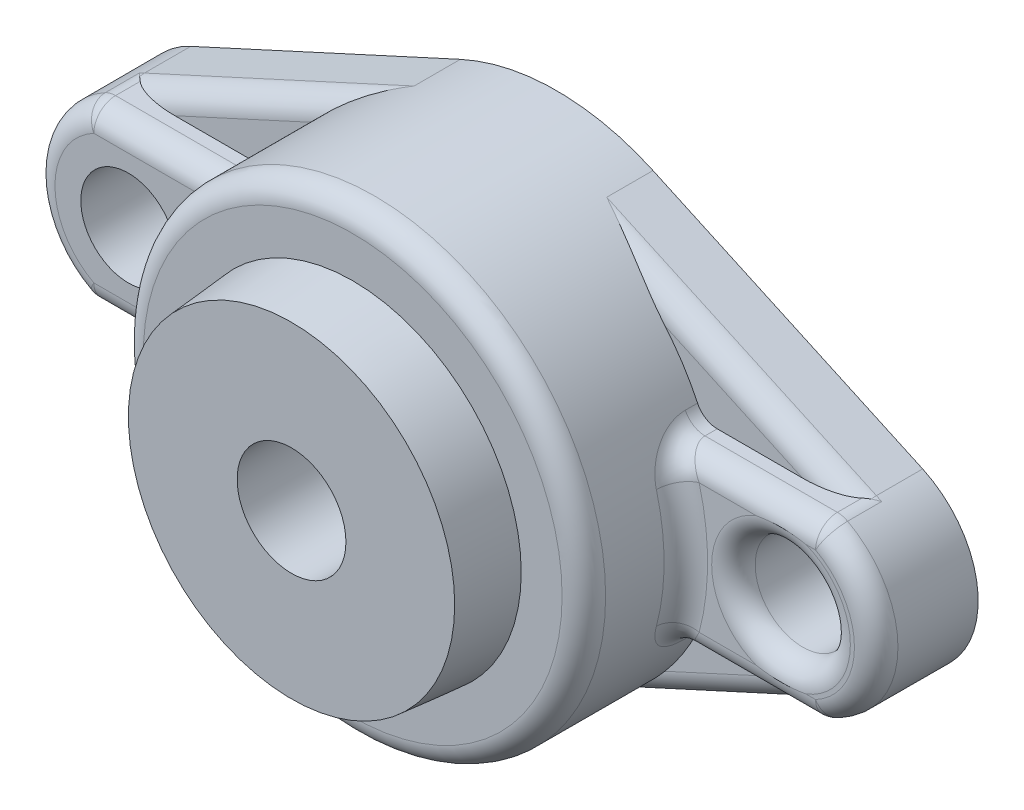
ISO-10303-21;
HEADER;
FILE_DESCRIPTION(('STEP AP214'),'2;1');
FILE_NAME('part.step','',(''),(''),'','','');
FILE_SCHEMA(('AUTOMOTIVE_DESIGN { 1 0 10303 214 1 1 1 1 }'));
ENDSEC;
DATA;
#1=APPLICATION_CONTEXT('core data for automotive mechanical design processes');
#2=APPLICATION_PROTOCOL_DEFINITION('international standard','automotive_design',2000,#1);
#3=PRODUCT_CONTEXT('',#1,'mechanical');
#4=PRODUCT('Part','Part','',(#3));
#5=PRODUCT_RELATED_PRODUCT_CATEGORY('part','',(#4));
#6=PRODUCT_DEFINITION_FORMATION('','',#4);
#7=PRODUCT_DEFINITION_CONTEXT('part definition',#1,'design');
#8=PRODUCT_DEFINITION('design','',#6,#7);
#9=PRODUCT_DEFINITION_SHAPE('','',#8);
#10=(LENGTH_UNIT() NAMED_UNIT(*) SI_UNIT(.MILLI.,.METRE.));
#11=(NAMED_UNIT(*) PLANE_ANGLE_UNIT() SI_UNIT($,.RADIAN.));
#12=(NAMED_UNIT(*) SI_UNIT($,.STERADIAN.) SOLID_ANGLE_UNIT());
#13=UNCERTAINTY_MEASURE_WITH_UNIT(LENGTH_MEASURE(1.E-05),#10,'distance_accuracy_value','');
#14=(GEOMETRIC_REPRESENTATION_CONTEXT(3) GLOBAL_UNCERTAINTY_ASSIGNED_CONTEXT((#13)) GLOBAL_UNIT_ASSIGNED_CONTEXT((#10,
#11,#12)) REPRESENTATION_CONTEXT('',''));
#15=CARTESIAN_POINT('',(0.,0.,0.));
#16=DIRECTION('',(0.,0.,1.));
#17=DIRECTION('',(1.,0.,0.));
#18=AXIS2_PLACEMENT_3D('',#15,#16,#17);
#19=CARTESIAN_POINT('',(0.,0.,11.90625));
#20=DIRECTION('',(0.,0.,1.));
#21=DIRECTION('',(1.,0.,0.));
#22=AXIS2_PLACEMENT_3D('',#19,#20,#21);
#23=PLANE('',#22);
#24=DIRECTION('',(-1.,0.,0.));
#25=VECTOR('',#24,1.);
#26=CARTESIAN_POINT('',(0.,-7.56192194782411,11.90625));
#27=LINE('',#26,#25);
#28=CARTESIAN_POINT('',(28.5427853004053,-7.56192194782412,11.90625));
#29=VERTEX_POINT('',#28);
#30=CARTESIAN_POINT('',(35.2074923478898,-7.56192194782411,11.90625));
#31=VERTEX_POINT('',#30);
#32=EDGE_CURVE('E745',#29,#31,#27,.F.);
#33=ORIENTED_EDGE('',*,*,#32,.T.);
#34=CARTESIAN_POINT('',(38.1,0.,11.90625));
#35=DIRECTION('',(0.,0.,1.));
#36=DIRECTION('',(1.,0.,0.));
#37=AXIS2_PLACEMENT_3D('',#34,#35,#36);
#38=CIRCLE('',#37,8.09625);
#39=CARTESIAN_POINT('',(35.2074923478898,7.5619219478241,11.90625));
#40=VERTEX_POINT('',#39);
#41=EDGE_CURVE('E747',#31,#40,#38,.F.);
#42=ORIENTED_EDGE('',*,*,#41,.T.);
#43=DIRECTION('',(-1.,0.,0.));
#44=VECTOR('',#43,1.);
#45=CARTESIAN_POINT('',(25.0255135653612,7.5619219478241,11.90625));
#46=LINE('',#45,#44);
#47=CARTESIAN_POINT('',(28.5427853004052,7.5619219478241,11.90625));
#48=VERTEX_POINT('',#47);
#49=EDGE_CURVE('E728',#40,#48,#46,.T.);
#50=ORIENTED_EDGE('',*,*,#49,.T.);
#51=CARTESIAN_POINT('',(0.,-3.05311331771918E-13,11.90625));
#52=DIRECTION('',(0.,0.,1.));
#53=DIRECTION('',(1.,0.,0.));
#54=AXIS2_PLACEMENT_3D('',#51,#52,#53);
#55=CIRCLE('',#54,29.5275000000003);
#56=EDGE_CURVE('E739',#48,#29,#55,.F.);
#57=ORIENTED_EDGE('',*,*,#56,.T.);
#58=EDGE_LOOP('',(#33,#42,#50,#57));
#59=FACE_BOUND('',#58,.T.);
#60=ADVANCED_FACE('F36',(#59),#23,.T.);
#61=CARTESIAN_POINT('',(-38.1,0.,7.9375));
#62=DIRECTION('',(0.,0.,1.));
#63=DIRECTION('',(1.,0.,0.));
#64=AXIS2_PLACEMENT_3D('',#61,#62,#63);
#65=PLANE('',#64);
#66=DIRECTION('',(1.,0.,0.));
#67=VECTOR('',#66,1.);
#68=CARTESIAN_POINT('',(0.,-10.1019219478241,7.9375));
#69=LINE('',#68,#67);
#70=CARTESIAN_POINT('',(-36.6342083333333,-10.1019219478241,7.9375));
#71=VERTEX_POINT('',#70);
#72=CARTESIAN_POINT('',(-26.684359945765,-10.1019219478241,7.9375));
#73=VERTEX_POINT('',#72);
#74=EDGE_CURVE('E1061',#71,#73,#69,.T.);
#75=ORIENTED_EDGE('',*,*,#74,.F.);
#76=DIRECTION('',(0.90905934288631,-0.416666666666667,0.));
#77=VECTOR('',#76,1.);
#78=CARTESIAN_POINT('',(-10.1864583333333,-22.2242282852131,7.9375));
#79=LINE('',#78,#77);
#80=CARTESIAN_POINT('',(-20.5770066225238,-17.4617282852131,7.9375));
#81=VERTEX_POINT('',#80);
#82=EDGE_CURVE('E670',#71,#81,#79,.T.);
#83=ORIENTED_EDGE('',*,*,#82,.T.);
#84=CARTESIAN_POINT('',(0.,0.,7.9375));
#85=DIRECTION('',(0.,0.,1.));
#86=DIRECTION('',(1.,0.,0.));
#87=AXIS2_PLACEMENT_3D('',#84,#85,#86);
#88=CIRCLE('',#87,26.9875);
#89=CARTESIAN_POINT('',(-24.3889311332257,-11.5544447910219,7.9375));
#90=VERTEX_POINT('',#89);
#91=EDGE_CURVE('E1048',#81,#90,#88,.F.);
#92=ORIENTED_EDGE('',*,*,#91,.T.);
#93=CARTESIAN_POINT('',(-26.684359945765,-12.6419219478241,7.9375));
#94=DIRECTION('',(0.,0.,1.));
#95=DIRECTION('',(1.,0.,0.));
#96=AXIS2_PLACEMENT_3D('',#93,#94,#95);
#97=CIRCLE('',#96,2.54);
#98=EDGE_CURVE('E1005',#90,#73,#97,.T.);
#99=ORIENTED_EDGE('',*,*,#98,.T.);
#100=EDGE_LOOP('',(#75,#83,#92,#99));
#101=FACE_BOUND('',#100,.T.);
#102=ADVANCED_FACE('F397',(#101),#65,.T.);
#103=CARTESIAN_POINT('',(0.,-3.05311331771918E-13,7.9375));
#104=DIRECTION('',(0.,0.,-1.));
#105=DIRECTION('',(-1.,0.,0.));
#106=AXIS2_PLACEMENT_3D('',#103,#104,#105);
#107=CYLINDRICAL_SURFACE('',#106,26.9875000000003);
#108=CARTESIAN_POINT('',(0.,-3.05311331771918E-13,21.2725));
#109=DIRECTION('',(0.,0.,1.));
#110=DIRECTION('',(1.,0.,0.));
#111=AXIS2_PLACEMENT_3D('',#108,#109,#110);
#112=CIRCLE('',#111,26.9875000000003);
#113=CARTESIAN_POINT('',(26.9875000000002,-3.05311331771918E-13,21.2725));
#114=VERTEX_POINT('',#113);
#115=EDGE_CURVE('E640',#114,#114,#112,.F.);
#116=ORIENTED_EDGE('',*,*,#115,.T.);
#117=EDGE_LOOP('',(#116));
#118=FACE_BOUND('',#117,.T.);
#119=CARTESIAN_POINT('',(-24.3889311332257,11.5544447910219,7.9375));
#120=VERTEX_POINT('',#119);
#121=CARTESIAN_POINT('',(-20.5770066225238,17.4617282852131,7.9375));
#122=VERTEX_POINT('',#121);
#123=EDGE_CURVE('E1047',#120,#122,#88,.F.);
#124=ORIENTED_EDGE('',*,*,#123,.F.);
#125=DIRECTION('',(0.,0.,-1.));
#126=VECTOR('',#125,1.);
#127=CARTESIAN_POINT('',(-24.3889311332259,11.554444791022,7.9375));
#128=LINE('',#127,#126);
#129=CARTESIAN_POINT('',(-24.3889311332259,11.554444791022,9.36625));
#130=VERTEX_POINT('',#129);
#131=EDGE_CURVE('E1001',#120,#130,#128,.F.);
#132=ORIENTED_EDGE('',*,*,#131,.T.);
#133=CARTESIAN_POINT('',(-24.4906085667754,11.3373386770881,7.83100488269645));
#134=CARTESIAN_POINT('',(-25.1497113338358,9.91356292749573,8.37912961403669));
#135=CARTESIAN_POINT('',(-26.7956070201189,9.98315213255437,8.59862744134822));
#136=CARTESIAN_POINT('',(-24.4740737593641,11.3730458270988,7.95417969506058));
#137=CARTESIAN_POINT('',(-25.1380259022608,9.94423796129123,8.45643107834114));
#138=CARTESIAN_POINT('',(-26.777515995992,10.0026860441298,8.66021484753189));
#139=CARTESIAN_POINT('',(-24.4594175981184,11.4045112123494,8.07913660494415));
#140=CARTESIAN_POINT('',(-25.1275970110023,9.97144141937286,8.53569122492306));
#141=CARTESIAN_POINT('',(-26.761480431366,10.0198994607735,8.72269330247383));
#142=CARTESIAN_POINT('',(-24.4340798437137,11.4587023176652,8.33178355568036));
#143=CARTESIAN_POINT('',(-25.1095221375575,10.0183966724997,8.69689878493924));
#144=CARTESIAN_POINT('',(-26.7337579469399,10.0495451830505,8.84901677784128));
#145=CARTESIAN_POINT('',(-24.4233986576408,11.4814271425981,8.45947387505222));
#146=CARTESIAN_POINT('',(-25.1018626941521,10.0381839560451,8.77890203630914));
#147=CARTESIAN_POINT('',(-26.7220714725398,10.0619769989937,8.9128619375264));
#148=CARTESIAN_POINT('',(-24.4062434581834,11.5178484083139,8.71655338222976));
#149=CARTESIAN_POINT('',(-25.0895496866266,10.0699196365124,8.9446261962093));
#150=CARTESIAN_POINT('',(-26.7033016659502,10.0819015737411,9.04140169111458));
#151=CARTESIAN_POINT('',(-24.3997636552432,11.5315572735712,8.84593998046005));
#152=CARTESIAN_POINT('',(-25.0848821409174,10.0819043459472,9.02840797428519));
#153=CARTESIAN_POINT('',(-26.6962119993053,10.0894011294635,9.10609499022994));
#154=CARTESIAN_POINT('',(-24.3911045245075,11.5498596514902,9.10561089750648));
#155=CARTESIAN_POINT('',(-25.0786440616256,10.097905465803,9.1968279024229));
#156=CARTESIAN_POINT('',(-26.6867378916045,10.0994136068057,9.23593044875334));
#157=CARTESIAN_POINT('',(-24.3889249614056,11.5544536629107,9.23589516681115));
#158=CARTESIAN_POINT('',(-25.0770682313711,10.1019354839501,9.28153454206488));
#159=CARTESIAN_POINT('',(-26.684353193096,10.1019268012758,9.30107258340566));
#160=CARTESIAN_POINT('',(-24.3889438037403,11.5544265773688,9.63386356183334));
#161=CARTESIAN_POINT('',(-25.0770890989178,10.1018941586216,9.54016793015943));
#162=CARTESIAN_POINT('',(-26.6843738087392,10.1019119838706,9.5000567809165));
#163=CARTESIAN_POINT('',(-24.3981685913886,11.5350088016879,9.90177452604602));
#164=CARTESIAN_POINT('',(-25.0837780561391,10.0848126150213,9.7145783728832));
#165=CARTESIAN_POINT('',(-26.6944668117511,10.0912893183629,9.63401226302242));
#166=CARTESIAN_POINT('',(-24.4343189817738,11.4582246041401,10.4292590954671));
#167=CARTESIAN_POINT('',(-25.109711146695,10.0179371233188,10.0544548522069));
#168=CARTESIAN_POINT('',(-26.7340195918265,10.0492838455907,9.89775454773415));
#169=CARTESIAN_POINT('',(-24.4612412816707,11.4008652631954,10.6888342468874));
#170=CARTESIAN_POINT('',(-25.1290409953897,9.96792102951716,10.2204725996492));
#171=CARTESIAN_POINT('',(-26.7634757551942,10.0179049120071,10.0275421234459));
#172=CARTESIAN_POINT('',(-24.5305681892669,11.2509167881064,11.1920781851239));
#173=CARTESIAN_POINT('',(-25.1780372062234,9.83908978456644,10.5362767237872));
#174=CARTESIAN_POINT('',(-26.8393275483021,9.93587427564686,10.2791640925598));
#175=CARTESIAN_POINT('',(-24.5729332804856,11.1584175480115,11.4357857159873));
#176=CARTESIAN_POINT('',(-25.2078229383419,9.75995394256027,10.6864838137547));
#177=CARTESIAN_POINT('',(-26.8856799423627,9.88527175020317,10.4010178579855));
#178=CARTESIAN_POINT('',(-24.670249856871,10.9415720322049,11.9023459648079));
#179=CARTESIAN_POINT('',(-25.2748942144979,9.577949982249,10.9659029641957));
#180=CARTESIAN_POINT('',(-26.9921557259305,9.7666444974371,10.6342979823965));
#181=CARTESIAN_POINT('',(-24.7252074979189,10.817210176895,12.1251884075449));
#182=CARTESIAN_POINT('',(-25.3123427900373,9.47460488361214,11.0952599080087));
#183=CARTESIAN_POINT('',(-27.0522858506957,9.69861124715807,10.7457192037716));
#184=CARTESIAN_POINT('',(-24.8473671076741,10.533680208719,12.5558521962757));
#185=CARTESIAN_POINT('',(-25.3936278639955,9.24450578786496,11.3351955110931));
#186=CARTESIAN_POINT('',(-27.1859428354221,9.5435036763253,10.9610510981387));
#187=CARTESIAN_POINT('',(-24.9150367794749,10.3731062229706,12.7624041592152));
#188=CARTESIAN_POINT('',(-25.4378127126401,9.11642495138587,11.4443947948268));
#189=CARTESIAN_POINT('',(-27.259981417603,9.45566026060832,11.0643270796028));
#190=CARTESIAN_POINT('',(-25.0568997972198,10.025574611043,13.1437774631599));
#191=CARTESIAN_POINT('',(-25.5277550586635,8.84773810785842,11.6336105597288));
#192=CARTESIAN_POINT('',(-27.4151962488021,9.26554002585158,11.2550137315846));
#193=CARTESIAN_POINT('',(-25.1310948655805,9.83861001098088,13.3185903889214));
#194=CARTESIAN_POINT('',(-25.573601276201,8.70674766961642,11.7133180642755));
#195=CARTESIAN_POINT('',(-27.4963743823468,9.16325939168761,11.3424201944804));
#196=CARTESIAN_POINT('',(-25.2888287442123,9.42618233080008,13.646449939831));
#197=CARTESIAN_POINT('',(-25.6680010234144,8.40709484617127,11.8486484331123));
#198=CARTESIAN_POINT('',(-27.6689538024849,8.93763719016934,11.5063499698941));
#199=CARTESIAN_POINT('',(-25.3726314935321,9.19881072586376,13.7964778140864));
#200=CARTESIAN_POINT('',(-25.7164073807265,8.2479307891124,11.9010757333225));
#201=CARTESIAN_POINT('',(-27.7606438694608,8.81325154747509,11.5813639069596));
#202=CARTESIAN_POINT('',(-25.5398121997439,8.72390397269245,14.0521598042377));
#203=CARTESIAN_POINT('',(-25.8095589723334,7.93149953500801,11.9729423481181));
#204=CARTESIAN_POINT('',(-27.9435592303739,8.55344961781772,11.7092049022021));
#205=CARTESIAN_POINT('',(-25.6231900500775,8.47636400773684,14.1578032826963));
#206=CARTESIAN_POINT('',(-25.8542197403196,7.77432130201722,11.9917499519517));
#207=CARTESIAN_POINT('',(-28.0347844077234,8.41803069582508,11.7620266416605));
#208=CARTESIAN_POINT('',(-25.7887023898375,7.95890342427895,14.3243619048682));
#209=CARTESIAN_POINT('',(-25.9402504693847,7.46381071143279,12.00030425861));
#210=CARTESIAN_POINT('',(-28.2158743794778,8.13494931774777,11.8453059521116));
#211=CARTESIAN_POINT('',(-25.870706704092,7.68851531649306,14.3836986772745));
#212=CARTESIAN_POINT('',(-25.9812804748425,7.31127997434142,11.9884953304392));
#213=CARTESIAN_POINT('',(-28.3055967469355,7.98703111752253,11.8749743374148));
#214=CARTESIAN_POINT('',(-26.0273615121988,7.1402115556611,14.4490210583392));
#215=CARTESIAN_POINT('',(-26.0585958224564,7.02097650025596,11.9396469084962));
#216=CARTESIAN_POINT('',(-28.4769955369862,7.68707670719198,11.9076355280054));
#217=CARTESIAN_POINT('',(-26.1020152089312,6.86229924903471,14.4550300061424));
#218=CARTESIAN_POINT('',(-26.0946993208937,6.8838356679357,11.9022525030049));
#219=CARTESIAN_POINT('',(-28.5586754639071,7.53504232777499,11.9106400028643));
#220=CARTESIAN_POINT('',(-26.2056902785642,6.45031171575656,14.4233088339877));
#221=CARTESIAN_POINT('',(-26.1455408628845,6.69307401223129,11.8329111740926));
#222=CARTESIAN_POINT('',(-28.6721081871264,7.30966091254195,11.8947794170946));
#223=CARTESIAN_POINT('',(-26.2384713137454,6.31560048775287,14.4064393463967));
#224=CARTESIAN_POINT('',(-26.1617950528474,6.63249329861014,11.8078730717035));
#225=CARTESIAN_POINT('',(-28.707974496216,7.23596594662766,11.8863446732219));
#226=CARTESIAN_POINT('',(-26.3015668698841,6.04744981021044,14.3597296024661));
#227=CARTESIAN_POINT('',(-26.1936295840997,6.51517525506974,11.7539029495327));
#228=CARTESIAN_POINT('',(-28.7770084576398,7.0892717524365,11.8629898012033));
#229=CARTESIAN_POINT('',(-26.3318815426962,5.91401028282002,14.3298901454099));
#230=CARTESIAN_POINT('',(-26.2091915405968,6.45851387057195,11.7249717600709));
#231=CARTESIAN_POINT('',(-28.8101762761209,7.01627248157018,11.8480700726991));
#232=CARTESIAN_POINT('',(-26.3899642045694,5.64919022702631,14.2572090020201));
#233=CARTESIAN_POINT('',(-26.2398271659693,6.34870562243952,11.6636739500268));
#234=CARTESIAN_POINT('',(-28.8737255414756,6.87140033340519,11.8117295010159));
#235=CARTESIAN_POINT('',(-26.417725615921,5.5178157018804,14.2143348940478));
#236=CARTESIAN_POINT('',(-26.2548819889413,6.29563997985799,11.631310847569));
#237=CARTESIAN_POINT('',(-28.9040997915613,6.79953074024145,11.7902924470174));
#238=CARTESIAN_POINT('',(-26.4705626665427,5.25852818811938,14.1158213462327));
#239=CARTESIAN_POINT('',(-26.2845658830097,6.19283943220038,11.5635073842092));
#240=CARTESIAN_POINT('',(-28.9619097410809,6.65768521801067,11.7410356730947));
#241=CARTESIAN_POINT('',(-26.4956375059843,5.13061623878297,14.0601781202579));
#242=CARTESIAN_POINT('',(-26.2991788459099,6.14316884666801,11.5280851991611));
#243=CARTESIAN_POINT('',(-28.9893445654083,6.58770985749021,11.7132140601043));
#244=CARTESIAN_POINT('',(-26.5193341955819,5.00500450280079,13.9982685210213));
#245=CARTESIAN_POINT('',(-26.3136056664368,6.09507017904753,11.4913613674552));
#246=CARTESIAN_POINT('',(-29.0152715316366,6.51899284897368,11.6822592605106));
#247=(BOUNDED_SURFACE() B_SPLINE_SURFACE(3,2,((#133,#134,#135),(#136,#137,#138),(#139,#140,
#141),(#142,#143,#144),(#145,#146,#147),(#148,#149,#150),(#151,#152,#153),(#154,#155,#156),
(#157,#158,#159),(#160,#161,#162),(#163,#164,#165),(#166,#167,#168),(#169,#170,#171),(#172,#173,
#174),(#175,#176,#177),(#178,#179,#180),(#181,#182,#183),(#184,#185,#186),(#187,#188,#189),
(#190,#191,#192),(#193,#194,#195),(#196,#197,#198),(#199,#200,#201),(#202,#203,#204),(#205,#206,
#207),(#208,#209,#210),(#211,#212,#213),(#214,#215,#216),(#217,#218,#219),(#220,#221,#222),
(#223,#224,#225),(#226,#227,#228),(#229,#230,#231),(#232,#233,#234),(#235,#236,#237),(#238,#239,
#240),(#241,#242,#243),(#244,#245,#246)),.UNSPECIFIED.,.F.,.F.,
.F.) B_SPLINE_SURFACE_WITH_KNOTS((4,2,2,2,2,2,2,2,2,2,2,2,2,2,2,2,2,2,4),(3,3),(0.,
0.391346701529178,0.782733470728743,1.17357975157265,1.56440464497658,2.36675342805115,
3.16895251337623,3.96911310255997,4.76966568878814,5.60940851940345,6.4493736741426,
7.35918589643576,8.26921604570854,9.20905336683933,10.1484793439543,10.605883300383,
11.0632590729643,11.5217819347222,11.9804409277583),(0.,1.),
.UNSPECIFIED.) GEOMETRIC_REPRESENTATION_ITEM() RATIONAL_B_SPLINE_SURFACE(((1.,0.836795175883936,
1.),(1.,0.838137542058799,1.),(1.,0.83932569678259,1.),(1.,0.841377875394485,1.),(1.,
0.842241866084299,1.),(1.,0.843628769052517,1.),(1.,0.844152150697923,1.),(1.,0.844851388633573,
1.),(1.,0.845027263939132,1.),(1.,0.845025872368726,1.),(1.,0.844281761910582,1.),(1.,
0.841358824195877,1.),(1.,0.839180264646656,1.),(1.,0.833549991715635,1.),(1.,0.830101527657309,
1.),(1.,0.822147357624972,1.),(1.,0.817641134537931,1.),(1.,0.807586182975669,1.),(1.,
0.801997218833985,1.),(1.,0.790250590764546,1.),(1.,0.784092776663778,1.),(1.,0.771006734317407,
1.),(1.,0.764057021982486,1.),(1.,0.750277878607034,1.),(1.,0.743448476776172,1.),(1.,
0.730093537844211,1.),(1.,0.723585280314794,1.),(1.,0.711516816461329,1.),(1.,0.705956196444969,
1.),(1.,0.698615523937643,1.),(1.,0.696359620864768,1.),(1.,0.692158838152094,1.),(1.,
0.690213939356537,1.),(1.,0.686643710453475,1.),(1.,0.685019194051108,1.),(1.,0.682093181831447,
1.),(1.,0.680791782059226,1.),(1.,0.679651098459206,1.))) REPRESENTATION_ITEM('') SURFACE());
#248=CARTESIAN_POINT('',(-26.5193341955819,5.00500450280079,13.9982685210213));
#249=CARTESIAN_POINT('',(-26.4956375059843,5.13061623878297,14.0601781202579));
#250=CARTESIAN_POINT('',(-26.4705626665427,5.25852818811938,14.1158213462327));
#251=CARTESIAN_POINT('',(-26.417725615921,5.5178157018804,14.2143348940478));
#252=CARTESIAN_POINT('',(-26.3899642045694,5.64919022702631,14.2572090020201));
#253=CARTESIAN_POINT('',(-26.3318815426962,5.91401028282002,14.3298901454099));
#254=CARTESIAN_POINT('',(-26.3015668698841,6.04744981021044,14.3597296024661));
#255=CARTESIAN_POINT('',(-26.2384713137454,6.31560048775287,14.4064393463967));
#256=CARTESIAN_POINT('',(-26.2056902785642,6.45031171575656,14.4233088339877));
#257=CARTESIAN_POINT('',(-26.1020152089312,6.86229924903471,14.4550300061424));
#258=CARTESIAN_POINT('',(-26.0273615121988,7.1402115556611,14.4490210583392));
#259=CARTESIAN_POINT('',(-25.870706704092,7.68851531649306,14.3836986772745));
#260=CARTESIAN_POINT('',(-25.7887023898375,7.95890342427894,14.3243619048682));
#261=CARTESIAN_POINT('',(-25.6231900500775,8.47636400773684,14.1578032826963));
#262=CARTESIAN_POINT('',(-25.5398121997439,8.72390397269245,14.0521598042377));
#263=CARTESIAN_POINT('',(-25.3726314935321,9.19881072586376,13.7964778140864));
#264=CARTESIAN_POINT('',(-25.2888287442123,9.42618233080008,13.646449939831));
#265=CARTESIAN_POINT('',(-25.1310948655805,9.83861001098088,13.3185903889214));
#266=CARTESIAN_POINT('',(-25.0568997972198,10.025574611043,13.1437774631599));
#267=CARTESIAN_POINT('',(-24.9150367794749,10.3731062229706,12.7624041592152));
#268=CARTESIAN_POINT('',(-24.8473671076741,10.533680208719,12.5558521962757));
#269=CARTESIAN_POINT('',(-24.7252074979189,10.817210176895,12.1251884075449));
#270=CARTESIAN_POINT('',(-24.670249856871,10.9415720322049,11.9023459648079));
#271=CARTESIAN_POINT('',(-24.5729332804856,11.1584175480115,11.4357857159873));
#272=CARTESIAN_POINT('',(-24.5305681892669,11.2509167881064,11.1920781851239));
#273=CARTESIAN_POINT('',(-24.4612412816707,11.4008652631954,10.6888342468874));
#274=CARTESIAN_POINT('',(-24.4343189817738,11.4582246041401,10.4292590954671));
#275=CARTESIAN_POINT('',(-24.3981685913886,11.5350088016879,9.90177452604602));
#276=CARTESIAN_POINT('',(-24.3889438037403,11.5544265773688,9.63386356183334));
#277=CARTESIAN_POINT('',(-24.3889249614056,11.5544536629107,9.23589516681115));
#278=CARTESIAN_POINT('',(-24.3911045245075,11.5498596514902,9.10561089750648));
#279=CARTESIAN_POINT('',(-24.3997636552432,11.5315572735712,8.84593998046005));
#280=CARTESIAN_POINT('',(-24.4062434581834,11.5178484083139,8.71655338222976));
#281=CARTESIAN_POINT('',(-24.4233986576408,11.4814271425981,8.45947387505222));
#282=CARTESIAN_POINT('',(-24.4340798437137,11.4587023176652,8.33178355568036));
#283=CARTESIAN_POINT('',(-24.4594175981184,11.4045112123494,8.07913660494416));
#284=CARTESIAN_POINT('',(-24.4740737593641,11.3730458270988,7.95417969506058));
#285=CARTESIAN_POINT('',(-24.4906085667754,11.3373386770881,7.83100488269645));
#286=B_SPLINE_CURVE_WITH_KNOTS('',3,(#248,#249,#250,#251,#252,#253,#254,#255,#256,#257,#258,
#259,#260,#261,#262,#263,#264,#265,#266,#267,#268,#269,#270,#271,#272,#273,#274,#275,#276,#277,
#278,#279,#280,#281,#282,#283,#284,#285),.UNSPECIFIED.,.F.,.F.,(4,2,2,2,2,2,2,2,2,2,2,2,2,2,2,2,
2,2,4),(0.,0.458658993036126,0.917181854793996,1.37455762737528,1.83196158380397,
2.77138756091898,3.71122488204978,4.62125503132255,5.53106725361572,6.37103240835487,
7.21077523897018,8.01132782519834,8.81148841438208,9.61368749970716,10.4160362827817,
10.8068611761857,11.1977074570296,11.5890942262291,11.9804409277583),.UNSPECIFIED.);
#287=CARTESIAN_POINT('',(-26.0874919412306,6.91143403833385,14.44625));
#288=VERTEX_POINT('',#287);
#289=EDGE_CURVE('E451',#288,#130,#286,.T.);
#290=ORIENTED_EDGE('',*,*,#289,.F.);
#291=CARTESIAN_POINT('',(0.,-3.05311331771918E-13,14.44625));
#292=DIRECTION('',(0.,0.,1.));
#293=DIRECTION('',(1.,0.,0.));
#294=AXIS2_PLACEMENT_3D('',#291,#292,#293);
#295=CIRCLE('',#294,26.9875000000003);
#296=CARTESIAN_POINT('',(-26.0874919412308,-6.91143403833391,14.44625));
#297=VERTEX_POINT('',#296);
#298=EDGE_CURVE('E990',#288,#297,#295,.T.);
#299=ORIENTED_EDGE('',*,*,#298,.T.);
#300=CARTESIAN_POINT('',(-26.4501691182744,-5.35851750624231,14.1536866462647));
#301=CARTESIAN_POINT('',(-26.2730874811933,-6.2326098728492,11.5896948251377));
#302=CARTESIAN_POINT('',(-28.9395967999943,-6.71238525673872,11.7599683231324));
#303=CARTESIAN_POINT('',(-26.4247533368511,-5.48401918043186,14.202436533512));
#304=CARTESIAN_POINT('',(-26.2587404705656,-6.2821121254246,11.6226943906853));
#305=CARTESIAN_POINT('',(-28.9117889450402,-6.78104205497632,11.7843432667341));
#306=CARTESIAN_POINT('',(-26.3980489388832,-5.61119929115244,14.2451525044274));
#307=CARTESIAN_POINT('',(-26.2441839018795,-6.33328899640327,11.6544008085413));
#308=CARTESIAN_POINT('',(-28.88257119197,-6.85061705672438,11.8057012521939));
#309=CARTESIAN_POINT('',(-26.3421749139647,-5.86788660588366,14.3183997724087));
#310=CARTESIAN_POINT('',(-26.2145495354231,-6.43916876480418,11.714650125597));
#311=CARTESIAN_POINT('',(-28.8214384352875,-6.99104011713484,11.8423248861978));
#312=CARTESIAN_POINT('',(-26.3130060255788,-5.99739310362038,14.3489347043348));
#313=CARTESIAN_POINT('',(-26.1994875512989,-6.49380648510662,11.7431828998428));
#314=CARTESIAN_POINT('',(-28.789524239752,-7.06188778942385,11.8575923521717));
#315=CARTESIAN_POINT('',(-26.2523640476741,-6.25750363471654,14.3976805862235));
#316=CARTESIAN_POINT('',(-26.1687408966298,-6.60675154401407,11.7966092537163));
#317=CARTESIAN_POINT('',(-28.7231747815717,-7.20418355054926,11.8819652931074));
#318=CARTESIAN_POINT('',(-26.2208959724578,-6.38810476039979,14.4159175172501));
#319=CARTESIAN_POINT('',(-26.1530746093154,-6.66498053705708,11.8215078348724));
#320=CARTESIAN_POINT('',(-28.6887450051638,-7.27563004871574,11.8910837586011));
#321=CARTESIAN_POINT('',(-26.1557855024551,-6.64968119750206,14.4402066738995));
#322=CARTESIAN_POINT('',(-26.1209416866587,-6.78527082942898,11.8671283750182));
#323=CARTESIAN_POINT('',(-28.6175064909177,-7.41872774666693,11.9032283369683));
#324=CARTESIAN_POINT('',(-26.1221429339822,-6.78065653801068,14.4462579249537));
#325=CARTESIAN_POINT('',(-26.1044927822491,-6.84726039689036,11.8878591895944));
#326=CARTESIAN_POINT('',(-28.5806975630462,-7.49037896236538,11.9062539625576));
#327=CARTESIAN_POINT('',(-26.0151626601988,-7.18441445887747,14.4462334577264));
#328=CARTESIAN_POINT('',(-26.0523972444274,-7.0439071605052,11.9442139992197));
#329=CARTESIAN_POINT('',(-28.4636485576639,-7.71125829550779,11.9062417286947));
#330=CARTESIAN_POINT('',(-25.9384395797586,-7.45653287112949,14.4198165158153));
#331=CARTESIAN_POINT('',(-26.015027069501,-7.18539831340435,11.9721307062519));
#332=CARTESIAN_POINT('',(-28.379704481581,-7.8601230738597,11.8930332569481));
#333=CARTESIAN_POINT('',(-25.7789354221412,-7.99059463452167,14.3160532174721));
#334=CARTESIAN_POINT('',(-25.9350865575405,-7.48226129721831,12.0002530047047));
#335=CARTESIAN_POINT('',(-28.2051881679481,-8.15228627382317,11.841151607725));
#336=CARTESIAN_POINT('',(-25.6961514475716,-8.25253302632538,14.2386823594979));
#337=CARTESIAN_POINT('',(-25.8926864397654,-7.63709089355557,12.000887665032));
#338=CARTESIAN_POINT('',(-28.1146127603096,-8.29558198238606,11.8024661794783));
#339=CARTESIAN_POINT('',(-25.527908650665,-8.75911863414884,14.0359948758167));
#340=CARTESIAN_POINT('',(-25.8030296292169,-7.95391817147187,11.9689423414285));
#341=CARTESIAN_POINT('',(-27.9305353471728,-8.57271410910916,11.7011224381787));
#342=CARTESIAN_POINT('',(-25.4424532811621,-9.00378693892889,13.9107379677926));
#343=CARTESIAN_POINT('',(-25.7559143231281,-8.11560893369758,11.9370198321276));
#344=CARTESIAN_POINT('',(-27.8370371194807,-8.70656206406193,11.6384939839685));
#345=CARTESIAN_POINT('',(-25.2726444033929,-9.4699644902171,13.6156014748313));
#346=CARTESIAN_POINT('',(-25.6585713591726,-8.43764329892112,11.8367530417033));
#347=CARTESIAN_POINT('',(-27.6512462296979,-8.9615886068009,11.4909257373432));
#348=CARTESIAN_POINT('',(-25.1882910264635,-9.69147099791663,13.445716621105));
#349=CARTESIAN_POINT('',(-25.6083941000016,-8.59802877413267,11.7690557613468));
#350=CARTESIAN_POINT('',(-27.5589537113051,-9.08276569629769,11.4059833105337));
#351=CARTESIAN_POINT('',(-25.0238913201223,-10.1084628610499,13.0623269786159));
#352=CARTESIAN_POINT('',(-25.5073772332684,-8.90994033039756,11.5953488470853));
#353=CARTESIAN_POINT('',(-27.37908109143,-9.31088477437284,11.214288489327));
#354=CARTESIAN_POINT('',(-24.943926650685,-10.3035172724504,12.8482170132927));
#355=CARTESIAN_POINT('',(-25.4564630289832,-9.06172651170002,11.4893124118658));
#356=CARTESIAN_POINT('',(-27.2915903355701,-9.41759101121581,11.1072335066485));
#357=CARTESIAN_POINT('',(-24.7947676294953,-10.6574683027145,12.3827775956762));
#358=CARTESIAN_POINT('',(-25.3591671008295,-9.34339083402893,11.2413068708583));
#359=CARTESIAN_POINT('',(-27.1283928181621,-9.61122304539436,10.8745137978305));
#360=CARTESIAN_POINT('',(-24.7255721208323,-10.8163688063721,12.1314521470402));
#361=CARTESIAN_POINT('',(-25.312605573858,-9.47392273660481,11.09959953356));
#362=CARTESIAN_POINT('',(-27.0526847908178,-9.69815096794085,10.7488510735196));
#363=CARTESIAN_POINT('',(-24.6060076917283,-11.0855921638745,11.6099814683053));
#364=CARTESIAN_POINT('',(-25.2309201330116,-9.69803381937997,10.7926699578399));
#365=CARTESIAN_POINT('',(-26.9218672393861,-9.84543198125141,10.4881157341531));
#366=CARTESIAN_POINT('',(-24.5549347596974,-11.1977709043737,11.3411820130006));
#367=CARTESIAN_POINT('',(-25.1951734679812,-9.79362546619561,10.6287337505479));
#368=CARTESIAN_POINT('',(-26.8659874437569,-9.90680035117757,10.3537160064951));
#369=CARTESIAN_POINT('',(-24.4718087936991,-11.3783014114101,10.783367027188));
#370=CARTESIAN_POINT('',(-25.1366267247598,-9.94824317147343,10.2807980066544));
#371=CARTESIAN_POINT('',(-26.7750378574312,-10.0055611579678,10.0748085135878));
#372=CARTESIAN_POINT('',(-24.4397331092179,-11.4467053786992,10.4943760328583));
#373=CARTESIAN_POINT('',(-25.1135993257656,-10.0078914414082,10.0963410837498));
#374=CARTESIAN_POINT('',(-26.7399432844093,-10.0429821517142,9.93031301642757));
#375=CARTESIAN_POINT('',(-24.3995035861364,-11.532189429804,9.93240423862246));
#376=CARTESIAN_POINT('',(-25.0847420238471,-10.0823428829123,9.73446669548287));
#377=CARTESIAN_POINT('',(-26.6959274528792,-10.0897469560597,9.64932711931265));
#378=CARTESIAN_POINT('',(-24.3894576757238,-11.5533322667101,9.66032120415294));
#379=CARTESIAN_POINT('',(-25.0774541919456,-10.1009499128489,9.55736701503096));
#380=CARTESIAN_POINT('',(-26.6849360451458,-10.1013133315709,9.51328560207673));
#381=CARTESIAN_POINT('',(-24.3884450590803,-11.5554718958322,9.11575727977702));
#382=CARTESIAN_POINT('',(-25.0767251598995,-10.1028191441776,9.20347146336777));
#383=CARTESIAN_POINT('',(-26.6838281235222,-10.1024838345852,9.24100363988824));
#384=CARTESIAN_POINT('',(-24.3974890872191,-11.5364461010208,8.84327625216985));
#385=CARTESIAN_POINT('',(-25.083289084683,-10.0860682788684,9.02603004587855));
#386=CARTESIAN_POINT('',(-26.693723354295,-10.0920756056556,9.10476312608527));
#387=CARTESIAN_POINT('',(-24.4330185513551,-11.4609920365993,8.31978087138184));
#388=CARTESIAN_POINT('',(-25.1087779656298,-10.0203481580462,8.68869770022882));
#389=CARTESIAN_POINT('',(-26.7325967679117,-10.0507977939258,8.84301543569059));
#390=CARTESIAN_POINT('',(-24.4586247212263,-11.406448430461,8.0683697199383));
#391=CARTESIAN_POINT('',(-25.1271620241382,-9.97278911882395,8.52783281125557));
#392=CARTESIAN_POINT('',(-26.7606129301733,-10.0209592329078,8.71730985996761));
#393=CARTESIAN_POINT('',(-24.5079852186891,-11.2997922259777,7.70202370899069));
#394=CARTESIAN_POINT('',(-25.1620213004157,-9.88123101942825,8.29793710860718));
#395=CARTESIAN_POINT('',(-26.8146191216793,-9.96261201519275,8.53413685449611));
#396=CARTESIAN_POINT('',(-24.5262693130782,-11.2600882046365,7.58167742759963));
#397=CARTESIAN_POINT('',(-25.1749101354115,-9.84719490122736,8.22294030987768));
#398=CARTESIAN_POINT('',(-26.8346240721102,-9.94089158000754,8.47396371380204));
#399=CARTESIAN_POINT('',(-24.5661715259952,-11.1727644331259,7.34518613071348));
#400=CARTESIAN_POINT('',(-25.2028368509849,-9.77284580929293,8.07715948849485));
#401=CARTESIAN_POINT('',(-26.8782817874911,-9.89312034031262,8.35571806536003));
#402=CARTESIAN_POINT('',(-24.5877888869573,-11.1251464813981,7.2290401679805));
#403=CARTESIAN_POINT('',(-25.2178920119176,-9.73248477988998,8.00634221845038));
#404=CARTESIAN_POINT('',(-26.9019337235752,-9.86707051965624,8.29764508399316));
#405=CARTESIAN_POINT('',(-24.6109185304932,-11.0737457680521,7.11526150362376));
#406=CARTESIAN_POINT('',(-25.233832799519,-9.68934588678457,7.93808345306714));
#407=CARTESIAN_POINT('',(-26.9272402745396,-9.83895130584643,8.24075575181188));
#408=(BOUNDED_SURFACE() B_SPLINE_SURFACE(3,2,((#300,#301,#302),(#303,#304,#305),(#306,#307,
#308),(#309,#310,#311),(#312,#313,#314),(#315,#316,#317),(#318,#319,#320),(#321,#322,#323),
(#324,#325,#326),(#327,#328,#329),(#330,#331,#332),(#333,#334,#335),(#336,#337,#338),(#339,#340,
#341),(#342,#343,#344),(#345,#346,#347),(#348,#349,#350),(#351,#352,#353),(#354,#355,#356),
(#357,#358,#359),(#360,#361,#362),(#363,#364,#365),(#366,#367,#368),(#369,#370,#371),(#372,#373,
#374),(#375,#376,#377),(#378,#379,#380),(#381,#382,#383),(#384,#385,#386),(#387,#388,#389),
(#390,#391,#392),(#393,#394,#395),(#396,#397,#398),(#399,#400,#401),(#402,#403,#404),(#405,#406,
#407)),.UNSPECIFIED.,.F.,.F.,.F.) B_SPLINE_SURFACE_WITH_KNOTS((4,2,2,2,2,2,2,2,2,2,2,2,2,2,2,2,
2,4),(3,3),(0.,0.444852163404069,0.889571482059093,1.33334830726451,1.77716062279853,
2.70355906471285,3.63040329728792,4.55609543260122,5.48189690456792,6.42132381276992,
7.36064973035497,8.25793411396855,9.15414649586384,9.96975315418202,10.7858185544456,
11.5617666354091,11.9499167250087,12.3379787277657),(0.,1.),
.UNSPECIFIED.) GEOMETRIC_REPRESENTATION_ITEM() RATIONAL_B_SPLINE_SURFACE(((1.,0.683224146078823,
1.),(1.,0.68461717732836,1.),(1.,0.686165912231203,1.),(1.,0.689567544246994,1.),(1.,
0.691420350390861,1.),(1.,0.695419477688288,1.),(1.,0.697565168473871,1.),(1.,0.702133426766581,
1.),(1.,0.704556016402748,1.),(1.,0.712431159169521,1.),(1.,0.718314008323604,1.),(1.,
0.730864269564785,1.),(1.,0.737532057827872,1.),(1.,0.75124622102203,1.),(1.,0.758292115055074,
1.),(1.,0.772343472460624,1.),(1.,0.779348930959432,1.),(1.,0.792985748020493,1.),(1.,
0.799610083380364,1.),(1.,0.811923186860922,1.),(1.,0.817612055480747,1.),(1.,0.827404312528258,
1.),(1.,0.831567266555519,1.),(1.,0.838324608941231,1.),(1.,0.840920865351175,1.),(1.,
0.844173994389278,1.),(1.,0.84498429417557,1.),(1.,0.845066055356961,1.),(1.,0.844336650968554,
1.),(1.,0.841464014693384,1.),(1.,0.839392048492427,1.),(1.,0.835384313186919,1.),(1.,
0.833897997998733,1.),(1.,0.830648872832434,1.),(1.,0.828886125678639,1.),(1.,0.82699656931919,1.))) REPRESENTATION_ITEM('') SURFACE());
#409=CARTESIAN_POINT('',(-24.6109185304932,-11.0737457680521,7.11526150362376));
#410=CARTESIAN_POINT('',(-24.5877888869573,-11.1251464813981,7.2290401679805));
#411=CARTESIAN_POINT('',(-24.5661715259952,-11.1727644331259,7.34518613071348));
#412=CARTESIAN_POINT('',(-24.5262693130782,-11.2600882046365,7.58167742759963));
#413=CARTESIAN_POINT('',(-24.5079852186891,-11.2997922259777,7.70202370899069));
#414=CARTESIAN_POINT('',(-24.4586247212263,-11.406448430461,8.0683697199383));
#415=CARTESIAN_POINT('',(-24.4330185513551,-11.4609920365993,8.31978087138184));
#416=CARTESIAN_POINT('',(-24.3974890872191,-11.5364461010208,8.84327625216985));
#417=CARTESIAN_POINT('',(-24.3884450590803,-11.5554718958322,9.11575727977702));
#418=CARTESIAN_POINT('',(-24.3894576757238,-11.5533322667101,9.66032120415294));
#419=CARTESIAN_POINT('',(-24.3995035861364,-11.532189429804,9.93240423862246));
#420=CARTESIAN_POINT('',(-24.4397331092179,-11.4467053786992,10.4943760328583));
#421=CARTESIAN_POINT('',(-24.4718087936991,-11.3783014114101,10.783367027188));
#422=CARTESIAN_POINT('',(-24.5549347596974,-11.1977709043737,11.3411820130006));
#423=CARTESIAN_POINT('',(-24.6060076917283,-11.0855921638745,11.6099814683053));
#424=CARTESIAN_POINT('',(-24.7255721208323,-10.8163688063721,12.1314521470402));
#425=CARTESIAN_POINT('',(-24.7947676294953,-10.6574683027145,12.3827775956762));
#426=CARTESIAN_POINT('',(-24.943926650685,-10.3035172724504,12.8482170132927));
#427=CARTESIAN_POINT('',(-25.0238913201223,-10.1084628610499,13.0623269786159));
#428=CARTESIAN_POINT('',(-25.1882910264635,-9.69147099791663,13.445716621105));
#429=CARTESIAN_POINT('',(-25.2726444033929,-9.4699644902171,13.6156014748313));
#430=CARTESIAN_POINT('',(-25.4424532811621,-9.00378693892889,13.9107379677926));
#431=CARTESIAN_POINT('',(-25.527908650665,-8.75911863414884,14.0359948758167));
#432=CARTESIAN_POINT('',(-25.6961514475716,-8.25253302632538,14.2386823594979));
#433=CARTESIAN_POINT('',(-25.7789354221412,-7.99059463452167,14.3160532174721));
#434=CARTESIAN_POINT('',(-25.9384395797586,-7.45653287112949,14.4198165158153));
#435=CARTESIAN_POINT('',(-26.0151626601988,-7.18441445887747,14.4462334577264));
#436=CARTESIAN_POINT('',(-26.1221429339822,-6.78065653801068,14.4462579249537));
#437=CARTESIAN_POINT('',(-26.155785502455,-6.64968119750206,14.4402066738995));
#438=CARTESIAN_POINT('',(-26.2208959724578,-6.38810476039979,14.4159175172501));
#439=CARTESIAN_POINT('',(-26.2523640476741,-6.25750363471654,14.3976805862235));
#440=CARTESIAN_POINT('',(-26.3130060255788,-5.99739310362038,14.3489347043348));
#441=CARTESIAN_POINT('',(-26.3421749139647,-5.86788660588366,14.3183997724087));
#442=CARTESIAN_POINT('',(-26.3980489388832,-5.61119929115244,14.2451525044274));
#443=CARTESIAN_POINT('',(-26.4247533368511,-5.48401918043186,14.202436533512));
#444=CARTESIAN_POINT('',(-26.4501691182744,-5.35851750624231,14.1536866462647));
#445=B_SPLINE_CURVE_WITH_KNOTS('',3,(#409,#410,#411,#412,#413,#414,#415,#416,#417,#418,#419,
#420,#421,#422,#423,#424,#425,#426,#427,#428,#429,#430,#431,#432,#433,#434,#435,#436,#437,#438,
#439,#440,#441,#442,#443,#444),.UNSPECIFIED.,.F.,.F.,(4,2,2,2,2,2,2,2,2,2,2,2,2,2,2,2,2,4),(0.,
0.388062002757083,0.776212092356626,1.55216017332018,2.36822557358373,3.1838322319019,
4.08004461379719,4.97732899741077,5.91665491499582,6.85608182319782,7.78188329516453,
8.70757543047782,9.6344196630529,10.5608181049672,11.0046304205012,11.4484072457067,
11.8931265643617,12.3379787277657),.UNSPECIFIED.);
#446=CARTESIAN_POINT('',(-24.3889311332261,-11.5544447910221,9.36625));
#447=VERTEX_POINT('',#446);
#448=EDGE_CURVE('E443',#447,#297,#445,.T.);
#449=ORIENTED_EDGE('',*,*,#448,.F.);
#450=DIRECTION('',(0.,0.,-1.));
#451=VECTOR('',#450,1.);
#452=CARTESIAN_POINT('',(-24.3889311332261,-11.5544447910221,7.9375));
#453=LINE('',#452,#451);
#454=EDGE_CURVE('E995',#447,#90,#453,.T.);
#455=ORIENTED_EDGE('',*,*,#454,.T.);
#456=ORIENTED_EDGE('',*,*,#91,.F.);
#457=CARTESIAN_POINT('',(-20.5770066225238,-17.4617282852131,7.9375));
#458=CARTESIAN_POINT('',(-20.4377221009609,-17.6258693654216,7.93745716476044));
#459=CARTESIAN_POINT('',(-20.2965017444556,-17.7882963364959,7.93259281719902));
#460=CARTESIAN_POINT('',(-20.0105181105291,-18.1094024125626,7.91439675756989));
#461=CARTESIAN_POINT('',(-19.8657563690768,-18.2680830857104,7.90106865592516));
#462=CARTESIAN_POINT('',(-19.5731783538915,-18.5812188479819,7.86715103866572));
#463=CARTESIAN_POINT('',(-19.4253684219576,-18.7356814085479,7.84657539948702));
#464=CARTESIAN_POINT('',(-19.1266187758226,-19.040566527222,7.79907181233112));
#465=CARTESIAN_POINT('',(-18.9756786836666,-19.1909885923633,7.77214309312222));
#466=CARTESIAN_POINT('',(-18.5196711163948,-19.6348251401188,7.68329166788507));
#467=CARTESIAN_POINT('',(-18.2101975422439,-19.9221128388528,7.61314862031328));
#468=CARTESIAN_POINT('',(-17.5804825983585,-20.4799643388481,7.45592450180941));
#469=CARTESIAN_POINT('',(-17.2602347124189,-20.7505177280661,7.36883302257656));
#470=CARTESIAN_POINT('',(-16.4959739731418,-21.3664660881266,7.14886095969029));
#471=CARTESIAN_POINT('',(-16.0478767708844,-21.7049093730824,7.01062335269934));
#472=CARTESIAN_POINT('',(-15.1352366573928,-22.3508968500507,6.7180179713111));
#473=CARTESIAN_POINT('',(-14.6706921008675,-22.6584379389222,6.563648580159));
#474=CARTESIAN_POINT('',(-13.2534499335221,-23.5351866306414,6.08529688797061));
#475=CARTESIAN_POINT('',(-12.2768298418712,-24.0587713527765,5.74597200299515));
#476=CARTESIAN_POINT('',(-11.2638252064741,-24.5245083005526,5.40392420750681));
#477=CARTESIAN_POINT('',(-11.2543096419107,-24.5288764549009,5.40071207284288));
#478=CARTESIAN_POINT('',(-11.2447916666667,-24.5332390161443,5.3975));
#479=B_SPLINE_CURVE_WITH_KNOTS('',3,(#457,#458,#459,#460,#461,#462,#463,#464,#465,#466,#467,
#468,#469,#470,#471,#472,#473,#474,#475,#476,#477,#478),.UNSPECIFIED.,.F.,.F.,(4,2,2,2,2,2,2,2,
2,2,4),(0.,0.645671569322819,1.29106789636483,1.93523517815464,2.57948069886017,
3.86261182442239,5.14653344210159,6.87986628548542,8.61337301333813,12.0791511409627,
12.1120068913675),.UNSPECIFIED.);
#480=CARTESIAN_POINT('',(-11.2447916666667,-24.5332390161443,5.3975));
#481=VERTEX_POINT('',#480);
#482=EDGE_CURVE('E468',#81,#481,#479,.T.);
#483=ORIENTED_EDGE('',*,*,#482,.T.);
#484=DIRECTION('',(0.,0.,-1.));
#485=VECTOR('',#484,1.);
#486=CARTESIAN_POINT('',(-11.2447916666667,-24.5332390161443,7.9375));
#487=LINE('',#486,#485);
#488=CARTESIAN_POINT('',(-11.2447916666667,-24.5332390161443,0.));
#489=VERTEX_POINT('',#488);
#490=EDGE_CURVE('E297',#481,#489,#487,.T.);
#491=ORIENTED_EDGE('',*,*,#490,.T.);
#492=CARTESIAN_POINT('',(0.,0.,0.));
#493=DIRECTION('',(0.,0.,1.));
#494=DIRECTION('',(1.,0.,0.));
#495=AXIS2_PLACEMENT_3D('',#492,#493,#494);
#496=CIRCLE('',#495,26.9875);
#497=CARTESIAN_POINT('',(11.2447916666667,-24.5332390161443,0.));
#498=VERTEX_POINT('',#497);
#499=EDGE_CURVE('E307',#489,#498,#496,.T.);
#500=ORIENTED_EDGE('',*,*,#499,.T.);
#501=DIRECTION('',(0.,0.,-1.));
#502=VECTOR('',#501,1.);
#503=CARTESIAN_POINT('',(11.2447916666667,-24.5332390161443,7.9375));
#504=LINE('',#503,#502);
#505=CARTESIAN_POINT('',(11.2447916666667,-24.5332390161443,5.3975));
#506=VERTEX_POINT('',#505);
#507=EDGE_CURVE('E345',#506,#498,#504,.T.);
#508=ORIENTED_EDGE('',*,*,#507,.F.);
#509=CARTESIAN_POINT('',(20.5770066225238,-17.4617282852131,7.9375));
#510=CARTESIAN_POINT('',(20.4377221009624,-17.6258693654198,7.93745716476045));
#511=CARTESIAN_POINT('',(20.2965017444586,-17.7882963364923,7.93259281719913));
#512=CARTESIAN_POINT('',(20.0105181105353,-18.1094024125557,7.91439675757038));
#513=CARTESIAN_POINT('',(19.8657563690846,-18.2680830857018,7.90106865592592));
#514=CARTESIAN_POINT('',(19.5731783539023,-18.5812188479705,7.86715103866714));
#515=CARTESIAN_POINT('',(19.4253684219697,-18.7356814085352,7.84657539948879));
#516=CARTESIAN_POINT('',(19.1266187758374,-19.0405665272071,7.79907181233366));
#517=CARTESIAN_POINT('',(18.9756786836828,-19.1909885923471,7.77214309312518));
#518=CARTESIAN_POINT('',(18.5196711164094,-19.634825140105,7.6832916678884));
#519=CARTESIAN_POINT('',(18.2101975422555,-19.9221128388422,7.6131486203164));
#520=CARTESIAN_POINT('',(17.5804825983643,-20.4799643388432,7.45592450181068));
#521=CARTESIAN_POINT('',(17.260234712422,-20.7505177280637,7.36883302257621));
#522=CARTESIAN_POINT('',(16.4959739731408,-21.3664660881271,7.14886095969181));
#523=CARTESIAN_POINT('',(16.0478767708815,-21.7049093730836,7.01062335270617));
#524=CARTESIAN_POINT('',(15.1352366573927,-22.3508968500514,6.71801797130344));
#525=CARTESIAN_POINT('',(14.6706921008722,-22.6584379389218,6.56364858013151));
#526=CARTESIAN_POINT('',(13.2534499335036,-23.535186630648,6.08529688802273));
#527=CARTESIAN_POINT('',(12.2768298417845,-24.0587713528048,5.74597200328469));
#528=CARTESIAN_POINT('',(11.2638252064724,-24.5245083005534,5.40392420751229));
#529=CARTESIAN_POINT('',(11.2543096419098,-24.5288764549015,5.40071207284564));
#530=CARTESIAN_POINT('',(11.2447916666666,-24.5332390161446,5.3975));
#531=B_SPLINE_CURVE_WITH_KNOTS('',3,(#509,#510,#511,#512,#513,#514,#515,#516,#517,#518,#519,
#520,#521,#522,#523,#524,#525,#526,#527,#528,#529,#530),.UNSPECIFIED.,.F.,.F.,(4,2,2,2,2,2,2,2,
2,2,4),(0.,0.645671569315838,1.29106789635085,1.93523517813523,2.57948069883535,
3.86261182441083,5.1465334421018,6.8798662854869,8.61337301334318,12.0791511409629,
12.1120068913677),.UNSPECIFIED.);
#532=CARTESIAN_POINT('',(20.5770066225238,-17.4617282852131,7.9375));
#533=VERTEX_POINT('',#532);
#534=EDGE_CURVE('E476',#506,#533,#531,.F.);
#535=ORIENTED_EDGE('',*,*,#534,.T.);
#536=CARTESIAN_POINT('',(24.3889311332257,-11.5544447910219,7.9375));
#537=VERTEX_POINT('',#536);
#538=EDGE_CURVE('E351',#537,#533,#88,.F.);
#539=ORIENTED_EDGE('',*,*,#538,.F.);
#540=DIRECTION('',(0.,0.,-1.));
#541=VECTOR('',#540,1.);
#542=CARTESIAN_POINT('',(24.3889311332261,-11.5544447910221,7.9375));
#543=LINE('',#542,#541);
#544=CARTESIAN_POINT('',(24.3889311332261,-11.5544447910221,9.36625));
#545=VERTEX_POINT('',#544);
#546=EDGE_CURVE('E986',#537,#545,#543,.F.);
#547=ORIENTED_EDGE('',*,*,#546,.T.);
#548=CARTESIAN_POINT('',(24.4906085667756,-11.3373386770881,7.83100488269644));
#549=CARTESIAN_POINT('',(25.1497113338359,-9.91356292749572,8.37912961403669));
#550=CARTESIAN_POINT('',(26.7956070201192,-9.98315213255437,8.59862744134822));
#551=CARTESIAN_POINT('',(24.4740737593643,-11.3730458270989,7.95417969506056));
#552=CARTESIAN_POINT('',(25.138025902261,-9.94423796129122,8.45643107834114));
#553=CARTESIAN_POINT('',(26.7775159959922,-10.0026860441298,8.66021484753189));
#554=CARTESIAN_POINT('',(24.4594175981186,-11.4045112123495,8.07913660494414));
#555=CARTESIAN_POINT('',(25.1275970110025,-9.97144141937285,8.53569122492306));
#556=CARTESIAN_POINT('',(26.7614804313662,-10.0198994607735,8.72269330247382));
#557=CARTESIAN_POINT('',(24.4340798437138,-11.4587023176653,8.33178355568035));
#558=CARTESIAN_POINT('',(25.1095221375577,-10.0183966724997,8.69689878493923));
#559=CARTESIAN_POINT('',(26.7337579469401,-10.0495451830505,8.84901677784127));
#560=CARTESIAN_POINT('',(24.4233986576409,-11.4814271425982,8.45947387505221));
#561=CARTESIAN_POINT('',(25.1018626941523,-10.0381839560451,8.77890203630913));
#562=CARTESIAN_POINT('',(26.72207147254,-10.0619769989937,8.9128619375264));
#563=CARTESIAN_POINT('',(24.4062434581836,-11.5178484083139,8.71655338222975));
#564=CARTESIAN_POINT('',(25.0895496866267,-10.0699196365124,8.9446261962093));
#565=CARTESIAN_POINT('',(26.7033016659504,-10.0819015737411,9.04140169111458));
#566=CARTESIAN_POINT('',(24.3997636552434,-11.5315572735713,8.84593998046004));
#567=CARTESIAN_POINT('',(25.0848821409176,-10.0819043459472,9.02840797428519));
#568=CARTESIAN_POINT('',(26.6962119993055,-10.0894011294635,9.10609499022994));
#569=CARTESIAN_POINT('',(24.3911045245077,-11.5498596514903,9.10561089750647));
#570=CARTESIAN_POINT('',(25.0786440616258,-10.097905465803,9.1968279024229));
#571=CARTESIAN_POINT('',(26.6867378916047,-10.0994136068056,9.23593044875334));
#572=CARTESIAN_POINT('',(24.3889249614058,-11.5544536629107,9.23589516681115));
#573=CARTESIAN_POINT('',(25.0770682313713,-10.1019354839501,9.28153454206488));
#574=CARTESIAN_POINT('',(26.6843531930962,-10.1019268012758,9.30107258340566));
#575=CARTESIAN_POINT('',(24.3889438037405,-11.5544265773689,9.63386356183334));
#576=CARTESIAN_POINT('',(25.077089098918,-10.1018941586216,9.54016793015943));
#577=CARTESIAN_POINT('',(26.6843738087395,-10.1019119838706,9.5000567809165));
#578=CARTESIAN_POINT('',(24.3981685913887,-11.535008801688,9.90177452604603));
#579=CARTESIAN_POINT('',(25.0837780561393,-10.0848126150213,9.7145783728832));
#580=CARTESIAN_POINT('',(26.6944668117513,-10.0912893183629,9.63401226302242));
#581=CARTESIAN_POINT('',(24.434318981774,-11.4582246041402,10.4292590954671));
#582=CARTESIAN_POINT('',(25.1097111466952,-10.0179371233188,10.0544548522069));
#583=CARTESIAN_POINT('',(26.7340195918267,-10.0492838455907,9.89775454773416));
#584=CARTESIAN_POINT('',(24.4612412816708,-11.4008652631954,10.6888342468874));
#585=CARTESIAN_POINT('',(25.1290409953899,-9.96792102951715,10.2204725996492));
#586=CARTESIAN_POINT('',(26.7634757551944,-10.017904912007,10.0275421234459));
#587=CARTESIAN_POINT('',(24.5305681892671,-11.2509167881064,11.1920781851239));
#588=CARTESIAN_POINT('',(25.1780372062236,-9.83908978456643,10.5362767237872));
#589=CARTESIAN_POINT('',(26.8393275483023,-9.93587427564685,10.2791640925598));
#590=CARTESIAN_POINT('',(24.5729332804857,-11.1584175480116,11.4357857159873));
#591=CARTESIAN_POINT('',(25.207822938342,-9.75995394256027,10.6864838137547));
#592=CARTESIAN_POINT('',(26.885679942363,-9.88527175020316,10.4010178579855));
#593=CARTESIAN_POINT('',(24.6702498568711,-10.9415720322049,11.9023459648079));
#594=CARTESIAN_POINT('',(25.274894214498,-9.577949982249,10.9659029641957));
#595=CARTESIAN_POINT('',(26.9921557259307,-9.76664449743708,10.6342979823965));
#596=CARTESIAN_POINT('',(24.7252074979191,-10.817210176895,12.1251884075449));
#597=CARTESIAN_POINT('',(25.3123427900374,-9.47460488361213,11.0952599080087));
#598=CARTESIAN_POINT('',(27.0522858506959,-9.69861124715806,10.7457192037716));
#599=CARTESIAN_POINT('',(24.8473671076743,-10.533680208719,12.5558521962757));
#600=CARTESIAN_POINT('',(25.3936278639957,-9.24450578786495,11.3351955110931));
#601=CARTESIAN_POINT('',(27.1859428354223,-9.54350367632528,10.9610510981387));
#602=CARTESIAN_POINT('',(24.9150367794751,-10.3731062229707,12.7624041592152));
#603=CARTESIAN_POINT('',(25.4378127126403,-9.11642495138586,11.4443947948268));
#604=CARTESIAN_POINT('',(27.2599814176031,-9.4556602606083,11.0643270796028));
#605=CARTESIAN_POINT('',(25.0568997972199,-10.0255746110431,13.1437774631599));
#606=CARTESIAN_POINT('',(25.5277550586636,-8.84773810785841,11.6336105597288));
#607=CARTESIAN_POINT('',(27.4151962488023,-9.26554002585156,11.2550137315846));
#608=CARTESIAN_POINT('',(25.1310948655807,-9.8386100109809,13.3185903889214));
#609=CARTESIAN_POINT('',(25.5736012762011,-8.70674766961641,11.7133180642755));
#610=CARTESIAN_POINT('',(27.496374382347,-9.16325939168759,11.3424201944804));
#611=CARTESIAN_POINT('',(25.2888287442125,-9.4261823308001,13.646449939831));
#612=CARTESIAN_POINT('',(25.6680010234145,-8.40709484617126,11.8486484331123));
#613=CARTESIAN_POINT('',(27.668953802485,-8.93763719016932,11.5063499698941));
#614=CARTESIAN_POINT('',(25.3726314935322,-9.19881072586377,13.7964778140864));
#615=CARTESIAN_POINT('',(25.7164073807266,-8.2479307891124,11.9010757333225));
#616=CARTESIAN_POINT('',(27.760643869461,-8.81325154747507,11.5813639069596));
#617=CARTESIAN_POINT('',(25.539812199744,-8.72390397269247,14.0521598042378));
#618=CARTESIAN_POINT('',(25.8095589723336,-7.93149953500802,11.9729423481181));
#619=CARTESIAN_POINT('',(27.9435592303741,-8.5534496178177,11.7092049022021));
#620=CARTESIAN_POINT('',(25.6231900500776,-8.47636400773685,14.1578032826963));
#621=CARTESIAN_POINT('',(25.8542197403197,-7.77432130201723,11.9917499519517));
#622=CARTESIAN_POINT('',(28.0347844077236,-8.41803069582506,11.7620266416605));
#623=CARTESIAN_POINT('',(25.7887023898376,-7.95890342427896,14.3243619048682));
#624=CARTESIAN_POINT('',(25.9402504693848,-7.46381071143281,12.00030425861));
#625=CARTESIAN_POINT('',(28.215874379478,-8.13494931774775,11.8453059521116));
#626=CARTESIAN_POINT('',(25.8707067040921,-7.68851531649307,14.3836986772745));
#627=CARTESIAN_POINT('',(25.9812804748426,-7.31127997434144,11.9884953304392));
#628=CARTESIAN_POINT('',(28.3055967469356,-7.98703111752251,11.8749743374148));
#629=CARTESIAN_POINT('',(26.0273615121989,-7.14021155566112,14.4490210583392));
#630=CARTESIAN_POINT('',(26.0585958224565,-7.02097650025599,11.9396469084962));
#631=CARTESIAN_POINT('',(28.4769955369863,-7.68707670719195,11.9076355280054));
#632=CARTESIAN_POINT('',(26.1020152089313,-6.86229924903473,14.4550300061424));
#633=CARTESIAN_POINT('',(26.0946993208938,-6.88383566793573,11.9022525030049));
#634=CARTESIAN_POINT('',(28.5586754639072,-7.53504232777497,11.9106400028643));
#635=CARTESIAN_POINT('',(26.2056902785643,-6.45031171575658,14.4233088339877));
#636=CARTESIAN_POINT('',(26.1455408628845,-6.69307401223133,11.8329111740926));
#637=CARTESIAN_POINT('',(28.6721081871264,-7.30966091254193,11.8947794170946));
#638=CARTESIAN_POINT('',(26.2384713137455,-6.31560048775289,14.4064393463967));
#639=CARTESIAN_POINT('',(26.1617950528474,-6.63249329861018,11.8078730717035));
#640=CARTESIAN_POINT('',(28.7079744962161,-7.23596594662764,11.8863446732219));
#641=CARTESIAN_POINT('',(26.3015668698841,-6.04744981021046,14.3597296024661));
#642=CARTESIAN_POINT('',(26.1936295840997,-6.51517525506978,11.7539029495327));
#643=CARTESIAN_POINT('',(28.7770084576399,-7.08927175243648,11.8629898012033));
#644=CARTESIAN_POINT('',(26.3318815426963,-5.91401028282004,14.3298901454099));
#645=CARTESIAN_POINT('',(26.2091915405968,-6.45851387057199,11.7249717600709));
#646=CARTESIAN_POINT('',(28.8101762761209,-7.01627248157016,11.8480700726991));
#647=CARTESIAN_POINT('',(26.3899642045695,-5.64919022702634,14.2572090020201));
#648=CARTESIAN_POINT('',(26.2398271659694,-6.34870562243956,11.6636739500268));
#649=CARTESIAN_POINT('',(28.8737255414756,-6.87140033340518,11.8117295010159));
#650=CARTESIAN_POINT('',(26.4177256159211,-5.51781570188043,14.2143348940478));
#651=CARTESIAN_POINT('',(26.2548819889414,-6.29563997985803,11.631310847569));
#652=CARTESIAN_POINT('',(28.9040997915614,-6.79953074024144,11.7902924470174));
#653=CARTESIAN_POINT('',(26.4705626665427,-5.25852818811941,14.1158213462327));
#654=CARTESIAN_POINT('',(26.2845658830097,-6.19283943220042,11.5635073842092));
#655=CARTESIAN_POINT('',(28.9619097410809,-6.65768521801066,11.7410356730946));
#656=CARTESIAN_POINT('',(26.4956375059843,-5.130616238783,14.0601781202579));
#657=CARTESIAN_POINT('',(26.2991788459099,-6.14316884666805,11.5280851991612));
#658=CARTESIAN_POINT('',(28.9893445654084,-6.5877098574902,11.7132140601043));
#659=CARTESIAN_POINT('',(26.5193341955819,-5.00500450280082,13.9982685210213));
#660=CARTESIAN_POINT('',(26.3136056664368,-6.09507017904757,11.4913613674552));
#661=CARTESIAN_POINT('',(29.0152715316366,-6.51899284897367,11.6822592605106));
#662=(BOUNDED_SURFACE() B_SPLINE_SURFACE(3,2,((#548,#549,#550),(#551,#552,#553),(#554,#555,
#556),(#557,#558,#559),(#560,#561,#562),(#563,#564,#565),(#566,#567,#568),(#569,#570,#571),
(#572,#573,#574),(#575,#576,#577),(#578,#579,#580),(#581,#582,#583),(#584,#585,#586),(#587,#588,
#589),(#590,#591,#592),(#593,#594,#595),(#596,#597,#598),(#599,#600,#601),(#602,#603,#604),
(#605,#606,#607),(#608,#609,#610),(#611,#612,#613),(#614,#615,#616),(#617,#618,#619),(#620,#621,
#622),(#623,#624,#625),(#626,#627,#628),(#629,#630,#631),(#632,#633,#634),(#635,#636,#637),
(#638,#639,#640),(#641,#642,#643),(#644,#645,#646),(#647,#648,#649),(#650,#651,#652),(#653,#654,
#655),(#656,#657,#658),(#659,#660,#661)),.UNSPECIFIED.,.F.,.F.,
.F.) B_SPLINE_SURFACE_WITH_KNOTS((4,2,2,2,2,2,2,2,2,2,2,2,2,2,2,2,2,2,4),(3,3),(0.,
0.39134670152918,0.782733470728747,1.17357975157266,1.56440464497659,2.36675342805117,
3.16895251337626,3.96911310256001,4.76966568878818,5.60940851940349,6.44937367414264,
7.35918589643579,8.26921604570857,9.20905336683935,10.1484793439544,10.605883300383,
11.0632590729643,11.5217819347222,11.9804409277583),(0.,1.),
.UNSPECIFIED.) GEOMETRIC_REPRESENTATION_ITEM() RATIONAL_B_SPLINE_SURFACE(((1.,0.83679517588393,
1.),(1.,0.838137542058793,1.),(1.,0.839325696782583,1.),(1.,0.841377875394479,1.),(1.,
0.842241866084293,1.),(1.,0.84362876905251,1.),(1.,0.844152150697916,1.),(1.,0.844851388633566,
1.),(1.,0.845027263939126,1.),(1.,0.84502587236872,1.),(1.,0.844281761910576,1.),(1.,
0.84135882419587,1.),(1.,0.83918026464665,1.),(1.,0.833549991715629,1.),(1.,0.830101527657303,
1.),(1.,0.822147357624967,1.),(1.,0.817641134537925,1.),(1.,0.807586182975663,1.),(1.,
0.80199721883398,1.),(1.,0.790250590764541,1.),(1.,0.784092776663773,1.),(1.,0.771006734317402,
1.),(1.,0.764057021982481,1.),(1.,0.75027787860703,1.),(1.,0.743448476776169,1.),(1.,
0.730093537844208,1.),(1.,0.723585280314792,1.),(1.,0.711516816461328,1.),(1.,0.705956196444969,
1.),(1.,0.698615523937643,1.),(1.,0.696359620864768,1.),(1.,0.692158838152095,1.),(1.,
0.690213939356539,1.),(1.,0.686643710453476,1.),(1.,0.68501919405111,1.),(1.,0.682093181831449,
1.),(1.,0.680791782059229,1.),(1.,0.679651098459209,1.))) REPRESENTATION_ITEM('') SURFACE());
#663=CARTESIAN_POINT('',(26.5193341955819,-5.00500450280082,13.9982685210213));
#664=CARTESIAN_POINT('',(26.4956375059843,-5.130616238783,14.0601781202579));
#665=CARTESIAN_POINT('',(26.4705626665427,-5.25852818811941,14.1158213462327));
#666=CARTESIAN_POINT('',(26.4177256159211,-5.51781570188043,14.2143348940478));
#667=CARTESIAN_POINT('',(26.3899642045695,-5.64919022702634,14.2572090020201));
#668=CARTESIAN_POINT('',(26.3318815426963,-5.91401028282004,14.3298901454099));
#669=CARTESIAN_POINT('',(26.3015668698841,-6.04744981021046,14.3597296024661));
#670=CARTESIAN_POINT('',(26.2384713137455,-6.31560048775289,14.4064393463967));
#671=CARTESIAN_POINT('',(26.2056902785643,-6.45031171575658,14.4233088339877));
#672=CARTESIAN_POINT('',(26.1020152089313,-6.86229924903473,14.4550300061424));
#673=CARTESIAN_POINT('',(26.0273615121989,-7.14021155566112,14.4490210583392));
#674=CARTESIAN_POINT('',(25.8707067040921,-7.68851531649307,14.3836986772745));
#675=CARTESIAN_POINT('',(25.7887023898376,-7.95890342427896,14.3243619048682));
#676=CARTESIAN_POINT('',(25.6231900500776,-8.47636400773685,14.1578032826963));
#677=CARTESIAN_POINT('',(25.539812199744,-8.72390397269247,14.0521598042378));
#678=CARTESIAN_POINT('',(25.3726314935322,-9.19881072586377,13.7964778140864));
#679=CARTESIAN_POINT('',(25.2888287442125,-9.4261823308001,13.646449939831));
#680=CARTESIAN_POINT('',(25.1310948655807,-9.8386100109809,13.3185903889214));
#681=CARTESIAN_POINT('',(25.0568997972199,-10.0255746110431,13.1437774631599));
#682=CARTESIAN_POINT('',(24.9150367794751,-10.3731062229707,12.7624041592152));
#683=CARTESIAN_POINT('',(24.8473671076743,-10.533680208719,12.5558521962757));
#684=CARTESIAN_POINT('',(24.7252074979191,-10.817210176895,12.1251884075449));
#685=CARTESIAN_POINT('',(24.6702498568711,-10.9415720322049,11.9023459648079));
#686=CARTESIAN_POINT('',(24.5729332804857,-11.1584175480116,11.4357857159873));
#687=CARTESIAN_POINT('',(24.5305681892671,-11.2509167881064,11.1920781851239));
#688=CARTESIAN_POINT('',(24.4612412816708,-11.4008652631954,10.6888342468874));
#689=CARTESIAN_POINT('',(24.434318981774,-11.4582246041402,10.4292590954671));
#690=CARTESIAN_POINT('',(24.3981685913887,-11.535008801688,9.90177452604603));
#691=CARTESIAN_POINT('',(24.3889438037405,-11.5544265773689,9.63386356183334));
#692=CARTESIAN_POINT('',(24.3889249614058,-11.5544536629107,9.23589516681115));
#693=CARTESIAN_POINT('',(24.3911045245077,-11.5498596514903,9.10561089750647));
#694=CARTESIAN_POINT('',(24.3997636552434,-11.5315572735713,8.84593998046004));
#695=CARTESIAN_POINT('',(24.4062434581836,-11.5178484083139,8.71655338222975));
#696=CARTESIAN_POINT('',(24.4233986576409,-11.4814271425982,8.45947387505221));
#697=CARTESIAN_POINT('',(24.4340798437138,-11.4587023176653,8.33178355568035));
#698=CARTESIAN_POINT('',(24.4594175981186,-11.4045112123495,8.07913660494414));
#699=CARTESIAN_POINT('',(24.4740737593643,-11.3730458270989,7.95417969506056));
#700=CARTESIAN_POINT('',(24.4906085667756,-11.3373386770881,7.83100488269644));
#701=B_SPLINE_CURVE_WITH_KNOTS('',3,(#663,#664,#665,#666,#667,#668,#669,#670,#671,#672,#673,
#674,#675,#676,#677,#678,#679,#680,#681,#682,#683,#684,#685,#686,#687,#688,#689,#690,#691,#692,
#693,#694,#695,#696,#697,#698,#699,#700),.UNSPECIFIED.,.F.,.F.,(4,2,2,2,2,2,2,2,2,2,2,2,2,2,2,2,
2,2,4),(0.,0.458658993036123,0.917181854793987,1.37455762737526,1.83196158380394,
2.77138756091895,3.71122488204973,4.62125503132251,5.53106725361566,6.37103240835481,
7.21077523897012,8.01132782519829,8.81148841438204,9.61368749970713,10.4160362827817,
10.8068611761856,11.1977074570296,11.5890942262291,11.9804409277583),.UNSPECIFIED.);
#702=CARTESIAN_POINT('',(26.0874919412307,-6.9114340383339,14.44625));
#703=VERTEX_POINT('',#702);
#704=EDGE_CURVE('E436',#703,#545,#701,.T.);
#705=ORIENTED_EDGE('',*,*,#704,.F.);
#706=CARTESIAN_POINT('',(0.,-3.05311331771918E-13,14.44625));
#707=DIRECTION('',(0.,0.,1.));
#708=DIRECTION('',(1.,0.,0.));
#709=AXIS2_PLACEMENT_3D('',#706,#707,#708);
#710=CIRCLE('',#709,26.9875000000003);
#711=CARTESIAN_POINT('',(26.0874919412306,6.91143403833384,14.44625));
#712=VERTEX_POINT('',#711);
#713=EDGE_CURVE('E385',#703,#712,#710,.T.);
#714=ORIENTED_EDGE('',*,*,#713,.T.);
#715=CARTESIAN_POINT('',(26.4501691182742,5.35851750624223,14.1536866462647));
#716=CARTESIAN_POINT('',(26.2730874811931,6.23260987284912,11.5896948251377));
#717=CARTESIAN_POINT('',(28.9395967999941,6.71238525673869,11.7599683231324));
#718=CARTESIAN_POINT('',(26.4247533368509,5.48401918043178,14.202436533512));
#719=CARTESIAN_POINT('',(26.2587404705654,6.28211212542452,11.6226943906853));
#720=CARTESIAN_POINT('',(28.91178894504,6.78104205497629,11.7843432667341));
#721=CARTESIAN_POINT('',(26.398048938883,5.61119929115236,14.2451525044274));
#722=CARTESIAN_POINT('',(26.2441839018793,6.33328899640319,11.6544008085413));
#723=CARTESIAN_POINT('',(28.8825711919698,6.85061705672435,11.8057012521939));
#724=CARTESIAN_POINT('',(26.3421749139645,5.86788660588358,14.3183997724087));
#725=CARTESIAN_POINT('',(26.2145495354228,6.4391687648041,11.714650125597));
#726=CARTESIAN_POINT('',(28.8214384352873,6.99104011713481,11.8423248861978));
#727=CARTESIAN_POINT('',(26.3130060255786,5.9973931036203,14.3489347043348));
#728=CARTESIAN_POINT('',(26.1994875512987,6.49380648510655,11.7431828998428));
#729=CARTESIAN_POINT('',(28.7895242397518,7.06188778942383,11.8575923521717));
#730=CARTESIAN_POINT('',(26.2523640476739,6.25750363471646,14.3976805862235));
#731=CARTESIAN_POINT('',(26.1687408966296,6.60675154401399,11.7966092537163));
#732=CARTESIAN_POINT('',(28.7231747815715,7.20418355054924,11.8819652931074));
#733=CARTESIAN_POINT('',(26.2208959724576,6.38810476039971,14.4159175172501));
#734=CARTESIAN_POINT('',(26.1530746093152,6.664980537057,11.8215078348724));
#735=CARTESIAN_POINT('',(28.6887450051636,7.27563004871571,11.8910837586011));
#736=CARTESIAN_POINT('',(26.1557855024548,6.64968119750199,14.4402066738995));
#737=CARTESIAN_POINT('',(26.1209416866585,6.7852708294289,11.8671283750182));
#738=CARTESIAN_POINT('',(28.6175064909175,7.41872774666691,11.9032283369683));
#739=CARTESIAN_POINT('',(26.122142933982,6.78065653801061,14.4462579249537));
#740=CARTESIAN_POINT('',(26.1044927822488,6.84726039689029,11.8878591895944));
#741=CARTESIAN_POINT('',(28.580697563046,7.49037896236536,11.9062539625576));
#742=CARTESIAN_POINT('',(26.0151626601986,7.1844144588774,14.4462334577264));
#743=CARTESIAN_POINT('',(26.0523972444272,7.04390716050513,11.9442139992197));
#744=CARTESIAN_POINT('',(28.4636485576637,7.71125829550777,11.9062417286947));
#745=CARTESIAN_POINT('',(25.9384395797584,7.45653287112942,14.4198165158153));
#746=CARTESIAN_POINT('',(26.0150270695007,7.18539831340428,11.9721307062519));
#747=CARTESIAN_POINT('',(28.3797044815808,7.86012307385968,11.8930332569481));
#748=CARTESIAN_POINT('',(25.778935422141,7.9905946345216,14.316053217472));
#749=CARTESIAN_POINT('',(25.9350865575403,7.48226129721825,12.0002530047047));
#750=CARTESIAN_POINT('',(28.2051881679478,8.15228627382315,11.841151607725));
#751=CARTESIAN_POINT('',(25.6961514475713,8.25253302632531,14.2386823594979));
#752=CARTESIAN_POINT('',(25.8926864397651,7.63709089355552,12.000887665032));
#753=CARTESIAN_POINT('',(28.1146127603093,8.29558198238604,11.8024661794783));
#754=CARTESIAN_POINT('',(25.5279086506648,8.75911863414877,14.0359948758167));
#755=CARTESIAN_POINT('',(25.8030296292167,7.95391817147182,11.9689423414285));
#756=CARTESIAN_POINT('',(27.9305353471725,8.57271410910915,11.7011224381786));
#757=CARTESIAN_POINT('',(25.4424532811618,9.00378693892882,13.9107379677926));
#758=CARTESIAN_POINT('',(25.7559143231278,8.11560893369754,11.9370198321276));
#759=CARTESIAN_POINT('',(27.8370371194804,8.70656206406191,11.6384939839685));
#760=CARTESIAN_POINT('',(25.2726444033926,9.46996449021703,13.6156014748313));
#761=CARTESIAN_POINT('',(25.6585713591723,8.43764329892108,11.8367530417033));
#762=CARTESIAN_POINT('',(27.6512462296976,8.96158860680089,11.4909257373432));
#763=CARTESIAN_POINT('',(25.1882910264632,9.69147099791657,13.445716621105));
#764=CARTESIAN_POINT('',(25.6083941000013,8.59802877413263,11.7690557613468));
#765=CARTESIAN_POINT('',(27.5589537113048,9.08276569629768,11.4059833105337));
#766=CARTESIAN_POINT('',(25.023891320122,10.1084628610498,13.0623269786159));
#767=CARTESIAN_POINT('',(25.5073772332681,8.90994033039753,11.5953488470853));
#768=CARTESIAN_POINT('',(27.3790810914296,9.31088477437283,11.214288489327));
#769=CARTESIAN_POINT('',(24.9439266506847,10.3035172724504,12.8482170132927));
#770=CARTESIAN_POINT('',(25.456463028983,9.06172651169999,11.4893124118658));
#771=CARTESIAN_POINT('',(27.2915903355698,9.4175910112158,11.1072335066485));
#772=CARTESIAN_POINT('',(24.794767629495,10.6574683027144,12.3827775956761));
#773=CARTESIAN_POINT('',(25.3591671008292,9.34339083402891,11.2413068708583));
#774=CARTESIAN_POINT('',(27.1283928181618,9.61122304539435,10.8745137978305));
#775=CARTESIAN_POINT('',(24.725572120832,10.816368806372,12.1314521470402));
#776=CARTESIAN_POINT('',(25.3126055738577,9.47392273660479,11.09959953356));
#777=CARTESIAN_POINT('',(27.0526847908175,9.69815096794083,10.7488510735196));
#778=CARTESIAN_POINT('',(24.606007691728,11.0855921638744,11.6099814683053));
#779=CARTESIAN_POINT('',(25.2309201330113,9.69803381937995,10.7926699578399));
#780=CARTESIAN_POINT('',(26.9218672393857,9.84543198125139,10.4881157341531));
#781=CARTESIAN_POINT('',(24.554934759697,11.1977709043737,11.3411820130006));
#782=CARTESIAN_POINT('',(25.1951734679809,9.79362546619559,10.6287337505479));
#783=CARTESIAN_POINT('',(26.8659874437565,9.90680035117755,10.353716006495));
#784=CARTESIAN_POINT('',(24.4718087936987,11.37830141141,10.783367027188));
#785=CARTESIAN_POINT('',(25.1366267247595,9.94824317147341,10.2807980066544));
#786=CARTESIAN_POINT('',(26.7750378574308,10.0055611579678,10.0748085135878));
#787=CARTESIAN_POINT('',(24.4397331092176,11.4467053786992,10.4943760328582));
#788=CARTESIAN_POINT('',(25.1135993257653,10.0078914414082,10.0963410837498));
#789=CARTESIAN_POINT('',(26.739943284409,10.0429821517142,9.93031301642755));
#790=CARTESIAN_POINT('',(24.3995035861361,11.5321894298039,9.93240423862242));
#791=CARTESIAN_POINT('',(25.0847420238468,10.0823428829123,9.73446669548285));
#792=CARTESIAN_POINT('',(26.6959274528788,10.0897469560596,9.64932711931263));
#793=CARTESIAN_POINT('',(24.3894576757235,11.5533322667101,9.6603212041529));
#794=CARTESIAN_POINT('',(25.0774541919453,10.1009499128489,9.55736701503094));
#795=CARTESIAN_POINT('',(26.6849360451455,10.1013133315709,9.51328560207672));
#796=CARTESIAN_POINT('',(24.38844505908,11.5554718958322,9.11575727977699));
#797=CARTESIAN_POINT('',(25.0767251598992,10.1028191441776,9.20347146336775));
#798=CARTESIAN_POINT('',(26.6838281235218,10.1024838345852,9.24100363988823));
#799=CARTESIAN_POINT('',(24.3974890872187,11.5364461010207,8.84327625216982));
#800=CARTESIAN_POINT('',(25.0832890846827,10.0860682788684,9.02603004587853));
#801=CARTESIAN_POINT('',(26.6937233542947,10.0920756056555,9.10476312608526));
#802=CARTESIAN_POINT('',(24.4330185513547,11.4609920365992,8.31978087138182));
#803=CARTESIAN_POINT('',(25.1087779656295,10.0203481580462,8.6886977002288));
#804=CARTESIAN_POINT('',(26.7325967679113,10.0507977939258,8.84301543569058));
#805=CARTESIAN_POINT('',(24.4586247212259,11.4064484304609,8.06836971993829));
#806=CARTESIAN_POINT('',(25.1271620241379,9.97278911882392,8.52783281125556));
#807=CARTESIAN_POINT('',(26.760612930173,10.0209592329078,8.71730985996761));
#808=CARTESIAN_POINT('',(24.5079852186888,11.2997922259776,7.70202370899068));
#809=CARTESIAN_POINT('',(25.1620213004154,9.88123101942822,8.29793710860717));
#810=CARTESIAN_POINT('',(26.814619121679,9.96261201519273,8.53413685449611));
#811=CARTESIAN_POINT('',(24.5262693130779,11.2600882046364,7.58167742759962));
#812=CARTESIAN_POINT('',(25.1749101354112,9.84719490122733,8.22294030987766));
#813=CARTESIAN_POINT('',(26.8346240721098,9.94089158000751,8.47396371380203));
#814=CARTESIAN_POINT('',(24.5661715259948,11.1727644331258,7.34518613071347));
#815=CARTESIAN_POINT('',(25.2028368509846,9.7728458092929,8.07715948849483));
#816=CARTESIAN_POINT('',(26.8782817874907,9.89312034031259,8.35571806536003));
#817=CARTESIAN_POINT('',(24.587788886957,11.125146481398,7.22904016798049));
#818=CARTESIAN_POINT('',(25.2178920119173,9.73248477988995,8.00634221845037));
#819=CARTESIAN_POINT('',(26.9019337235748,9.86707051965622,8.29764508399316));
#820=CARTESIAN_POINT('',(24.6109185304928,11.073745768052,7.11526150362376));
#821=CARTESIAN_POINT('',(25.2338327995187,9.68934588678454,7.93808345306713));
#822=CARTESIAN_POINT('',(26.9272402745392,9.83895130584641,8.24075575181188));
#823=(BOUNDED_SURFACE() B_SPLINE_SURFACE(3,2,((#715,#716,#717),(#718,#719,#720),(#721,#722,
#723),(#724,#725,#726),(#727,#728,#729),(#730,#731,#732),(#733,#734,#735),(#736,#737,#738),
(#739,#740,#741),(#742,#743,#744),(#745,#746,#747),(#748,#749,#750),(#751,#752,#753),(#754,#755,
#756),(#757,#758,#759),(#760,#761,#762),(#763,#764,#765),(#766,#767,#768),(#769,#770,#771),
(#772,#773,#774),(#775,#776,#777),(#778,#779,#780),(#781,#782,#783),(#784,#785,#786),(#787,#788,
#789),(#790,#791,#792),(#793,#794,#795),(#796,#797,#798),(#799,#800,#801),(#802,#803,#804),
(#805,#806,#807),(#808,#809,#810),(#811,#812,#813),(#814,#815,#816),(#817,#818,#819),(#820,#821,
#822)),.UNSPECIFIED.,.F.,.F.,.F.) B_SPLINE_SURFACE_WITH_KNOTS((4,2,2,2,2,2,2,2,2,2,2,2,2,2,2,2,
2,4),(3,3),(0.,0.444852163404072,0.889571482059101,1.33334830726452,1.77716062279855,
2.70355906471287,3.63040329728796,4.55609543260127,5.48189690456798,6.42132381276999,
7.36064973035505,8.25793411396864,9.15414649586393,9.9697531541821,10.7858185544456,
11.5617666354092,11.9499167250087,12.3379787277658),(0.,1.),
.UNSPECIFIED.) GEOMETRIC_REPRESENTATION_ITEM() RATIONAL_B_SPLINE_SURFACE(((1.,0.68322414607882,
1.),(1.,0.684617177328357,1.),(1.,0.686165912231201,1.),(1.,0.689567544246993,1.),(1.,
0.69142035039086,1.),(1.,0.695419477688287,1.),(1.,0.69756516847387,1.),(1.,0.70213342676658,
1.),(1.,0.704556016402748,1.),(1.,0.712431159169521,1.),(1.,0.718314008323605,1.),(1.,
0.730864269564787,1.),(1.,0.737532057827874,1.),(1.,0.751246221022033,1.),(1.,0.758292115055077,
1.),(1.,0.772343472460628,1.),(1.,0.779348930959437,1.),(1.,0.792985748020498,1.),(1.,
0.799610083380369,1.),(1.,0.811923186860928,1.),(1.,0.817612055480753,1.),(1.,0.827404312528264,
1.),(1.,0.831567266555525,1.),(1.,0.838324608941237,1.),(1.,0.840920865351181,1.),(1.,
0.844173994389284,1.),(1.,0.844984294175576,1.),(1.,0.845066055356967,1.),(1.,0.84433665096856,
1.),(1.,0.84146401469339,1.),(1.,0.839392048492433,1.),(1.,0.835384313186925,1.),(1.,
0.833897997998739,1.),(1.,0.830648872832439,1.),(1.,0.828886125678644,1.),(1.,0.826996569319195,1.))) REPRESENTATION_ITEM('') SURFACE());
#824=CARTESIAN_POINT('',(24.6109185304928,11.073745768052,7.11526150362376));
#825=CARTESIAN_POINT('',(24.587788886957,11.125146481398,7.22904016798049));
#826=CARTESIAN_POINT('',(24.5661715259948,11.1727644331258,7.34518613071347));
#827=CARTESIAN_POINT('',(24.5262693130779,11.2600882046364,7.58167742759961));
#828=CARTESIAN_POINT('',(24.5079852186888,11.2997922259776,7.70202370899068));
#829=CARTESIAN_POINT('',(24.4586247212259,11.4064484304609,8.06836971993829));
#830=CARTESIAN_POINT('',(24.4330185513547,11.4609920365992,8.31978087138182));
#831=CARTESIAN_POINT('',(24.3974890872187,11.5364461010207,8.84327625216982));
#832=CARTESIAN_POINT('',(24.38844505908,11.5554718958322,9.11575727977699));
#833=CARTESIAN_POINT('',(24.3894576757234,11.5533322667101,9.6603212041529));
#834=CARTESIAN_POINT('',(24.3995035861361,11.5321894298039,9.93240423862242));
#835=CARTESIAN_POINT('',(24.4397331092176,11.4467053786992,10.4943760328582));
#836=CARTESIAN_POINT('',(24.4718087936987,11.37830141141,10.783367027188));
#837=CARTESIAN_POINT('',(24.554934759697,11.1977709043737,11.3411820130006));
#838=CARTESIAN_POINT('',(24.606007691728,11.0855921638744,11.6099814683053));
#839=CARTESIAN_POINT('',(24.725572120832,10.816368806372,12.1314521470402));
#840=CARTESIAN_POINT('',(24.794767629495,10.6574683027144,12.3827775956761));
#841=CARTESIAN_POINT('',(24.9439266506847,10.3035172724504,12.8482170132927));
#842=CARTESIAN_POINT('',(25.023891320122,10.1084628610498,13.0623269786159));
#843=CARTESIAN_POINT('',(25.1882910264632,9.69147099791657,13.445716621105));
#844=CARTESIAN_POINT('',(25.2726444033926,9.46996449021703,13.6156014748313));
#845=CARTESIAN_POINT('',(25.4424532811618,9.00378693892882,13.9107379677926));
#846=CARTESIAN_POINT('',(25.5279086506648,8.75911863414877,14.0359948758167));
#847=CARTESIAN_POINT('',(25.6961514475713,8.25253302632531,14.2386823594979));
#848=CARTESIAN_POINT('',(25.778935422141,7.9905946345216,14.3160532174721));
#849=CARTESIAN_POINT('',(25.9384395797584,7.45653287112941,14.4198165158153));
#850=CARTESIAN_POINT('',(26.0151626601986,7.1844144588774,14.4462334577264));
#851=CARTESIAN_POINT('',(26.122142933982,6.78065653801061,14.4462579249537));
#852=CARTESIAN_POINT('',(26.1557855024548,6.64968119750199,14.4402066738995));
#853=CARTESIAN_POINT('',(26.2208959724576,6.38810476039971,14.4159175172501));
#854=CARTESIAN_POINT('',(26.2523640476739,6.25750363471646,14.3976805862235));
#855=CARTESIAN_POINT('',(26.3130060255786,5.9973931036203,14.3489347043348));
#856=CARTESIAN_POINT('',(26.3421749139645,5.86788660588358,14.3183997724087));
#857=CARTESIAN_POINT('',(26.398048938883,5.61119929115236,14.2451525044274));
#858=CARTESIAN_POINT('',(26.4247533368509,5.48401918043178,14.202436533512));
#859=CARTESIAN_POINT('',(26.4501691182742,5.35851750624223,14.1536866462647));
#860=B_SPLINE_CURVE_WITH_KNOTS('',3,(#824,#825,#826,#827,#828,#829,#830,#831,#832,#833,#834,
#835,#836,#837,#838,#839,#840,#841,#842,#843,#844,#845,#846,#847,#848,#849,#850,#851,#852,#853,
#854,#855,#856,#857,#858,#859),.UNSPECIFIED.,.F.,.F.,(4,2,2,2,2,2,2,2,2,2,2,2,2,2,2,2,2,4),(0.,
0.388062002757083,0.776212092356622,1.55216017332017,2.3682255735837,3.18383223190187,
4.08004461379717,4.97732899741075,5.91665491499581,6.85608182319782,7.78188329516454,
8.70757543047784,9.63441966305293,10.5608181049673,11.0046304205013,11.4484072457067,
11.8931265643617,12.3379787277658),.UNSPECIFIED.);
#861=CARTESIAN_POINT('',(24.3889311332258,11.554444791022,9.36625));
#862=VERTEX_POINT('',#861);
#863=EDGE_CURVE('E377',#862,#712,#860,.T.);
#864=ORIENTED_EDGE('',*,*,#863,.F.);
#865=DIRECTION('',(0.,0.,-1.));
#866=VECTOR('',#865,1.);
#867=CARTESIAN_POINT('',(24.3889311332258,11.554444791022,7.9375));
#868=LINE('',#867,#866);
#869=CARTESIAN_POINT('',(24.3889311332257,11.554444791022,7.9375));
#870=VERTEX_POINT('',#869);
#871=EDGE_CURVE('E983',#862,#870,#868,.T.);
#872=ORIENTED_EDGE('',*,*,#871,.T.);
#873=CARTESIAN_POINT('',(20.5770066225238,17.4617282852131,7.9375));
#874=VERTEX_POINT('',#873);
#875=EDGE_CURVE('E1049',#874,#870,#88,.F.);
#876=ORIENTED_EDGE('',*,*,#875,.F.);
#877=CARTESIAN_POINT('',(20.5770066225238,17.4617282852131,7.9375));
#878=CARTESIAN_POINT('',(20.4377221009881,17.6258693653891,7.93745716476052));
#879=CARTESIAN_POINT('',(20.2965017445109,17.7882963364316,7.93259281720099));
#880=CARTESIAN_POINT('',(20.0105181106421,18.1094024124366,7.91439675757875));
#881=CARTESIAN_POINT('',(19.8657563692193,18.2680830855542,7.90106865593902));
#882=CARTESIAN_POINT('',(19.5731783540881,18.5812188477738,7.86715103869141));
#883=CARTESIAN_POINT('',(19.4253684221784,18.7356814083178,7.84657539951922));
#884=CARTESIAN_POINT('',(19.1266187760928,19.0405665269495,7.79907181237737));
#885=CARTESIAN_POINT('',(18.975678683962,19.1909885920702,7.772143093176));
#886=CARTESIAN_POINT('',(18.5196711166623,19.6348251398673,7.6832916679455));
#887=CARTESIAN_POINT('',(18.2101975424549,19.9221128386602,7.61314862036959));
#888=CARTESIAN_POINT('',(17.5804825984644,20.4799643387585,7.45592450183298));
#889=CARTESIAN_POINT('',(17.2602347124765,20.7505177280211,7.36883302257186));
#890=CARTESIAN_POINT('',(16.495973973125,21.3664660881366,7.14886095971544));
#891=CARTESIAN_POINT('',(16.0478767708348,21.7049093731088,7.01062335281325));
#892=CARTESIAN_POINT('',(15.1352366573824,22.3508968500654,6.7180179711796));
#893=CARTESIAN_POINT('',(14.6706921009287,22.658437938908,6.56364857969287));
#894=CARTESIAN_POINT('',(13.2534499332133,23.5351866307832,6.08529688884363));
#895=CARTESIAN_POINT('',(12.2768298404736,24.0587713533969,5.74597200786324));
#896=CARTESIAN_POINT('',(11.2638252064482,24.5245083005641,5.40392420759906));
#897=CARTESIAN_POINT('',(11.2543096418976,24.5288764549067,5.40071207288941));
#898=CARTESIAN_POINT('',(11.2447916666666,24.5332390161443,5.3975));
#899=B_SPLINE_CURVE_WITH_KNOTS('',3,(#877,#878,#879,#880,#881,#882,#883,#884,#885,#886,#887,
#888,#889,#890,#891,#892,#893,#894,#895,#896,#897,#898),.UNSPECIFIED.,.F.,.F.,(4,2,2,2,2,2,2,2,
2,2,4),(0.,0.645671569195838,1.2910678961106,1.93523517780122,2.57948069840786,3.86261182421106,
5.14653344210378,6.87986628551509,8.61337301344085,12.0791511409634,12.1120068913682),.UNSPECIFIED.);
#900=CARTESIAN_POINT('',(11.2447916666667,24.5332390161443,5.3975));
#901=VERTEX_POINT('',#900);
#902=EDGE_CURVE('E11',#874,#901,#899,.T.);
#903=ORIENTED_EDGE('',*,*,#902,.T.);
#904=DIRECTION('',(0.,0.,-1.));
#905=VECTOR('',#904,1.);
#906=CARTESIAN_POINT('',(11.2447916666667,24.5332390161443,7.9375));
#907=LINE('',#906,#905);
#908=CARTESIAN_POINT('',(11.2447916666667,24.5332390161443,0.));
#909=VERTEX_POINT('',#908);
#910=EDGE_CURVE('E339',#901,#909,#907,.T.);
#911=ORIENTED_EDGE('',*,*,#910,.T.);
#912=CARTESIAN_POINT('',(0.,-3.05311331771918E-13,0.));
#913=DIRECTION('',(0.,0.,1.));
#914=DIRECTION('',(1.,0.,0.));
#915=AXIS2_PLACEMENT_3D('',#912,#913,#914);
#916=CIRCLE('',#915,26.9875000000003);
#917=CARTESIAN_POINT('',(-11.2447916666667,24.5332390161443,0.));
#918=VERTEX_POINT('',#917);
#919=EDGE_CURVE('E331',#909,#918,#916,.T.);
#920=ORIENTED_EDGE('',*,*,#919,.T.);
#921=DIRECTION('',(0.,0.,-1.));
#922=VECTOR('',#921,1.);
#923=CARTESIAN_POINT('',(-11.2447916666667,24.5332390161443,7.9375));
#924=LINE('',#923,#922);
#925=CARTESIAN_POINT('',(-11.2447916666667,24.5332390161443,5.3975));
#926=VERTEX_POINT('',#925);
#927=EDGE_CURVE('E337',#926,#918,#924,.T.);
#928=ORIENTED_EDGE('',*,*,#927,.F.);
#929=CARTESIAN_POINT('',(-20.5770066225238,17.4617282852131,7.9375));
#930=CARTESIAN_POINT('',(-20.4377221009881,17.6258693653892,7.93745716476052));
#931=CARTESIAN_POINT('',(-20.2965017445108,17.7882963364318,7.93259281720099));
#932=CARTESIAN_POINT('',(-20.010518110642,18.1094024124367,7.91439675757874));
#933=CARTESIAN_POINT('',(-19.8657563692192,18.2680830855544,7.901068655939));
#934=CARTESIAN_POINT('',(-19.573178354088,18.581218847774,7.86715103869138));
#935=CARTESIAN_POINT('',(-19.4253684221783,18.7356814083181,7.84657539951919));
#936=CARTESIAN_POINT('',(-19.1266187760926,19.0405665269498,7.79907181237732));
#937=CARTESIAN_POINT('',(-18.9756786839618,19.1909885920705,7.77214309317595));
#938=CARTESIAN_POINT('',(-18.5196711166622,19.6348251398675,7.68329166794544));
#939=CARTESIAN_POINT('',(-18.2101975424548,19.9221128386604,7.61314862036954));
#940=CARTESIAN_POINT('',(-17.5804825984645,20.4799643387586,7.45592450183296));
#941=CARTESIAN_POINT('',(-17.2602347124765,20.7505177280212,7.36883302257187));
#942=CARTESIAN_POINT('',(-16.4959739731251,21.3664660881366,7.14886095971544));
#943=CARTESIAN_POINT('',(-16.047876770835,21.7049093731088,7.01062335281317));
#944=CARTESIAN_POINT('',(-15.1352366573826,22.3508968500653,6.71801797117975));
#945=CARTESIAN_POINT('',(-14.6706921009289,22.6584379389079,6.56364857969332));
#946=CARTESIAN_POINT('',(-13.2534499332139,23.535186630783,6.08529688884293));
#947=CARTESIAN_POINT('',(-12.2768298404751,24.0587713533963,5.74597200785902));
#948=CARTESIAN_POINT('',(-11.2638252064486,24.5245083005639,5.40392420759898));
#949=CARTESIAN_POINT('',(-11.254309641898,24.5288764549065,5.40071207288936));
#950=CARTESIAN_POINT('',(-11.244791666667,24.5332390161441,5.3975));
#951=B_SPLINE_CURVE_WITH_KNOTS('',3,(#929,#930,#931,#932,#933,#934,#935,#936,#937,#938,#939,
#940,#941,#942,#943,#944,#945,#946,#947,#948,#949,#950),.UNSPECIFIED.,.F.,.F.,(4,2,2,2,2,2,2,2,
2,2,4),(0.,0.645671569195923,1.29106789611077,1.93523517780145,2.57948069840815,
3.86261182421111,5.14653344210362,6.87986628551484,8.61337301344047,12.0791511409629,
12.1120068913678),.UNSPECIFIED.);
#952=EDGE_CURVE('E460',#926,#122,#951,.F.);
#953=ORIENTED_EDGE('',*,*,#952,.T.);
#954=EDGE_LOOP('',(#124,#132,#290,#299,#449,#455,#456,#483,#491,#500,#508,#535,#539,#547,#705,
#714,#864,#872,#876,#903,#911,#920,#928,#953));
#955=FACE_BOUND('',#954,.T.);
#956=ADVANCED_FACE('F391',(#118,#955),#107,.T.);
#957=DIRECTION('',(-1.,0.,0.));
#958=VECTOR('',#957,1.);
#959=CARTESIAN_POINT('',(0.,10.1019219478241,7.9375));
#960=LINE('',#959,#958);
#961=CARTESIAN_POINT('',(36.6342083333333,10.1019219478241,7.9375));
#962=VERTEX_POINT('',#961);
#963=CARTESIAN_POINT('',(26.6843599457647,10.1019219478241,7.9375));
#964=VERTEX_POINT('',#963);
#965=EDGE_CURVE('E629',#962,#964,#960,.T.);
#966=ORIENTED_EDGE('',*,*,#965,.F.);
#967=DIRECTION('',(-0.90905934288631,0.416666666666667,0.));
#968=VECTOR('',#967,1.);
#969=CARTESIAN_POINT('',(10.1864583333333,22.224228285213,7.9375));
#970=LINE('',#969,#968);
#971=EDGE_CURVE('E632',#962,#874,#970,.T.);
#972=ORIENTED_EDGE('',*,*,#971,.T.);
#973=ORIENTED_EDGE('',*,*,#875,.T.);
#974=CARTESIAN_POINT('',(26.6843599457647,12.6419219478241,7.9375));
#975=DIRECTION('',(0.,0.,1.));
#976=DIRECTION('',(1.,0.,0.));
#977=AXIS2_PLACEMENT_3D('',#974,#975,#976);
#978=CIRCLE('',#977,2.54);
#979=EDGE_CURVE('E635',#870,#964,#978,.T.);
#980=ORIENTED_EDGE('',*,*,#979,.T.);
#981=EDGE_LOOP('',(#966,#972,#973,#980));
#982=FACE_BOUND('',#981,.T.);
#983=ADVANCED_FACE('F396',(#982),#65,.T.);
#984=ORIENTED_EDGE('',*,*,#123,.T.);
#985=DIRECTION('',(-0.90905934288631,-0.416666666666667,0.));
#986=VECTOR('',#985,1.);
#987=CARTESIAN_POINT('',(-41.671875,7.79291121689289,7.9375));
#988=LINE('',#987,#986);
#989=CARTESIAN_POINT('',(-36.6342083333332,10.1019219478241,7.9375));
#990=VERTEX_POINT('',#989);
#991=EDGE_CURVE('E662',#122,#990,#988,.T.);
#992=ORIENTED_EDGE('',*,*,#991,.T.);
#993=DIRECTION('',(1.,0.,0.));
#994=VECTOR('',#993,1.);
#995=CARTESIAN_POINT('',(0.,10.1019219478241,7.9375));
#996=LINE('',#995,#994);
#997=CARTESIAN_POINT('',(-26.6843599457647,10.1019219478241,7.9375));
#998=VERTEX_POINT('',#997);
#999=EDGE_CURVE('E588',#990,#998,#996,.T.);
#1000=ORIENTED_EDGE('',*,*,#999,.T.);
#1001=CARTESIAN_POINT('',(-26.6843599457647,12.6419219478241,7.9375));
#1002=DIRECTION('',(0.,0.,1.));
#1003=DIRECTION('',(1.,0.,0.));
#1004=AXIS2_PLACEMENT_3D('',#1001,#1002,#1003);
#1005=CIRCLE('',#1004,2.54);
#1006=EDGE_CURVE('E375',#998,#120,#1005,.T.);
#1007=ORIENTED_EDGE('',*,*,#1006,.T.);
#1008=EDGE_LOOP('',(#984,#992,#1000,#1007));
#1009=FACE_BOUND('',#1008,.T.);
#1010=ADVANCED_FACE('F1046',(#1009),#65,.T.);
#1011=ORIENTED_EDGE('',*,*,#538,.T.);
#1012=DIRECTION('',(0.90905934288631,0.416666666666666,0.));
#1013=VECTOR('',#1012,1.);
#1014=CARTESIAN_POINT('',(41.671875,-7.7929112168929,7.9375));
#1015=LINE('',#1014,#1013);
#1016=CARTESIAN_POINT('',(36.6342083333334,-10.1019219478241,7.9375));
#1017=VERTEX_POINT('',#1016);
#1018=EDGE_CURVE('E673',#533,#1017,#1015,.T.);
#1019=ORIENTED_EDGE('',*,*,#1018,.T.);
#1020=DIRECTION('',(-1.,0.,0.));
#1021=VECTOR('',#1020,1.);
#1022=CARTESIAN_POINT('',(0.,-10.1019219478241,7.9375));
#1023=LINE('',#1022,#1021);
#1024=CARTESIAN_POINT('',(26.684359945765,-10.1019219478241,7.9375));
#1025=VERTEX_POINT('',#1024);
#1026=EDGE_CURVE('E638',#1017,#1025,#1023,.T.);
#1027=ORIENTED_EDGE('',*,*,#1026,.T.);
#1028=CARTESIAN_POINT('',(26.684359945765,-12.6419219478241,7.9375));
#1029=DIRECTION('',(0.,0.,1.));
#1030=DIRECTION('',(1.,0.,0.));
#1031=AXIS2_PLACEMENT_3D('',#1028,#1029,#1030);
#1032=CIRCLE('',#1031,2.54);
#1033=EDGE_CURVE('E1018',#1025,#537,#1032,.T.);
#1034=ORIENTED_EDGE('',*,*,#1033,.T.);
#1035=EDGE_LOOP('',(#1011,#1019,#1027,#1034));
#1036=FACE_BOUND('',#1035,.T.);
#1037=ADVANCED_FACE('F698',(#1036),#65,.T.);
#1038=CARTESIAN_POINT('',(-38.1,0.,0.));
#1039=DIRECTION('',(0.,0.,1.));
#1040=DIRECTION('',(1.,0.,0.));
#1041=AXIS2_PLACEMENT_3D('',#1038,#1039,#1040);
#1042=PLANE('',#1041);
#1043=CARTESIAN_POINT('',(0.,-3.05311331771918E-13,0.));
#1044=DIRECTION('',(0.,0.,1.));
#1045=DIRECTION('',(1.,0.,0.));
#1046=AXIS2_PLACEMENT_3D('',#1043,#1044,#1045);
#1047=CIRCLE('',#1046,6.35);
#1048=CARTESIAN_POINT('',(6.34999999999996,-3.05311331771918E-13,0.));
#1049=VERTEX_POINT('',#1048);
#1050=EDGE_CURVE('E637',#1049,#1049,#1047,.T.);
#1051=ORIENTED_EDGE('',*,*,#1050,.T.);
#1052=EDGE_LOOP('',(#1051));
#1053=FACE_BOUND('',#1052,.T.);
#1054=DIRECTION('',(0.90905934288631,0.416666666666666,0.));
#1055=VECTOR('',#1054,1.);
#1056=CARTESIAN_POINT('',(11.2447916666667,-24.5332390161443,0.));
#1057=LINE('',#1056,#1055);
#1058=CARTESIAN_POINT('',(42.7302083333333,-10.1019219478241,0.));
#1059=VERTEX_POINT('',#1058);
#1060=EDGE_CURVE('E322',#498,#1059,#1057,.T.);
#1061=ORIENTED_EDGE('',*,*,#1060,.F.);
#1062=ORIENTED_EDGE('',*,*,#499,.F.);
#1063=DIRECTION('',(0.909059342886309,-0.416666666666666,0.));
#1064=VECTOR('',#1063,1.);
#1065=CARTESIAN_POINT('',(-42.7302083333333,-10.1019219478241,0.));
#1066=LINE('',#1065,#1064);
#1067=CARTESIAN_POINT('',(-42.7302083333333,-10.1019219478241,0.));
#1068=VERTEX_POINT('',#1067);
#1069=EDGE_CURVE('E289',#1068,#489,#1066,.T.);
#1070=ORIENTED_EDGE('',*,*,#1069,.F.);
#1071=CARTESIAN_POINT('',(-38.1,0.,0.));
#1072=DIRECTION('',(0.,0.,1.));
#1073=DIRECTION('',(1.,0.,0.));
#1074=AXIS2_PLACEMENT_3D('',#1071,#1072,#1073);
#1075=CIRCLE('',#1074,11.1125);
#1076=CARTESIAN_POINT('',(-42.7302083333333,10.1019219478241,0.));
#1077=VERTEX_POINT('',#1076);
#1078=EDGE_CURVE('E305',#1077,#1068,#1075,.T.);
#1079=ORIENTED_EDGE('',*,*,#1078,.F.);
#1080=DIRECTION('',(-0.909059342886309,-0.416666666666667,0.));
#1081=VECTOR('',#1080,1.);
#1082=CARTESIAN_POINT('',(-42.7302083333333,10.1019219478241,0.));
#1083=LINE('',#1082,#1081);
#1084=EDGE_CURVE('E334',#918,#1077,#1083,.T.);
#1085=ORIENTED_EDGE('',*,*,#1084,.F.);
#1086=ORIENTED_EDGE('',*,*,#919,.F.);
#1087=DIRECTION('',(-0.909059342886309,0.416666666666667,0.));
#1088=VECTOR('',#1087,1.);
#1089=CARTESIAN_POINT('',(11.2447916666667,24.5332390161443,0.));
#1090=LINE('',#1089,#1088);
#1091=CARTESIAN_POINT('',(42.7302083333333,10.1019219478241,0.));
#1092=VERTEX_POINT('',#1091);
#1093=EDGE_CURVE('E328',#1092,#909,#1090,.T.);
#1094=ORIENTED_EDGE('',*,*,#1093,.F.);
#1095=CARTESIAN_POINT('',(38.1,0.,0.));
#1096=DIRECTION('',(0.,0.,1.));
#1097=DIRECTION('',(-1.,0.,0.));
#1098=AXIS2_PLACEMENT_3D('',#1095,#1096,#1097);
#1099=CIRCLE('',#1098,11.1125);
#1100=EDGE_CURVE('E325',#1059,#1092,#1099,.T.);
#1101=ORIENTED_EDGE('',*,*,#1100,.F.);
#1102=EDGE_LOOP('',(#1061,#1062,#1070,#1079,#1085,#1086,#1094,#1101));
#1103=FACE_BOUND('',#1102,.T.);
#1104=CARTESIAN_POINT('',(38.1,0.,0.));
#1105=DIRECTION('',(0.,0.,1.));
#1106=DIRECTION('',(1.,0.,0.));
#1107=AXIS2_PLACEMENT_3D('',#1104,#1105,#1106);
#1108=CIRCLE('',#1107,5.55625);
#1109=CARTESIAN_POINT('',(43.65625,0.,0.));
#1110=VERTEX_POINT('',#1109);
#1111=EDGE_CURVE('E317',#1110,#1110,#1108,.T.);
#1112=ORIENTED_EDGE('',*,*,#1111,.T.);
#1113=EDGE_LOOP('',(#1112));
#1114=FACE_BOUND('',#1113,.T.);
#1115=CARTESIAN_POINT('',(-38.1,0.,0.));
#1116=DIRECTION('',(0.,0.,1.));
#1117=DIRECTION('',(1.,0.,0.));
#1118=AXIS2_PLACEMENT_3D('',#1115,#1116,#1117);
#1119=CIRCLE('',#1118,5.55625);
#1120=CARTESIAN_POINT('',(-32.54375,0.,0.));
#1121=VERTEX_POINT('',#1120);
#1122=EDGE_CURVE('E314',#1121,#1121,#1119,.T.);
#1123=ORIENTED_EDGE('',*,*,#1122,.T.);
#1124=EDGE_LOOP('',(#1123));
#1125=FACE_BOUND('',#1124,.T.);
#1126=ADVANCED_FACE('F302',(#1053,#1103,#1114,#1125),#1042,.F.);
#1127=CARTESIAN_POINT('',(-38.1,0.,7.9375));
#1128=DIRECTION('',(0.,0.,-1.));
#1129=DIRECTION('',(-1.,0.,0.));
#1130=AXIS2_PLACEMENT_3D('',#1127,#1128,#1129);
#1131=CYLINDRICAL_SURFACE('',#1130,11.1125);
#1132=DIRECTION('',(0.,0.,-1.));
#1133=VECTOR('',#1132,1.);
#1134=CARTESIAN_POINT('',(-43.33438805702,9.80249141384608,7.9375));
#1135=LINE('',#1134,#1133);
#1136=CARTESIAN_POINT('',(-43.33438805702,9.80249141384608,9.36625));
#1137=VERTEX_POINT('',#1136);
#1138=CARTESIAN_POINT('',(-43.33438805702,9.80249141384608,5.3975));
#1139=VERTEX_POINT('',#1138);
#1140=EDGE_CURVE('E362',#1137,#1139,#1135,.T.);
#1141=ORIENTED_EDGE('',*,*,#1140,.T.);
#1142=CARTESIAN_POINT('',(-38.1,0.,5.3975));
#1143=DIRECTION('',(0.,0.,1.));
#1144=DIRECTION('',(1.,0.,0.));
#1145=AXIS2_PLACEMENT_3D('',#1142,#1143,#1144);
#1146=CIRCLE('',#1145,11.1125);
#1147=CARTESIAN_POINT('',(-42.7302083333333,10.1019219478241,5.3975));
#1148=VERTEX_POINT('',#1147);
#1149=EDGE_CURVE('E665',#1139,#1148,#1146,.F.);
#1150=ORIENTED_EDGE('',*,*,#1149,.T.);
#1151=DIRECTION('',(0.,0.,-1.));
#1152=VECTOR('',#1151,1.);
#1153=CARTESIAN_POINT('',(-42.7302083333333,10.1019219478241,7.9375));
#1154=LINE('',#1153,#1152);
#1155=EDGE_CURVE('E312',#1148,#1077,#1154,.T.);
#1156=ORIENTED_EDGE('',*,*,#1155,.T.);
#1157=ORIENTED_EDGE('',*,*,#1078,.T.);
#1158=DIRECTION('',(0.,0.,-1.));
#1159=VECTOR('',#1158,1.);
#1160=CARTESIAN_POINT('',(-42.7302083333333,-10.1019219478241,7.9375));
#1161=LINE('',#1160,#1159);
#1162=CARTESIAN_POINT('',(-42.7302083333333,-10.1019219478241,5.3975));
#1163=VERTEX_POINT('',#1162);
#1164=EDGE_CURVE('E285',#1163,#1068,#1161,.T.);
#1165=ORIENTED_EDGE('',*,*,#1164,.F.);
#1166=CARTESIAN_POINT('',(-38.1,0.,5.3975));
#1167=DIRECTION('',(0.,0.,1.));
#1168=DIRECTION('',(1.,0.,0.));
#1169=AXIS2_PLACEMENT_3D('',#1166,#1167,#1168);
#1170=CIRCLE('',#1169,11.1125);
#1171=CARTESIAN_POINT('',(-43.33438805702,-9.80249141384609,5.3975));
#1172=VERTEX_POINT('',#1171);
#1173=EDGE_CURVE('E755',#1163,#1172,#1170,.F.);
#1174=ORIENTED_EDGE('',*,*,#1173,.T.);
#1175=DIRECTION('',(0.,0.,-1.));
#1176=VECTOR('',#1175,1.);
#1177=CARTESIAN_POINT('',(-43.33438805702,-9.80249141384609,7.9375));
#1178=LINE('',#1177,#1176);
#1179=CARTESIAN_POINT('',(-43.33438805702,-9.80249141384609,9.36625));
#1180=VERTEX_POINT('',#1179);
#1181=EDGE_CURVE('E364',#1172,#1180,#1178,.F.);
#1182=ORIENTED_EDGE('',*,*,#1181,.T.);
#1183=CARTESIAN_POINT('',(-38.1,0.,9.36625));
#1184=DIRECTION('',(0.,0.,1.));
#1185=DIRECTION('',(1.,0.,0.));
#1186=AXIS2_PLACEMENT_3D('',#1183,#1184,#1185);
#1187=CIRCLE('',#1186,11.1125);
#1188=EDGE_CURVE('E941',#1180,#1137,#1187,.F.);
#1189=ORIENTED_EDGE('',*,*,#1188,.T.);
#1190=EDGE_LOOP('',(#1141,#1150,#1156,#1157,#1165,#1174,#1182,#1189));
#1191=FACE_BOUND('',#1190,.T.);
#1192=ADVANCED_FACE('F309',(#1191),#1131,.T.);
#1193=CARTESIAN_POINT('',(-42.7302083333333,-10.1019219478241,7.9375));
#1194=DIRECTION('',(0.416666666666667,0.90905934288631,0.));
#1195=DIRECTION('',(-0.90905934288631,0.416666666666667,0.));
#1196=AXIS2_PLACEMENT_3D('',#1193,#1194,#1195);
#1197=PLANE('',#1196);
#1198=ORIENTED_EDGE('',*,*,#490,.F.);
#1199=DIRECTION('',(0.90905934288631,-0.416666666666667,0.));
#1200=VECTOR('',#1199,1.);
#1201=CARTESIAN_POINT('',(-42.7302083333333,-10.1019219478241,5.3975));
#1202=LINE('',#1201,#1200);
#1203=EDGE_CURVE('E292',#481,#1163,#1202,.F.);
#1204=ORIENTED_EDGE('',*,*,#1203,.T.);
#1205=ORIENTED_EDGE('',*,*,#1164,.T.);
#1206=ORIENTED_EDGE('',*,*,#1069,.T.);
#1207=EDGE_LOOP('',(#1198,#1204,#1205,#1206));
#1208=FACE_BOUND('',#1207,.T.);
#1209=ADVANCED_FACE('F288',(#1208),#1197,.F.);
#1210=CARTESIAN_POINT('',(11.2447916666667,-24.5332390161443,7.9375));
#1211=DIRECTION('',(-0.416666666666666,0.90905934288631,0.));
#1212=DIRECTION('',(-0.90905934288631,-0.416666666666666,0.));
#1213=AXIS2_PLACEMENT_3D('',#1210,#1211,#1212);
#1214=PLANE('',#1213);
#1215=DIRECTION('',(0.,0.,-1.));
#1216=VECTOR('',#1215,1.);
#1217=CARTESIAN_POINT('',(42.7302083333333,-10.1019219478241,7.9375));
#1218=LINE('',#1217,#1216);
#1219=CARTESIAN_POINT('',(42.7302083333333,-10.1019219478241,5.3975));
#1220=VERTEX_POINT('',#1219);
#1221=EDGE_CURVE('E343',#1220,#1059,#1218,.T.);
#1222=ORIENTED_EDGE('',*,*,#1221,.F.);
#1223=DIRECTION('',(0.90905934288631,0.416666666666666,0.));
#1224=VECTOR('',#1223,1.);
#1225=CARTESIAN_POINT('',(11.2447916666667,-24.5332390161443,5.3975));
#1226=LINE('',#1225,#1224);
#1227=EDGE_CURVE('E675',#1220,#506,#1226,.F.);
#1228=ORIENTED_EDGE('',*,*,#1227,.T.);
#1229=ORIENTED_EDGE('',*,*,#507,.T.);
#1230=ORIENTED_EDGE('',*,*,#1060,.T.);
#1231=EDGE_LOOP('',(#1222,#1228,#1229,#1230));
#1232=FACE_BOUND('',#1231,.T.);
#1233=ADVANCED_FACE('F931',(#1232),#1214,.F.);
#1234=CARTESIAN_POINT('',(38.1,0.,7.9375));
#1235=DIRECTION('',(0.,0.,-1.));
#1236=DIRECTION('',(-1.,0.,0.));
#1237=AXIS2_PLACEMENT_3D('',#1234,#1235,#1236);
#1238=CYLINDRICAL_SURFACE('',#1237,11.1125);
#1239=DIRECTION('',(0.,0.,-1.));
#1240=VECTOR('',#1239,1.);
#1241=CARTESIAN_POINT('',(43.33438805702,-9.80249141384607,7.9375));
#1242=LINE('',#1241,#1240);
#1243=CARTESIAN_POINT('',(43.33438805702,-9.80249141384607,9.36625));
#1244=VERTEX_POINT('',#1243);
#1245=CARTESIAN_POINT('',(43.33438805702,-9.80249141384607,5.3975));
#1246=VERTEX_POINT('',#1245);
#1247=EDGE_CURVE('E354',#1244,#1246,#1242,.T.);
#1248=ORIENTED_EDGE('',*,*,#1247,.T.);
#1249=CARTESIAN_POINT('',(38.1,0.,5.3975));
#1250=DIRECTION('',(0.,0.,1.));
#1251=DIRECTION('',(1.,0.,0.));
#1252=AXIS2_PLACEMENT_3D('',#1249,#1250,#1251);
#1253=CIRCLE('',#1252,11.1125);
#1254=EDGE_CURVE('E659',#1246,#1220,#1253,.F.);
#1255=ORIENTED_EDGE('',*,*,#1254,.T.);
#1256=ORIENTED_EDGE('',*,*,#1221,.T.);
#1257=ORIENTED_EDGE('',*,*,#1100,.T.);
#1258=DIRECTION('',(0.,0.,-1.));
#1259=VECTOR('',#1258,1.);
#1260=CARTESIAN_POINT('',(42.7302083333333,10.1019219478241,7.9375));
#1261=LINE('',#1260,#1259);
#1262=CARTESIAN_POINT('',(42.7302083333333,10.1019219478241,5.3975));
#1263=VERTEX_POINT('',#1262);
#1264=EDGE_CURVE('E341',#1263,#1092,#1261,.T.);
#1265=ORIENTED_EDGE('',*,*,#1264,.F.);
#1266=CARTESIAN_POINT('',(38.1,0.,5.3975));
#1267=DIRECTION('',(0.,0.,1.));
#1268=DIRECTION('',(1.,0.,0.));
#1269=AXIS2_PLACEMENT_3D('',#1266,#1267,#1268);
#1270=CIRCLE('',#1269,11.1125);
#1271=CARTESIAN_POINT('',(43.33438805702,9.80249141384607,5.3975));
#1272=VERTEX_POINT('',#1271);
#1273=EDGE_CURVE('E619',#1263,#1272,#1270,.F.);
#1274=ORIENTED_EDGE('',*,*,#1273,.T.);
#1275=DIRECTION('',(0.,0.,-1.));
#1276=VECTOR('',#1275,1.);
#1277=CARTESIAN_POINT('',(43.33438805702,9.80249141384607,7.9375));
#1278=LINE('',#1277,#1276);
#1279=CARTESIAN_POINT('',(43.33438805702,9.80249141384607,9.36625));
#1280=VERTEX_POINT('',#1279);
#1281=EDGE_CURVE('E356',#1272,#1280,#1278,.F.);
#1282=ORIENTED_EDGE('',*,*,#1281,.T.);
#1283=CARTESIAN_POINT('',(38.1,0.,9.36625));
#1284=DIRECTION('',(0.,0.,1.));
#1285=DIRECTION('',(1.,0.,0.));
#1286=AXIS2_PLACEMENT_3D('',#1283,#1284,#1285);
#1287=CIRCLE('',#1286,11.1125);
#1288=EDGE_CURVE('E753',#1280,#1244,#1287,.F.);
#1289=ORIENTED_EDGE('',*,*,#1288,.T.);
#1290=EDGE_LOOP('',(#1248,#1255,#1256,#1257,#1265,#1274,#1282,#1289));
#1291=FACE_BOUND('',#1290,.T.);
#1292=ADVANCED_FACE('F929',(#1291),#1238,.T.);
#1293=CARTESIAN_POINT('',(11.2447916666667,24.5332390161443,7.9375));
#1294=DIRECTION('',(-0.416666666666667,-0.90905934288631,0.));
#1295=DIRECTION('',(0.90905934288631,-0.416666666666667,0.));
#1296=AXIS2_PLACEMENT_3D('',#1293,#1294,#1295);
#1297=PLANE('',#1296);
#1298=ORIENTED_EDGE('',*,*,#910,.F.);
#1299=DIRECTION('',(-0.90905934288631,0.416666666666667,0.));
#1300=VECTOR('',#1299,1.);
#1301=CARTESIAN_POINT('',(42.7302083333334,10.1019219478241,5.3975));
#1302=LINE('',#1301,#1300);
#1303=EDGE_CURVE('E624',#901,#1263,#1302,.F.);
#1304=ORIENTED_EDGE('',*,*,#1303,.T.);
#1305=ORIENTED_EDGE('',*,*,#1264,.T.);
#1306=ORIENTED_EDGE('',*,*,#1093,.T.);
#1307=EDGE_LOOP('',(#1298,#1304,#1305,#1306));
#1308=FACE_BOUND('',#1307,.T.);
#1309=ADVANCED_FACE('F401',(#1308),#1297,.F.);
#1310=CARTESIAN_POINT('',(-42.7302083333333,10.1019219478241,7.9375));
#1311=DIRECTION('',(0.416666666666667,-0.909059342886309,0.));
#1312=DIRECTION('',(0.90905934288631,0.416666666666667,0.));
#1313=AXIS2_PLACEMENT_3D('',#1310,#1311,#1312);
#1314=PLANE('',#1313);
#1315=ORIENTED_EDGE('',*,*,#1155,.F.);
#1316=DIRECTION('',(-0.90905934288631,-0.416666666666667,0.));
#1317=VECTOR('',#1316,1.);
#1318=CARTESIAN_POINT('',(-11.2447916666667,24.5332390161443,5.3975));
#1319=LINE('',#1318,#1317);
#1320=EDGE_CURVE('E594',#1148,#926,#1319,.F.);
#1321=ORIENTED_EDGE('',*,*,#1320,.T.);
#1322=ORIENTED_EDGE('',*,*,#927,.T.);
#1323=ORIENTED_EDGE('',*,*,#1084,.T.);
#1324=EDGE_LOOP('',(#1315,#1321,#1322,#1323));
#1325=FACE_BOUND('',#1324,.T.);
#1326=ADVANCED_FACE('F399',(#1325),#1314,.F.);
#1327=CARTESIAN_POINT('',(-38.1,0.,7.9375));
#1328=DIRECTION('',(0.,0.,-1.));
#1329=DIRECTION('',(-1.,0.,0.));
#1330=AXIS2_PLACEMENT_3D('',#1327,#1328,#1329);
#1331=CYLINDRICAL_SURFACE('',#1330,5.55625);
#1332=ORIENTED_EDGE('',*,*,#1122,.F.);
#1333=EDGE_LOOP('',(#1332));
#1334=FACE_BOUND('',#1333,.T.);
#1335=CARTESIAN_POINT('',(-38.1,0.,11.90625));
#1336=DIRECTION('',(0.,0.,1.));
#1337=DIRECTION('',(1.,0.,0.));
#1338=AXIS2_PLACEMENT_3D('',#1335,#1336,#1337);
#1339=CIRCLE('',#1338,5.55625);
#1340=CARTESIAN_POINT('',(-32.54375,0.,11.90625));
#1341=VERTEX_POINT('',#1340);
#1342=EDGE_CURVE('E1065',#1341,#1341,#1339,.F.);
#1343=ORIENTED_EDGE('',*,*,#1342,.F.);
#1344=EDGE_LOOP('',(#1343));
#1345=FACE_BOUND('',#1344,.T.);
#1346=ADVANCED_FACE('F1095',(#1334,#1345),#1331,.F.);
#1347=CARTESIAN_POINT('',(38.1,0.,7.9375));
#1348=DIRECTION('',(0.,0.,-1.));
#1349=DIRECTION('',(-1.,0.,0.));
#1350=AXIS2_PLACEMENT_3D('',#1347,#1348,#1349);
#1351=CYLINDRICAL_SURFACE('',#1350,5.55625);
#1352=CARTESIAN_POINT('',(38.1,0.,9.36625));
#1353=DIRECTION('',(0.,0.,1.));
#1354=DIRECTION('',(1.,0.,0.));
#1355=AXIS2_PLACEMENT_3D('',#1352,#1353,#1354);
#1356=CIRCLE('',#1355,5.55625);
#1357=CARTESIAN_POINT('',(43.65625,0.,9.36625));
#1358=VERTEX_POINT('',#1357);
#1359=EDGE_CURVE('E955',#1358,#1358,#1356,.T.);
#1360=ORIENTED_EDGE('',*,*,#1359,.T.);
#1361=EDGE_LOOP('',(#1360));
#1362=FACE_BOUND('',#1361,.T.);
#1363=ORIENTED_EDGE('',*,*,#1111,.F.);
#1364=EDGE_LOOP('',(#1363));
#1365=FACE_BOUND('',#1364,.T.);
#1366=ADVANCED_FACE('F1089',(#1362,#1365),#1351,.F.);
#1367=CARTESIAN_POINT('',(0.,0.,23.8125));
#1368=DIRECTION('',(0.,0.,1.));
#1369=DIRECTION('',(1.,0.,0.));
#1370=AXIS2_PLACEMENT_3D('',#1367,#1368,#1369);
#1371=PLANE('',#1370);
#1372=CARTESIAN_POINT('',(0.,-3.05311331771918E-13,23.8125));
#1373=DIRECTION('',(0.,0.,1.));
#1374=DIRECTION('',(1.,0.,0.));
#1375=AXIS2_PLACEMENT_3D('',#1372,#1373,#1374);
#1376=CIRCLE('',#1375,24.4475000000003);
#1377=CARTESIAN_POINT('',(24.4475000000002,-3.05311331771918E-13,23.8125));
#1378=VERTEX_POINT('',#1377);
#1379=EDGE_CURVE('E645',#1378,#1378,#1376,.T.);
#1380=ORIENTED_EDGE('',*,*,#1379,.T.);
#1381=EDGE_LOOP('',(#1380));
#1382=FACE_BOUND('',#1381,.T.);
#1383=CARTESIAN_POINT('',(0.,0.,23.8125));
#1384=DIRECTION('',(0.,0.,1.));
#1385=DIRECTION('',(1.,0.,0.));
#1386=AXIS2_PLACEMENT_3D('',#1383,#1384,#1385);
#1387=CIRCLE('',#1386,19.6749971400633);
#1388=CARTESIAN_POINT('',(19.6749971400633,0.,23.8125));
#1389=VERTEX_POINT('',#1388);
#1390=EDGE_CURVE('E348',#1389,#1389,#1387,.F.);
#1391=ORIENTED_EDGE('',*,*,#1390,.T.);
#1392=EDGE_LOOP('',(#1391));
#1393=FACE_BOUND('',#1392,.T.);
#1394=ADVANCED_FACE('F679',(#1382,#1393),#1371,.T.);
#1395=CARTESIAN_POINT('',(0.,0.,30.95625));
#1396=DIRECTION('',(0.,0.,-1.));
#1397=DIRECTION('',(1.,0.,0.));
#1398=AXIS2_PLACEMENT_3D('',#1395,#1396,#1397);
#1399=CONICAL_SURFACE('',#1398,19.05,0.0872664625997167);
#1400=ORIENTED_EDGE('',*,*,#1390,.F.);
#1401=EDGE_LOOP('',(#1400));
#1402=FACE_BOUND('',#1401,.T.);
#1403=CARTESIAN_POINT('',(0.,0.,30.95625));
#1404=DIRECTION('',(0.,0.,1.));
#1405=DIRECTION('',(1.,0.,0.));
#1406=AXIS2_PLACEMENT_3D('',#1403,#1404,#1405);
#1407=CIRCLE('',#1406,19.05);
#1408=CARTESIAN_POINT('',(19.05,0.,30.95625));
#1409=VERTEX_POINT('',#1408);
#1410=EDGE_CURVE('E352',#1409,#1409,#1407,.T.);
#1411=ORIENTED_EDGE('',*,*,#1410,.F.);
#1412=EDGE_LOOP('',(#1411));
#1413=FACE_BOUND('',#1412,.T.);
#1414=ADVANCED_FACE('F530',(#1402,#1413),#1399,.T.);
#1415=CARTESIAN_POINT('',(0.,0.,30.95625));
#1416=DIRECTION('',(0.,0.,1.));
#1417=DIRECTION('',(1.,0.,0.));
#1418=AXIS2_PLACEMENT_3D('',#1415,#1416,#1417);
#1419=PLANE('',#1418);
#1420=CARTESIAN_POINT('',(0.,-3.05311331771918E-13,30.95625));
#1421=DIRECTION('',(0.,0.,1.));
#1422=DIRECTION('',(1.,0.,0.));
#1423=AXIS2_PLACEMENT_3D('',#1420,#1421,#1422);
#1424=CIRCLE('',#1423,6.35);
#1425=CARTESIAN_POINT('',(6.34999999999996,-3.05311331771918E-13,30.95625));
#1426=VERTEX_POINT('',#1425);
#1427=EDGE_CURVE('E1070',#1426,#1426,#1424,.T.);
#1428=ORIENTED_EDGE('',*,*,#1427,.F.);
#1429=EDGE_LOOP('',(#1428));
#1430=FACE_BOUND('',#1429,.T.);
#1431=ORIENTED_EDGE('',*,*,#1410,.T.);
#1432=EDGE_LOOP('',(#1431));
#1433=FACE_BOUND('',#1432,.T.);
#1434=ADVANCED_FACE('F1077',(#1430,#1433),#1419,.T.);
#1435=CARTESIAN_POINT('',(0.,-3.05311331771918E-13,30.95625));
#1436=DIRECTION('',(0.,0.,-1.));
#1437=DIRECTION('',(-1.,0.,0.));
#1438=AXIS2_PLACEMENT_3D('',#1435,#1436,#1437);
#1439=CYLINDRICAL_SURFACE('',#1438,6.35);
#1440=ORIENTED_EDGE('',*,*,#1427,.T.);
#1441=EDGE_LOOP('',(#1440));
#1442=FACE_BOUND('',#1441,.T.);
#1443=ORIENTED_EDGE('',*,*,#1050,.F.);
#1444=EDGE_LOOP('',(#1443));
#1445=FACE_BOUND('',#1444,.T.);
#1446=ADVANCED_FACE('F1085',(#1442,#1445),#1439,.F.);
#1447=CARTESIAN_POINT('',(0.,-10.1019219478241,11.90625));
#1448=DIRECTION('',(0.,-1.,0.));
#1449=DIRECTION('',(0.,0.,-1.));
#1450=AXIS2_PLACEMENT_3D('',#1447,#1448,#1449);
#1451=PLANE('',#1450);
#1452=DIRECTION('',(-1.,0.,0.));
#1453=VECTOR('',#1452,1.);
#1454=CARTESIAN_POINT('',(0.,-10.1019219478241,9.36625));
#1455=LINE('',#1454,#1453);
#1456=CARTESIAN_POINT('',(42.1379565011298,-10.1019219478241,9.36625));
#1457=VERTEX_POINT('',#1456);
#1458=CARTESIAN_POINT('',(26.684359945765,-10.1019219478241,9.36625));
#1459=VERTEX_POINT('',#1458);
#1460=EDGE_CURVE('E973',#1457,#1459,#1455,.T.);
#1461=ORIENTED_EDGE('',*,*,#1460,.T.);
#1462=DIRECTION('',(0.,0.,-1.));
#1463=VECTOR('',#1462,1.);
#1464=CARTESIAN_POINT('',(26.684359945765,-10.1019219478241,11.90625));
#1465=LINE('',#1464,#1463);
#1466=EDGE_CURVE('E1015',#1459,#1025,#1465,.T.);
#1467=ORIENTED_EDGE('',*,*,#1466,.T.);
#1468=ORIENTED_EDGE('',*,*,#1026,.F.);
#1469=CARTESIAN_POINT('',(36.6342083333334,-10.1019219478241,5.3975));
#1470=DIRECTION('',(0.,-1.,0.));
#1471=DIRECTION('',(-1.,0.,0.));
#1472=AXIS2_PLACEMENT_3D('',#1469,#1470,#1471);
#1473=ELLIPSE('',#1472,6.096,2.54);
#1474=CARTESIAN_POINT('',(42.1379565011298,-10.1019219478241,6.48960965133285));
#1475=VERTEX_POINT('',#1474);
#1476=EDGE_CURVE('E1058',#1017,#1475,#1473,.F.);
#1477=ORIENTED_EDGE('',*,*,#1476,.T.);
#1478=DIRECTION('',(0.,0.,1.));
#1479=VECTOR('',#1478,1.);
#1480=CARTESIAN_POINT('',(42.1379565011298,-10.1019219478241,11.90625));
#1481=LINE('',#1480,#1479);
#1482=EDGE_CURVE('E61',#1475,#1457,#1481,.T.);
#1483=ORIENTED_EDGE('',*,*,#1482,.T.);
#1484=EDGE_LOOP('',(#1461,#1467,#1468,#1477,#1483));
#1485=FACE_BOUND('',#1484,.T.);
#1486=ADVANCED_FACE('F710',(#1485),#1451,.T.);
#1487=CARTESIAN_POINT('',(0.,10.1019219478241,11.90625));
#1488=DIRECTION('',(0.,-1.,0.));
#1489=DIRECTION('',(0.,0.,-1.));
#1490=AXIS2_PLACEMENT_3D('',#1487,#1488,#1489);
#1491=PLANE('',#1490);
#1492=DIRECTION('',(0.,0.,-1.));
#1493=VECTOR('',#1492,1.);
#1494=CARTESIAN_POINT('',(42.1379565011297,10.1019219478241,11.90625));
#1495=LINE('',#1494,#1493);
#1496=CARTESIAN_POINT('',(42.1379565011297,10.1019219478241,9.36625));
#1497=VERTEX_POINT('',#1496);
#1498=CARTESIAN_POINT('',(42.1379565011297,10.1019219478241,6.48960965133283));
#1499=VERTEX_POINT('',#1498);
#1500=EDGE_CURVE('E53',#1497,#1499,#1495,.T.);
#1501=ORIENTED_EDGE('',*,*,#1500,.T.);
#1502=CARTESIAN_POINT('',(36.6342083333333,10.1019219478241,5.3975));
#1503=DIRECTION('',(0.,-1.,0.));
#1504=DIRECTION('',(1.,0.,0.));
#1505=AXIS2_PLACEMENT_3D('',#1502,#1503,#1504);
#1506=ELLIPSE('',#1505,6.096,2.54);
#1507=EDGE_CURVE('E45',#1499,#962,#1506,.T.);
#1508=ORIENTED_EDGE('',*,*,#1507,.T.);
#1509=ORIENTED_EDGE('',*,*,#965,.T.);
#1510=DIRECTION('',(0.,0.,1.));
#1511=VECTOR('',#1510,1.);
#1512=CARTESIAN_POINT('',(26.6843599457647,10.1019219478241,11.90625));
#1513=LINE('',#1512,#1511);
#1514=CARTESIAN_POINT('',(26.6843599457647,10.1019219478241,9.36625));
#1515=VERTEX_POINT('',#1514);
#1516=EDGE_CURVE('E1023',#964,#1515,#1513,.T.);
#1517=ORIENTED_EDGE('',*,*,#1516,.T.);
#1518=DIRECTION('',(-1.,0.,0.));
#1519=VECTOR('',#1518,1.);
#1520=CARTESIAN_POINT('',(42.1379565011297,10.1019219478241,9.36625));
#1521=LINE('',#1520,#1519);
#1522=EDGE_CURVE('E1021',#1515,#1497,#1521,.F.);
#1523=ORIENTED_EDGE('',*,*,#1522,.T.);
#1524=EDGE_LOOP('',(#1501,#1508,#1509,#1517,#1523));
#1525=FACE_BOUND('',#1524,.T.);
#1526=ADVANCED_FACE('F628',(#1525),#1491,.F.);
#1527=DIRECTION('',(-1.,0.,0.));
#1528=VECTOR('',#1527,1.);
#1529=CARTESIAN_POINT('',(25.0255135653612,7.5619219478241,11.90625));
#1530=LINE('',#1529,#1528);
#1531=CARTESIAN_POINT('',(42.1379565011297,7.5619219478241,11.90625));
#1532=VERTEX_POINT('',#1531);
#1533=CARTESIAN_POINT('',(40.9925076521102,7.5619219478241,11.90625));
#1534=VERTEX_POINT('',#1533);
#1535=EDGE_CURVE('E713',#1532,#1534,#1530,.T.);
#1536=ORIENTED_EDGE('',*,*,#1535,.T.);
#1537=CARTESIAN_POINT('',(38.1,0.,11.90625));
#1538=DIRECTION('',(0.,0.,1.));
#1539=DIRECTION('',(1.,0.,0.));
#1540=AXIS2_PLACEMENT_3D('',#1537,#1538,#1539);
#1541=CIRCLE('',#1540,8.09625);
#1542=CARTESIAN_POINT('',(46.19625,0.,11.90625));
#1543=VERTEX_POINT('',#1542);
#1544=EDGE_CURVE('E716',#1534,#1543,#1541,.F.);
#1545=ORIENTED_EDGE('',*,*,#1544,.T.);
#1546=CARTESIAN_POINT('',(38.1,0.,11.90625));
#1547=DIRECTION('',(0.,0.,1.));
#1548=DIRECTION('',(1.,0.,0.));
#1549=AXIS2_PLACEMENT_3D('',#1546,#1547,#1548);
#1550=CIRCLE('',#1549,8.09625);
#1551=CARTESIAN_POINT('',(40.9925076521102,-7.56192194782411,11.90625));
#1552=VERTEX_POINT('',#1551);
#1553=EDGE_CURVE('E737',#1543,#1552,#1550,.F.);
#1554=ORIENTED_EDGE('',*,*,#1553,.T.);
#1555=DIRECTION('',(-1.,0.,0.));
#1556=VECTOR('',#1555,1.);
#1557=CARTESIAN_POINT('',(0.,-7.56192194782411,11.90625));
#1558=LINE('',#1557,#1556);
#1559=CARTESIAN_POINT('',(42.1379565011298,-7.56192194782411,11.90625));
#1560=VERTEX_POINT('',#1559);
#1561=EDGE_CURVE('E722',#1552,#1560,#1558,.F.);
#1562=ORIENTED_EDGE('',*,*,#1561,.T.);
#1563=CARTESIAN_POINT('',(38.1,0.,11.90625));
#1564=DIRECTION('',(0.,0.,1.));
#1565=DIRECTION('',(1.,0.,0.));
#1566=AXIS2_PLACEMENT_3D('',#1563,#1564,#1565);
#1567=CIRCLE('',#1566,8.5725);
#1568=EDGE_CURVE('E718',#1560,#1532,#1567,.T.);
#1569=ORIENTED_EDGE('',*,*,#1568,.T.);
#1570=EDGE_LOOP('',(#1536,#1545,#1554,#1562,#1569));
#1571=FACE_BOUND('',#1570,.T.);
#1572=ADVANCED_FACE('F690',(#1571),#23,.T.);
#1573=CARTESIAN_POINT('',(0.,-10.1019219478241,11.90625));
#1574=DIRECTION('',(0.,1.,0.));
#1575=DIRECTION('',(0.,0.,1.));
#1576=AXIS2_PLACEMENT_3D('',#1573,#1574,#1575);
#1577=PLANE('',#1576);
#1578=DIRECTION('',(0.,0.,-1.));
#1579=VECTOR('',#1578,1.);
#1580=CARTESIAN_POINT('',(-42.1379565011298,-10.1019219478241,11.90625));
#1581=LINE('',#1580,#1579);
#1582=CARTESIAN_POINT('',(-42.1379565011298,-10.1019219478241,9.36625));
#1583=VERTEX_POINT('',#1582);
#1584=CARTESIAN_POINT('',(-42.1379565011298,-10.1019219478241,6.48960965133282));
#1585=VERTEX_POINT('',#1584);
#1586=EDGE_CURVE('E360',#1583,#1585,#1581,.T.);
#1587=ORIENTED_EDGE('',*,*,#1586,.T.);
#1588=CARTESIAN_POINT('',(-36.6342083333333,-10.1019219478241,5.3975));
#1589=DIRECTION('',(0.,1.,0.));
#1590=DIRECTION('',(-1.,0.,0.));
#1591=AXIS2_PLACEMENT_3D('',#1588,#1589,#1590);
#1592=ELLIPSE('',#1591,6.096,2.54);
#1593=EDGE_CURVE('E555',#1585,#71,#1592,.T.);
#1594=ORIENTED_EDGE('',*,*,#1593,.T.);
#1595=ORIENTED_EDGE('',*,*,#74,.T.);
#1596=DIRECTION('',(0.,0.,1.));
#1597=VECTOR('',#1596,1.);
#1598=CARTESIAN_POINT('',(-26.684359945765,-10.1019219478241,11.90625));
#1599=LINE('',#1598,#1597);
#1600=CARTESIAN_POINT('',(-26.684359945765,-10.1019219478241,9.36625));
#1601=VERTEX_POINT('',#1600);
#1602=EDGE_CURVE('E1012',#73,#1601,#1599,.T.);
#1603=ORIENTED_EDGE('',*,*,#1602,.T.);
#1604=DIRECTION('',(1.,0.,0.));
#1605=VECTOR('',#1604,1.);
#1606=CARTESIAN_POINT('',(-42.1379565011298,-10.1019219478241,9.36625));
#1607=LINE('',#1606,#1605);
#1608=EDGE_CURVE('E1008',#1601,#1583,#1607,.F.);
#1609=ORIENTED_EDGE('',*,*,#1608,.T.);
#1610=EDGE_LOOP('',(#1587,#1594,#1595,#1603,#1609));
#1611=FACE_BOUND('',#1610,.T.);
#1612=ADVANCED_FACE('F702',(#1611),#1577,.F.);
#1613=CARTESIAN_POINT('',(0.,10.1019219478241,11.90625));
#1614=DIRECTION('',(0.,1.,0.));
#1615=DIRECTION('',(0.,0.,1.));
#1616=AXIS2_PLACEMENT_3D('',#1613,#1614,#1615);
#1617=PLANE('',#1616);
#1618=DIRECTION('',(1.,0.,0.));
#1619=VECTOR('',#1618,1.);
#1620=CARTESIAN_POINT('',(0.,10.1019219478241,9.36625));
#1621=LINE('',#1620,#1619);
#1622=CARTESIAN_POINT('',(-42.1379565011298,10.1019219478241,9.36625));
#1623=VERTEX_POINT('',#1622);
#1624=CARTESIAN_POINT('',(-26.6843599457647,10.1019219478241,9.36625));
#1625=VERTEX_POINT('',#1624);
#1626=EDGE_CURVE('E370',#1623,#1625,#1621,.T.);
#1627=ORIENTED_EDGE('',*,*,#1626,.T.);
#1628=DIRECTION('',(0.,0.,-1.));
#1629=VECTOR('',#1628,1.);
#1630=CARTESIAN_POINT('',(-26.6843599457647,10.1019219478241,11.90625));
#1631=LINE('',#1630,#1629);
#1632=EDGE_CURVE('E372',#1625,#998,#1631,.T.);
#1633=ORIENTED_EDGE('',*,*,#1632,.T.);
#1634=ORIENTED_EDGE('',*,*,#999,.F.);
#1635=CARTESIAN_POINT('',(-36.6342083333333,10.1019219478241,5.3975));
#1636=DIRECTION('',(0.,1.,0.));
#1637=DIRECTION('',(1.,0.,0.));
#1638=AXIS2_PLACEMENT_3D('',#1635,#1636,#1637);
#1639=ELLIPSE('',#1638,6.09599999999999,2.54);
#1640=CARTESIAN_POINT('',(-42.1379565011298,10.1019219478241,6.48960965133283));
#1641=VERTEX_POINT('',#1640);
#1642=EDGE_CURVE('E517',#990,#1641,#1639,.F.);
#1643=ORIENTED_EDGE('',*,*,#1642,.T.);
#1644=DIRECTION('',(0.,0.,1.));
#1645=VECTOR('',#1644,1.);
#1646=CARTESIAN_POINT('',(-42.1379565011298,10.1019219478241,11.90625));
#1647=LINE('',#1646,#1645);
#1648=EDGE_CURVE('E367',#1641,#1623,#1647,.T.);
#1649=ORIENTED_EDGE('',*,*,#1648,.T.);
#1650=EDGE_LOOP('',(#1627,#1633,#1634,#1643,#1649));
#1651=FACE_BOUND('',#1650,.T.);
#1652=ADVANCED_FACE('F586',(#1651),#1617,.T.);
#1653=CARTESIAN_POINT('',(0.,0.,11.90625));
#1654=DIRECTION('',(0.,0.,1.));
#1655=DIRECTION('',(1.,0.,0.));
#1656=AXIS2_PLACEMENT_3D('',#1653,#1654,#1655);
#1657=PLANE('',#1656);
#1658=CARTESIAN_POINT('',(0.,-3.05311331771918E-13,11.90625));
#1659=DIRECTION('',(0.,0.,1.));
#1660=DIRECTION('',(1.,0.,0.));
#1661=AXIS2_PLACEMENT_3D('',#1658,#1659,#1660);
#1662=CIRCLE('',#1661,29.5275000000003);
#1663=CARTESIAN_POINT('',(-28.5427853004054,-7.56192194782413,11.90625));
#1664=VERTEX_POINT('',#1663);
#1665=CARTESIAN_POINT('',(-28.5427853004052,7.56192194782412,11.90625));
#1666=VERTEX_POINT('',#1665);
#1667=EDGE_CURVE('E1031',#1664,#1666,#1662,.F.);
#1668=ORIENTED_EDGE('',*,*,#1667,.T.);
#1669=DIRECTION('',(1.,0.,0.));
#1670=VECTOR('',#1669,1.);
#1671=CARTESIAN_POINT('',(0.,7.56192194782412,11.90625));
#1672=LINE('',#1671,#1670);
#1673=CARTESIAN_POINT('',(-42.1379565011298,7.56192194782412,11.90625));
#1674=VERTEX_POINT('',#1673);
#1675=EDGE_CURVE('E959',#1666,#1674,#1672,.F.);
#1676=ORIENTED_EDGE('',*,*,#1675,.T.);
#1677=CARTESIAN_POINT('',(-38.1,0.,11.90625));
#1678=DIRECTION('',(0.,0.,1.));
#1679=DIRECTION('',(1.,0.,0.));
#1680=AXIS2_PLACEMENT_3D('',#1677,#1678,#1679);
#1681=CIRCLE('',#1680,8.57250000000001);
#1682=CARTESIAN_POINT('',(-42.1379565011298,-7.56192194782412,11.90625));
#1683=VERTEX_POINT('',#1682);
#1684=EDGE_CURVE('E1027',#1674,#1683,#1681,.T.);
#1685=ORIENTED_EDGE('',*,*,#1684,.T.);
#1686=DIRECTION('',(1.,0.,0.));
#1687=VECTOR('',#1686,1.);
#1688=CARTESIAN_POINT('',(-25.0255135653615,-7.56192194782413,11.90625));
#1689=LINE('',#1688,#1687);
#1690=EDGE_CURVE('E1029',#1683,#1664,#1689,.T.);
#1691=ORIENTED_EDGE('',*,*,#1690,.T.);
#1692=EDGE_LOOP('',(#1668,#1676,#1685,#1691));
#1693=FACE_BOUND('',#1692,.T.);
#1694=ORIENTED_EDGE('',*,*,#1342,.T.);
#1695=EDGE_LOOP('',(#1694));
#1696=FACE_BOUND('',#1695,.T.);
#1697=ADVANCED_FACE('F528',(#1693,#1696),#1657,.T.);
#1698=CARTESIAN_POINT('',(42.1379565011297,7.5619219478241,7.9375));
#1699=DIRECTION('',(0.,0.,-1.));
#1700=DIRECTION('',(-1.,0.,0.));
#1701=AXIS2_PLACEMENT_3D('',#1698,#1699,#1700);
#1702=CYLINDRICAL_SURFACE('',#1701,2.54);
#1703=ORIENTED_EDGE('',*,*,#1500,.F.);
#1704=CARTESIAN_POINT('',(42.1379565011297,7.5619219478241,9.36625));
#1705=DIRECTION('',(0.,0.,-1.));
#1706=DIRECTION('',(-1.,0.,0.));
#1707=AXIS2_PLACEMENT_3D('',#1704,#1705,#1706);
#1708=CIRCLE('',#1707,2.54);
#1709=EDGE_CURVE('E751',#1497,#1280,#1708,.T.);
#1710=ORIENTED_EDGE('',*,*,#1709,.T.);
#1711=ORIENTED_EDGE('',*,*,#1281,.F.);
#1712=CARTESIAN_POINT('',(43.33438805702,9.80249141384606,5.3975));
#1713=CARTESIAN_POINT('',(43.3318527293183,9.80384524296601,5.40002439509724));
#1714=CARTESIAN_POINT('',(43.3293150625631,9.80519478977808,5.40254883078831));
#1715=CARTESIAN_POINT('',(43.2288561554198,9.85840087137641,5.50239370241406));
#1716=CARTESIAN_POINT('',(43.1274775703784,9.90388803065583,5.59976427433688));
#1717=CARTESIAN_POINT('',(42.9185593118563,9.98157972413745,5.79430466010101));
#1718=CARTESIAN_POINT('',(42.810991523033,10.0137171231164,5.8914710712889));
#1719=CARTESIAN_POINT('',(42.7012216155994,10.0386803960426,5.98789507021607));
#1720=B_SPLINE_CURVE_WITH_KNOTS('',3,(#1712,#1713,#1714,#1715,#1716,#1717,#1718,#1719),
.UNSPECIFIED.,.F.,.F.,(4,2,2,4),(0.,0.0114762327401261,0.453894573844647,0.898511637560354),.UNSPECIFIED.);
#1721=CARTESIAN_POINT('',(42.7012216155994,10.0386803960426,5.98789507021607));
#1722=VERTEX_POINT('',#1721);
#1723=EDGE_CURVE('E511',#1272,#1722,#1720,.T.);
#1724=ORIENTED_EDGE('',*,*,#1723,.T.);
#1725=CARTESIAN_POINT('',(42.9057181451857,9.98310803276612,5.81699116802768));
#1726=CARTESIAN_POINT('',(42.8726623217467,9.99357442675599,5.84250889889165));
#1727=CARTESIAN_POINT('',(42.8401038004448,10.0031690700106,5.86896413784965));
#1728=CARTESIAN_POINT('',(42.7755933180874,10.0208154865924,5.9230678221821));
#1729=CARTESIAN_POINT('',(42.7436410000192,10.0288681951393,5.95071553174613));
#1730=CARTESIAN_POINT('',(42.6800305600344,10.0436169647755,6.00645432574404));
#1731=CARTESIAN_POINT('',(42.6483717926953,10.0503178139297,6.0345434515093));
#1732=CARTESIAN_POINT('',(42.585075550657,10.0624666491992,6.09102521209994));
#1733=CARTESIAN_POINT('',(42.5534380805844,10.0679144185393,6.1194178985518));
#1734=CARTESIAN_POINT('',(42.45841996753,10.0824410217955,6.20474178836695));
#1735=CARTESIAN_POINT('',(42.3949067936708,10.0897093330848,6.2618428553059));
#1736=CARTESIAN_POINT('',(42.267056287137,10.099444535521,6.37599525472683));
#1737=CARTESIAN_POINT('',(42.2027168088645,10.1018940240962,6.43304566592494));
#1738=CARTESIAN_POINT('',(42.1379565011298,10.1019219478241,6.48960965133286));
#1739=B_SPLINE_CURVE_WITH_KNOTS('',3,(#1725,#1726,#1727,#1728,#1729,#1730,#1731,#1732,#1733,
#1734,#1735,#1736,#1737,#1738),.UNSPECIFIED.,.F.,.F.,(4,2,2,2,2,2,4),(0.,0.129077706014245,
0.258076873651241,0.38661080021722,0.515166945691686,0.772169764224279,1.03009902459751),.UNSPECIFIED.);
#1740=EDGE_CURVE('E483',#1722,#1499,#1739,.T.);
#1741=ORIENTED_EDGE('',*,*,#1740,.T.);
#1742=EDGE_LOOP('',(#1703,#1710,#1711,#1724,#1741));
#1743=FACE_BOUND('',#1742,.T.);
#1744=ADVANCED_FACE('F523',(#1743),#1702,.T.);
#1745=CARTESIAN_POINT('',(42.1379565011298,-7.56192194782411,7.9375));
#1746=DIRECTION('',(0.,0.,-1.));
#1747=DIRECTION('',(-1.,0.,0.));
#1748=AXIS2_PLACEMENT_3D('',#1745,#1746,#1747);
#1749=CYLINDRICAL_SURFACE('',#1748,2.54);
#1750=ORIENTED_EDGE('',*,*,#1482,.F.);
#1751=CARTESIAN_POINT('',(42.1379565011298,-10.1019219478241,6.48960965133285));
#1752=CARTESIAN_POINT('',(42.200627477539,-10.1019030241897,6.43483577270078));
#1753=CARTESIAN_POINT('',(42.262923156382,-10.0996037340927,6.37963962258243));
#1754=CARTESIAN_POINT('',(42.3867758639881,-10.0904699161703,6.26913994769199));
#1755=CARTESIAN_POINT('',(42.4483344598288,-10.083647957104,6.21383714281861));
#1756=CARTESIAN_POINT('',(42.5564988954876,-10.0676492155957,6.11664457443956));
#1757=CARTESIAN_POINT('',(42.6031846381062,-10.0594161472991,6.0746878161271));
#1758=CARTESIAN_POINT('',(42.6968655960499,-10.0401229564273,5.99157974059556));
#1759=CARTESIAN_POINT('',(42.7438612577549,-10.0290568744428,5.95043032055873));
#1760=CARTESIAN_POINT('',(42.7911799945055,-10.0164889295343,5.91008545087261));
#1761=B_SPLINE_CURVE_WITH_KNOTS('',3,(#1751,#1752,#1753,#1754,#1755,#1756,#1757,#1758,#1759,
#1760),.UNSPECIFIED.,.F.,.F.,(4,2,2,2,4),(0.,0.249662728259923,0.498634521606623,
0.688491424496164,0.878751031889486),.UNSPECIFIED.);
#1762=CARTESIAN_POINT('',(42.7012216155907,-10.0386803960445,5.98789507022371));
#1763=VERTEX_POINT('',#1762);
#1764=EDGE_CURVE('E484',#1475,#1763,#1761,.T.);
#1765=ORIENTED_EDGE('',*,*,#1764,.T.);
#1766=CARTESIAN_POINT('',(43.33438805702,-9.80249141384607,5.3975));
#1767=CARTESIAN_POINT('',(43.3318527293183,-9.80384524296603,5.40002439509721));
#1768=CARTESIAN_POINT('',(43.3293150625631,-9.80519478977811,5.40254883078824));
#1769=CARTESIAN_POINT('',(43.2288561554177,-9.85840087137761,5.50239370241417));
#1770=CARTESIAN_POINT('',(43.1274775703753,-9.90388803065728,5.59976427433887));
#1771=CARTESIAN_POINT('',(42.9185593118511,-9.98157972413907,5.79430466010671));
#1772=CARTESIAN_POINT('',(42.8109915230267,-10.013717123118,5.89147107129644));
#1773=CARTESIAN_POINT('',(42.7012216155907,-10.0386803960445,5.98789507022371));
#1774=B_SPLINE_CURVE_WITH_KNOTS('',3,(#1766,#1767,#1768,#1769,#1770,#1771,#1772,#1773),
.UNSPECIFIED.,.F.,.F.,(4,2,2,4),(0.,0.0114762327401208,0.453894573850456,0.898511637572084),.UNSPECIFIED.);
#1775=EDGE_CURVE('E518',#1763,#1246,#1774,.F.);
#1776=ORIENTED_EDGE('',*,*,#1775,.T.);
#1777=ORIENTED_EDGE('',*,*,#1247,.F.);
#1778=CARTESIAN_POINT('',(42.1379565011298,-7.56192194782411,9.36625));
#1779=DIRECTION('',(0.,0.,-1.));
#1780=DIRECTION('',(-1.,0.,0.));
#1781=AXIS2_PLACEMENT_3D('',#1778,#1779,#1780);
#1782=CIRCLE('',#1781,2.54);
#1783=EDGE_CURVE('E749',#1244,#1457,#1782,.T.);
#1784=ORIENTED_EDGE('',*,*,#1783,.T.);
#1785=EDGE_LOOP('',(#1750,#1765,#1776,#1777,#1784));
#1786=FACE_BOUND('',#1785,.T.);
#1787=ADVANCED_FACE('F527',(#1786),#1749,.T.);
#1788=CARTESIAN_POINT('',(-42.1379565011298,-7.56192194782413,7.9375));
#1789=DIRECTION('',(0.,0.,-1.));
#1790=DIRECTION('',(-1.,0.,0.));
#1791=AXIS2_PLACEMENT_3D('',#1788,#1789,#1790);
#1792=CYLINDRICAL_SURFACE('',#1791,2.54);
#1793=ORIENTED_EDGE('',*,*,#1586,.F.);
#1794=CARTESIAN_POINT('',(-42.1379565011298,-7.56192194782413,9.36625));
#1795=DIRECTION('',(0.,0.,-1.));
#1796=DIRECTION('',(-1.,0.,0.));
#1797=AXIS2_PLACEMENT_3D('',#1794,#1795,#1796);
#1798=CIRCLE('',#1797,2.54);
#1799=EDGE_CURVE('E946',#1583,#1180,#1798,.T.);
#1800=ORIENTED_EDGE('',*,*,#1799,.T.);
#1801=ORIENTED_EDGE('',*,*,#1181,.F.);
#1802=CARTESIAN_POINT('',(-43.33438805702,-9.80249141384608,5.3975));
#1803=CARTESIAN_POINT('',(-43.3318527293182,-9.80384524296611,5.40002439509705));
#1804=CARTESIAN_POINT('',(-43.3293150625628,-9.80519478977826,5.40254883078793));
#1805=CARTESIAN_POINT('',(-43.228856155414,-9.85840087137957,5.50239370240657));
#1806=CARTESIAN_POINT('',(-43.1274775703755,-9.90388803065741,5.59976427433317));
#1807=CARTESIAN_POINT('',(-42.9185593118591,-9.98157972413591,5.79430466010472));
#1808=CARTESIAN_POINT('',(-42.8109915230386,-10.0137171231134,5.89147107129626));
#1809=CARTESIAN_POINT('',(-42.7012216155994,-10.0386803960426,5.98789507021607));
#1810=B_SPLINE_CURVE_WITH_KNOTS('',3,(#1802,#1803,#1804,#1805,#1806,#1807,#1808,#1809),
.UNSPECIFIED.,.F.,.F.,(4,2,2,4),(0.,0.0114762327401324,0.453894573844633,0.898511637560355),.UNSPECIFIED.);
#1811=CARTESIAN_POINT('',(-42.7012216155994,-10.0386803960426,5.98789507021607));
#1812=VERTEX_POINT('',#1811);
#1813=EDGE_CURVE('E544',#1172,#1812,#1810,.T.);
#1814=ORIENTED_EDGE('',*,*,#1813,.T.);
#1815=CARTESIAN_POINT('',(-42.9057181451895,-9.98310803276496,5.81699116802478));
#1816=CARTESIAN_POINT('',(-42.8726623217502,-9.99357442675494,5.8425088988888));
#1817=CARTESIAN_POINT('',(-42.8401038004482,-10.0031690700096,5.86896413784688));
#1818=CARTESIAN_POINT('',(-42.7755933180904,-10.0208154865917,5.92306782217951));
#1819=CARTESIAN_POINT('',(-42.7436410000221,-10.0288681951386,5.95071553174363));
#1820=CARTESIAN_POINT('',(-42.680030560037,-10.043616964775,6.00645432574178));
#1821=CARTESIAN_POINT('',(-42.6483717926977,-10.0503178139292,6.03454345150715));
#1822=CARTESIAN_POINT('',(-42.5850755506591,-10.0624666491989,6.09102521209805));
#1823=CARTESIAN_POINT('',(-42.5534380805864,-10.067914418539,6.11941789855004));
#1824=CARTESIAN_POINT('',(-42.4584199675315,-10.0824410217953,6.20474178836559));
#1825=CARTESIAN_POINT('',(-42.3949067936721,-10.0897093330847,6.26184285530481));
#1826=CARTESIAN_POINT('',(-42.2670562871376,-10.099444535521,6.37599525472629));
#1827=CARTESIAN_POINT('',(-42.2027168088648,-10.1018940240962,6.43304566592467));
#1828=CARTESIAN_POINT('',(-42.1379565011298,-10.1019219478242,6.48960965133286));
#1829=B_SPLINE_CURVE_WITH_KNOTS('',3,(#1815,#1816,#1817,#1818,#1819,#1820,#1821,#1822,#1823,
#1824,#1825,#1826,#1827,#1828),.UNSPECIFIED.,.F.,.F.,(4,2,2,2,2,2,4),(0.,0.129077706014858,
0.258076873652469,0.386610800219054,0.515166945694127,0.772169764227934,1.03009902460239),.UNSPECIFIED.);
#1830=EDGE_CURVE('E550',#1812,#1585,#1829,.T.);
#1831=ORIENTED_EDGE('',*,*,#1830,.T.);
#1832=EDGE_LOOP('',(#1793,#1800,#1801,#1814,#1831));
#1833=FACE_BOUND('',#1832,.T.);
#1834=ADVANCED_FACE('F536',(#1833),#1792,.T.);
#1835=CARTESIAN_POINT('',(-42.1379565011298,7.56192194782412,7.9375));
#1836=DIRECTION('',(0.,0.,-1.));
#1837=DIRECTION('',(-1.,0.,0.));
#1838=AXIS2_PLACEMENT_3D('',#1835,#1836,#1837);
#1839=CYLINDRICAL_SURFACE('',#1838,2.54);
#1840=ORIENTED_EDGE('',*,*,#1648,.F.);
#1841=CARTESIAN_POINT('',(-42.1379565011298,10.1019219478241,6.48960965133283));
#1842=CARTESIAN_POINT('',(-42.200627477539,10.1019030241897,6.43483577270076));
#1843=CARTESIAN_POINT('',(-42.2629231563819,10.0996037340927,6.37963962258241));
#1844=CARTESIAN_POINT('',(-42.3867758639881,10.0904699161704,6.26913994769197));
#1845=CARTESIAN_POINT('',(-42.4483344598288,10.083647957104,6.21383714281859));
#1846=CARTESIAN_POINT('',(-42.5564988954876,10.0676492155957,6.11664457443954));
#1847=CARTESIAN_POINT('',(-42.6031846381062,10.0594161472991,6.07468781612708));
#1848=CARTESIAN_POINT('',(-42.6968655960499,10.0401229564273,5.99157974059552));
#1849=CARTESIAN_POINT('',(-42.7438612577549,10.0290568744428,5.95043032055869));
#1850=CARTESIAN_POINT('',(-42.7911799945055,10.0164889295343,5.91008545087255));
#1851=B_SPLINE_CURVE_WITH_KNOTS('',3,(#1841,#1842,#1843,#1844,#1845,#1846,#1847,#1848,#1849,
#1850),.UNSPECIFIED.,.F.,.F.,(4,2,2,2,4),(0.,0.249662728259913,0.498634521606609,
0.68849142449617,0.878751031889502),.UNSPECIFIED.);
#1852=CARTESIAN_POINT('',(-42.7012216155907,10.0386803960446,5.9878950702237));
#1853=VERTEX_POINT('',#1852);
#1854=EDGE_CURVE('E574',#1641,#1853,#1851,.T.);
#1855=ORIENTED_EDGE('',*,*,#1854,.T.);
#1856=CARTESIAN_POINT('',(-43.33438805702,9.80249141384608,5.3975));
#1857=CARTESIAN_POINT('',(-43.3318527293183,9.80384524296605,5.40002439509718));
#1858=CARTESIAN_POINT('',(-43.329315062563,9.80519478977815,5.40254883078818));
#1859=CARTESIAN_POINT('',(-43.2288561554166,9.85840087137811,5.50239370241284));
#1860=CARTESIAN_POINT('',(-43.1274775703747,9.90388803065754,5.59976427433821));
#1861=CARTESIAN_POINT('',(-42.9185593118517,9.98157972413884,5.79430466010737));
#1862=CARTESIAN_POINT('',(-42.8109915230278,10.0137171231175,5.89147107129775));
#1863=CARTESIAN_POINT('',(-42.7012216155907,10.0386803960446,5.9878950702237));
#1864=B_SPLINE_CURVE_WITH_KNOTS('',3,(#1856,#1857,#1858,#1859,#1860,#1861,#1862,#1863),
.UNSPECIFIED.,.F.,.F.,(4,2,2,4),(0.,0.0114762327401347,0.453894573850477,0.898511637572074),.UNSPECIFIED.);
#1865=EDGE_CURVE('E642',#1853,#1139,#1864,.F.);
#1866=ORIENTED_EDGE('',*,*,#1865,.T.);
#1867=ORIENTED_EDGE('',*,*,#1140,.F.);
#1868=CARTESIAN_POINT('',(-42.1379565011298,7.56192194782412,9.36625));
#1869=DIRECTION('',(0.,0.,-1.));
#1870=DIRECTION('',(-1.,0.,0.));
#1871=AXIS2_PLACEMENT_3D('',#1868,#1869,#1870);
#1872=CIRCLE('',#1871,2.54);
#1873=EDGE_CURVE('E1025',#1137,#1623,#1872,.T.);
#1874=ORIENTED_EDGE('',*,*,#1873,.T.);
#1875=EDGE_LOOP('',(#1840,#1855,#1866,#1867,#1874));
#1876=FACE_BOUND('',#1875,.T.);
#1877=ADVANCED_FACE('F540',(#1876),#1839,.T.);
#1878=CARTESIAN_POINT('',(-42.1379565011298,-7.56192194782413,9.36625));
#1879=DIRECTION('',(0.,0.,1.));
#1880=DIRECTION('',(1.,0.,0.));
#1881=AXIS2_PLACEMENT_3D('',#1878,#1879,#1880);
#1882=SPHERICAL_SURFACE('',#1881,2.54);
#1883=CARTESIAN_POINT('',(-42.1379565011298,-7.56192194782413,9.36625));
#1884=DIRECTION('',(-0.882113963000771,0.471036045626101,0.));
#1885=DIRECTION('',(-0.471036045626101,-0.882113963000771,0.));
#1886=AXIS2_PLACEMENT_3D('',#1883,#1884,#1885);
#1887=CIRCLE('',#1886,2.54);
#1888=EDGE_CURVE('E945',#1180,#1683,#1887,.T.);
#1889=ORIENTED_EDGE('',*,*,#1888,.F.);
#1890=ORIENTED_EDGE('',*,*,#1799,.F.);
#1891=CARTESIAN_POINT('',(-42.1379565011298,-7.56192194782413,9.36625));
#1892=DIRECTION('',(1.,0.,0.));
#1893=DIRECTION('',(0.,0.,-1.));
#1894=AXIS2_PLACEMENT_3D('',#1891,#1892,#1893);
#1895=CIRCLE('',#1894,2.54);
#1896=EDGE_CURVE('E948',#1683,#1583,#1895,.T.);
#1897=ORIENTED_EDGE('',*,*,#1896,.F.);
#1898=EDGE_LOOP('',(#1889,#1890,#1897));
#1899=FACE_BOUND('',#1898,.T.);
#1900=ADVANCED_FACE('F823',(#1899),#1882,.T.);
#1901=CARTESIAN_POINT('',(-26.684359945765,-12.6419219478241,7.9375));
#1902=DIRECTION('',(0.,0.,-1.));
#1903=DIRECTION('',(-1.,0.,0.));
#1904=AXIS2_PLACEMENT_3D('',#1901,#1902,#1903);
#1905=CYLINDRICAL_SURFACE('',#1904,2.54);
#1906=ORIENTED_EDGE('',*,*,#98,.F.);
#1907=ORIENTED_EDGE('',*,*,#454,.F.);
#1908=CARTESIAN_POINT('',(-26.684359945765,-12.6419219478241,9.36625));
#1909=DIRECTION('',(0.,0.,-1.));
#1910=DIRECTION('',(-1.,0.,0.));
#1911=AXIS2_PLACEMENT_3D('',#1908,#1909,#1910);
#1912=CIRCLE('',#1911,2.54);
#1913=EDGE_CURVE('E798',#1601,#447,#1912,.T.);
#1914=ORIENTED_EDGE('',*,*,#1913,.F.);
#1915=ORIENTED_EDGE('',*,*,#1602,.F.);
#1916=EDGE_LOOP('',(#1906,#1907,#1914,#1915));
#1917=FACE_BOUND('',#1916,.T.);
#1918=ADVANCED_FACE('F812',(#1917),#1905,.F.);
#1919=CARTESIAN_POINT('',(0.,-7.56192194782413,9.36625));
#1920=DIRECTION('',(-1.,0.,0.));
#1921=DIRECTION('',(0.,0.,1.));
#1922=AXIS2_PLACEMENT_3D('',#1919,#1920,#1921);
#1923=CYLINDRICAL_SURFACE('',#1922,2.54);
#1924=ORIENTED_EDGE('',*,*,#1896,.T.);
#1925=ORIENTED_EDGE('',*,*,#1608,.F.);
#1926=CARTESIAN_POINT('',(-28.9395967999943,-6.71238525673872,11.7599683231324));
#1927=CARTESIAN_POINT('',(-28.9117889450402,-6.78104205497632,11.7843432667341));
#1928=CARTESIAN_POINT('',(-28.88257119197,-6.85061705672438,11.8057012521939));
#1929=CARTESIAN_POINT('',(-28.8214384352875,-6.99104011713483,11.8423248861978));
#1930=CARTESIAN_POINT('',(-28.789524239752,-7.06188778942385,11.8575923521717));
#1931=CARTESIAN_POINT('',(-28.7231747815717,-7.20418355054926,11.8819652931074));
#1932=CARTESIAN_POINT('',(-28.6887450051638,-7.27563004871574,11.8910837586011));
#1933=CARTESIAN_POINT('',(-28.6175064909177,-7.41872774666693,11.9032283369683));
#1934=CARTESIAN_POINT('',(-28.5806975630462,-7.49037896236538,11.9062539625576));
#1935=CARTESIAN_POINT('',(-28.4636485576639,-7.71125829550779,11.9062417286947));
#1936=CARTESIAN_POINT('',(-28.379704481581,-7.8601230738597,11.8930332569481));
#1937=CARTESIAN_POINT('',(-28.2051881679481,-8.15228627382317,11.841151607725));
#1938=CARTESIAN_POINT('',(-28.1146127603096,-8.29558198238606,11.8024661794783));
#1939=CARTESIAN_POINT('',(-27.9305353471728,-8.57271410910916,11.7011224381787));
#1940=CARTESIAN_POINT('',(-27.8370371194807,-8.70656206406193,11.6384939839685));
#1941=CARTESIAN_POINT('',(-27.6512462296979,-8.96158860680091,11.4909257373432));
#1942=CARTESIAN_POINT('',(-27.5589537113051,-9.08276569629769,11.4059833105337));
#1943=CARTESIAN_POINT('',(-27.3790810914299,-9.31088477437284,11.214288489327));
#1944=CARTESIAN_POINT('',(-27.2915903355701,-9.41759101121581,11.1072335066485));
#1945=CARTESIAN_POINT('',(-27.1283928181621,-9.61122304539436,10.8745137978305));
#1946=CARTESIAN_POINT('',(-27.0526847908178,-9.69815096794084,10.7488510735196));
#1947=CARTESIAN_POINT('',(-26.9218672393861,-9.84543198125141,10.4881157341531));
#1948=CARTESIAN_POINT('',(-26.8659874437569,-9.90680035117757,10.3537160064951));
#1949=CARTESIAN_POINT('',(-26.7750378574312,-10.0055611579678,10.0748085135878));
#1950=CARTESIAN_POINT('',(-26.7399432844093,-10.0429821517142,9.93031301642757));
#1951=CARTESIAN_POINT('',(-26.6959274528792,-10.0897469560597,9.64932711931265));
#1952=CARTESIAN_POINT('',(-26.6849360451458,-10.1013133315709,9.51328560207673));
#1953=CARTESIAN_POINT('',(-26.6838281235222,-10.1024838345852,9.24100363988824));
#1954=CARTESIAN_POINT('',(-26.6937233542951,-10.0920756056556,9.10476312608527));
#1955=CARTESIAN_POINT('',(-26.7325967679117,-10.0507977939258,8.84301543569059));
#1956=CARTESIAN_POINT('',(-26.7606129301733,-10.0209592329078,8.71730985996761));
#1957=CARTESIAN_POINT('',(-26.8146191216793,-9.96261201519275,8.53413685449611));
#1958=CARTESIAN_POINT('',(-26.8346240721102,-9.94089158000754,8.47396371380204));
#1959=CARTESIAN_POINT('',(-26.8782817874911,-9.89312034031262,8.35571806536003));
#1960=CARTESIAN_POINT('',(-26.9019337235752,-9.86707051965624,8.29764508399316));
#1961=CARTESIAN_POINT('',(-26.9272402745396,-9.83895130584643,8.24075575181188));
#1962=B_SPLINE_CURVE_WITH_KNOTS('',3,(#1926,#1927,#1928,#1929,#1930,#1931,#1932,#1933,#1934,
#1935,#1936,#1937,#1938,#1939,#1940,#1941,#1942,#1943,#1944,#1945,#1946,#1947,#1948,#1949,#1950,
#1951,#1952,#1953,#1954,#1955,#1956,#1957,#1958,#1959,#1960,#1961),.UNSPECIFIED.,.F.,.F.,(4,2,2,
2,2,2,2,2,2,2,2,2,2,2,2,2,2,4),(0.,0.444852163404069,0.889571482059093,1.33334830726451,
1.77716062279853,2.70355906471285,3.63040329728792,4.55609543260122,5.48189690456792,
6.42132381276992,7.36064973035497,8.25793411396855,9.15414649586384,9.96975315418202,
10.7858185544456,11.5617666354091,11.9499167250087,12.3379787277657),.UNSPECIFIED.);
#1963=EDGE_CURVE('E792',#1664,#1601,#1962,.T.);
#1964=ORIENTED_EDGE('',*,*,#1963,.F.);
#1965=ORIENTED_EDGE('',*,*,#1690,.F.);
#1966=EDGE_LOOP('',(#1924,#1925,#1964,#1965));
#1967=FACE_BOUND('',#1966,.T.);
#1968=ADVANCED_FACE('F808',(#1967),#1923,.T.);
#1969=CARTESIAN_POINT('',(-38.1,0.,9.36625));
#1970=DIRECTION('',(0.,0.,1.));
#1971=DIRECTION('',(1.,0.,0.));
#1972=AXIS2_PLACEMENT_3D('',#1969,#1970,#1971);
#1973=TOROIDAL_SURFACE('',#1972,8.57250000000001,2.54);
#1974=ORIENTED_EDGE('',*,*,#1888,.T.);
#1975=ORIENTED_EDGE('',*,*,#1684,.F.);
#1976=CARTESIAN_POINT('',(-42.1379565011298,7.56192194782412,9.36625));
#1977=DIRECTION('',(0.882113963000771,0.471036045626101,0.));
#1978=DIRECTION('',(-0.471036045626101,0.882113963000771,0.));
#1979=AXIS2_PLACEMENT_3D('',#1976,#1977,#1978);
#1980=CIRCLE('',#1979,2.54);
#1981=EDGE_CURVE('E799',#1137,#1674,#1980,.T.);
#1982=ORIENTED_EDGE('',*,*,#1981,.F.);
#1983=ORIENTED_EDGE('',*,*,#1188,.F.);
#1984=EDGE_LOOP('',(#1974,#1975,#1982,#1983));
#1985=FACE_BOUND('',#1984,.T.);
#1986=ADVANCED_FACE('F811',(#1985),#1973,.T.);
#1987=ORIENTED_EDGE('',*,*,#1913,.T.);
#1988=ORIENTED_EDGE('',*,*,#448,.T.);
#1989=CARTESIAN_POINT('',(-28.5427853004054,-7.56192194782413,14.44625));
#1990=DIRECTION('',(-0.256097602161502,0.96665092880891,0.));
#1991=DIRECTION('',(-0.96665092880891,-0.256097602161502,0.));
#1992=AXIS2_PLACEMENT_3D('',#1989,#1990,#1991);
#1993=CIRCLE('',#1992,2.54);
#1994=EDGE_CURVE('E1515',#1664,#297,#1993,.F.);
#1995=ORIENTED_EDGE('',*,*,#1994,.F.);
#1996=ORIENTED_EDGE('',*,*,#1963,.T.);
#1997=EDGE_LOOP('',(#1987,#1988,#1995,#1996));
#1998=FACE_BOUND('',#1997,.T.);
#1999=ADVANCED_FACE('F414',(#1998),#408,.F.);
#2000=CARTESIAN_POINT('',(-42.1379565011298,7.56192194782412,9.36625));
#2001=DIRECTION('',(0.,0.,1.));
#2002=DIRECTION('',(1.,0.,0.));
#2003=AXIS2_PLACEMENT_3D('',#2000,#2001,#2002);
#2004=SPHERICAL_SURFACE('',#2003,2.54);
#2005=ORIENTED_EDGE('',*,*,#1873,.F.);
#2006=ORIENTED_EDGE('',*,*,#1981,.T.);
#2007=CARTESIAN_POINT('',(-42.1379565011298,7.56192194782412,9.36625));
#2008=DIRECTION('',(1.,0.,0.));
#2009=DIRECTION('',(0.,0.,-1.));
#2010=AXIS2_PLACEMENT_3D('',#2007,#2008,#2009);
#2011=CIRCLE('',#2010,2.54);
#2012=EDGE_CURVE('E1040',#1623,#1674,#2011,.T.);
#2013=ORIENTED_EDGE('',*,*,#2012,.F.);
#2014=EDGE_LOOP('',(#2005,#2006,#2013));
#2015=FACE_BOUND('',#2014,.T.);
#2016=ADVANCED_FACE('F786',(#2015),#2004,.T.);
#2017=CARTESIAN_POINT('',(0.,-3.05311331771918E-13,14.44625));
#2018=DIRECTION('',(0.,0.,1.));
#2019=DIRECTION('',(1.,0.,0.));
#2020=AXIS2_PLACEMENT_3D('',#2017,#2018,#2019);
#2021=TOROIDAL_SURFACE('',#2020,29.5275000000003,2.54);
#2022=ORIENTED_EDGE('',*,*,#1994,.T.);
#2023=ORIENTED_EDGE('',*,*,#298,.F.);
#2024=CARTESIAN_POINT('',(-28.5427853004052,7.56192194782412,14.44625));
#2025=DIRECTION('',(-0.256097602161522,-0.966650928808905,0.));
#2026=DIRECTION('',(0.966650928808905,-0.256097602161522,0.));
#2027=AXIS2_PLACEMENT_3D('',#2024,#2025,#2026);
#2028=CIRCLE('',#2027,2.54);
#2029=EDGE_CURVE('E765',#1666,#288,#2028,.T.);
#2030=ORIENTED_EDGE('',*,*,#2029,.F.);
#2031=ORIENTED_EDGE('',*,*,#1667,.F.);
#2032=EDGE_LOOP('',(#2022,#2023,#2030,#2031));
#2033=FACE_BOUND('',#2032,.T.);
#2034=ADVANCED_FACE('F778',(#2033),#2021,.F.);
#2035=CARTESIAN_POINT('',(0.,7.56192194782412,9.36625));
#2036=DIRECTION('',(1.,0.,0.));
#2037=DIRECTION('',(0.,0.,-1.));
#2038=AXIS2_PLACEMENT_3D('',#2035,#2036,#2037);
#2039=CYLINDRICAL_SURFACE('',#2038,2.54);
#2040=ORIENTED_EDGE('',*,*,#2012,.T.);
#2041=ORIENTED_EDGE('',*,*,#1675,.F.);
#2042=CARTESIAN_POINT('',(-26.7956070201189,9.98315213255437,8.59862744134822));
#2043=CARTESIAN_POINT('',(-26.777515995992,10.0026860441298,8.66021484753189));
#2044=CARTESIAN_POINT('',(-26.761480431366,10.0198994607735,8.72269330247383));
#2045=CARTESIAN_POINT('',(-26.7337579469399,10.0495451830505,8.84901677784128));
#2046=CARTESIAN_POINT('',(-26.7220714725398,10.0619769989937,8.9128619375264));
#2047=CARTESIAN_POINT('',(-26.7033016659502,10.0819015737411,9.04140169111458));
#2048=CARTESIAN_POINT('',(-26.6962119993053,10.0894011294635,9.10609499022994));
#2049=CARTESIAN_POINT('',(-26.6867378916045,10.0994136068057,9.23593044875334));
#2050=CARTESIAN_POINT('',(-26.684353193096,10.1019268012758,9.30107258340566));
#2051=CARTESIAN_POINT('',(-26.6843738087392,10.1019119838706,9.5000567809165));
#2052=CARTESIAN_POINT('',(-26.6944668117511,10.0912893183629,9.63401226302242));
#2053=CARTESIAN_POINT('',(-26.7340195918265,10.0492838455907,9.89775454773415));
#2054=CARTESIAN_POINT('',(-26.7634757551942,10.0179049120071,10.0275421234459));
#2055=CARTESIAN_POINT('',(-26.8393275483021,9.93587427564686,10.2791640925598));
#2056=CARTESIAN_POINT('',(-26.8856799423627,9.88527175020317,10.4010178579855));
#2057=CARTESIAN_POINT('',(-26.9921557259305,9.7666444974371,10.6342979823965));
#2058=CARTESIAN_POINT('',(-27.0522858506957,9.69861124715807,10.7457192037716));
#2059=CARTESIAN_POINT('',(-27.1859428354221,9.5435036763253,10.9610510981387));
#2060=CARTESIAN_POINT('',(-27.259981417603,9.45566026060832,11.0643270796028));
#2061=CARTESIAN_POINT('',(-27.4151962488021,9.26554002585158,11.2550137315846));
#2062=CARTESIAN_POINT('',(-27.4963743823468,9.16325939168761,11.3424201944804));
#2063=CARTESIAN_POINT('',(-27.6689538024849,8.93763719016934,11.5063499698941));
#2064=CARTESIAN_POINT('',(-27.7606438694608,8.81325154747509,11.5813639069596));
#2065=CARTESIAN_POINT('',(-27.9435592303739,8.55344961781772,11.7092049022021));
#2066=CARTESIAN_POINT('',(-28.0347844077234,8.41803069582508,11.7620266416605));
#2067=CARTESIAN_POINT('',(-28.2158743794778,8.13494931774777,11.8453059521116));
#2068=CARTESIAN_POINT('',(-28.3055967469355,7.98703111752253,11.8749743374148));
#2069=CARTESIAN_POINT('',(-28.4769955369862,7.68707670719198,11.9076355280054));
#2070=CARTESIAN_POINT('',(-28.5586754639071,7.53504232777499,11.9106400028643));
#2071=CARTESIAN_POINT('',(-28.6721081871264,7.30966091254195,11.8947794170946));
#2072=CARTESIAN_POINT('',(-28.707974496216,7.23596594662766,11.8863446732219));
#2073=CARTESIAN_POINT('',(-28.7770084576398,7.0892717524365,11.8629898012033));
#2074=CARTESIAN_POINT('',(-28.8101762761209,7.01627248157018,11.8480700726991));
#2075=CARTESIAN_POINT('',(-28.8737255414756,6.87140033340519,11.8117295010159));
#2076=CARTESIAN_POINT('',(-28.9040997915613,6.79953074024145,11.7902924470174));
#2077=CARTESIAN_POINT('',(-28.9619097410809,6.65768521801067,11.7410356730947));
#2078=CARTESIAN_POINT('',(-28.9893445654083,6.58770985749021,11.7132140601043));
#2079=CARTESIAN_POINT('',(-29.0152715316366,6.51899284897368,11.6822592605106));
#2080=B_SPLINE_CURVE_WITH_KNOTS('',3,(#2042,#2043,#2044,#2045,#2046,#2047,#2048,#2049,#2050,
#2051,#2052,#2053,#2054,#2055,#2056,#2057,#2058,#2059,#2060,#2061,#2062,#2063,#2064,#2065,#2066,
#2067,#2068,#2069,#2070,#2071,#2072,#2073,#2074,#2075,#2076,#2077,#2078,#2079),.UNSPECIFIED.,
.F.,.F.,(4,2,2,2,2,2,2,2,2,2,2,2,2,2,2,2,2,2,4),(0.,0.391346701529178,0.782733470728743,
1.17357975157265,1.56440464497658,2.36675342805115,3.16895251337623,3.96911310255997,
4.76966568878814,5.60940851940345,6.4493736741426,7.35918589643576,8.26921604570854,
9.20905336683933,10.1484793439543,10.605883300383,11.0632590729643,11.5217819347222,
11.9804409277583),.UNSPECIFIED.);
#2081=EDGE_CURVE('E759',#1625,#1666,#2080,.T.);
#2082=ORIENTED_EDGE('',*,*,#2081,.F.);
#2083=ORIENTED_EDGE('',*,*,#1626,.F.);
#2084=EDGE_LOOP('',(#2040,#2041,#2082,#2083));
#2085=FACE_BOUND('',#2084,.T.);
#2086=ADVANCED_FACE('F775',(#2085),#2039,.T.);
#2087=ORIENTED_EDGE('',*,*,#2029,.T.);
#2088=ORIENTED_EDGE('',*,*,#289,.T.);
#2089=CARTESIAN_POINT('',(-26.6843599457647,12.6419219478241,9.36625));
#2090=DIRECTION('',(0.,0.,-1.));
#2091=DIRECTION('',(-1.,0.,0.));
#2092=AXIS2_PLACEMENT_3D('',#2089,#2090,#2091);
#2093=CIRCLE('',#2092,2.54);
#2094=EDGE_CURVE('E756',#1625,#130,#2093,.F.);
#2095=ORIENTED_EDGE('',*,*,#2094,.F.);
#2096=ORIENTED_EDGE('',*,*,#2081,.T.);
#2097=EDGE_LOOP('',(#2087,#2088,#2095,#2096));
#2098=FACE_BOUND('',#2097,.T.);
#2099=ADVANCED_FACE('F406',(#2098),#247,.F.);
#2100=CARTESIAN_POINT('',(-26.6843599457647,12.6419219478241,7.9375));
#2101=DIRECTION('',(0.,0.,-1.));
#2102=DIRECTION('',(-1.,0.,0.));
#2103=AXIS2_PLACEMENT_3D('',#2100,#2101,#2102);
#2104=CYLINDRICAL_SURFACE('',#2103,2.54);
#2105=ORIENTED_EDGE('',*,*,#2094,.T.);
#2106=ORIENTED_EDGE('',*,*,#131,.F.);
#2107=ORIENTED_EDGE('',*,*,#1006,.F.);
#2108=ORIENTED_EDGE('',*,*,#1632,.F.);
#2109=EDGE_LOOP('',(#2105,#2106,#2107,#2108));
#2110=FACE_BOUND('',#2109,.T.);
#2111=ADVANCED_FACE('F903',(#2110),#2104,.F.);
#2112=CARTESIAN_POINT('',(42.1379565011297,7.5619219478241,9.36625));
#2113=DIRECTION('',(0.,0.,1.));
#2114=DIRECTION('',(1.,0.,0.));
#2115=AXIS2_PLACEMENT_3D('',#2112,#2113,#2114);
#2116=SPHERICAL_SURFACE('',#2115,2.54);
#2117=CARTESIAN_POINT('',(42.1379565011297,7.56192194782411,9.36625));
#2118=DIRECTION('',(0.882113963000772,-0.471036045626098,0.));
#2119=DIRECTION('',(0.471036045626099,0.882113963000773,0.));
#2120=AXIS2_PLACEMENT_3D('',#2117,#2118,#2119);
#2121=CIRCLE('',#2120,2.54);
#2122=EDGE_CURVE('E916',#1280,#1532,#2121,.T.);
#2123=ORIENTED_EDGE('',*,*,#2122,.F.);
#2124=ORIENTED_EDGE('',*,*,#1709,.F.);
#2125=CARTESIAN_POINT('',(42.1379565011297,7.5619219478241,9.36625));
#2126=DIRECTION('',(-1.,0.,0.));
#2127=DIRECTION('',(0.,0.,1.));
#2128=AXIS2_PLACEMENT_3D('',#2125,#2126,#2127);
#2129=CIRCLE('',#2128,2.54);
#2130=EDGE_CURVE('E760',#1532,#1497,#2129,.T.);
#2131=ORIENTED_EDGE('',*,*,#2130,.F.);
#2132=EDGE_LOOP('',(#2123,#2124,#2131));
#2133=FACE_BOUND('',#2132,.T.);
#2134=ADVANCED_FACE('F897',(#2133),#2116,.T.);
#2135=CARTESIAN_POINT('',(26.6843599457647,12.6419219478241,7.9375));
#2136=DIRECTION('',(0.,0.,-1.));
#2137=DIRECTION('',(-1.,0.,0.));
#2138=AXIS2_PLACEMENT_3D('',#2135,#2136,#2137);
#2139=CYLINDRICAL_SURFACE('',#2138,2.54);
#2140=ORIENTED_EDGE('',*,*,#979,.F.);
#2141=ORIENTED_EDGE('',*,*,#871,.F.);
#2142=CARTESIAN_POINT('',(26.6843599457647,12.6419219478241,9.36625));
#2143=DIRECTION('',(0.,0.,-1.));
#2144=DIRECTION('',(-1.,0.,0.));
#2145=AXIS2_PLACEMENT_3D('',#2142,#2143,#2144);
#2146=CIRCLE('',#2145,2.54);
#2147=EDGE_CURVE('E913',#1515,#862,#2146,.T.);
#2148=ORIENTED_EDGE('',*,*,#2147,.F.);
#2149=ORIENTED_EDGE('',*,*,#1516,.F.);
#2150=EDGE_LOOP('',(#2140,#2141,#2148,#2149));
#2151=FACE_BOUND('',#2150,.T.);
#2152=ADVANCED_FACE('F887',(#2151),#2139,.F.);
#2153=CARTESIAN_POINT('',(0.,7.5619219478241,9.36625));
#2154=DIRECTION('',(1.,0.,0.));
#2155=DIRECTION('',(0.,0.,-1.));
#2156=AXIS2_PLACEMENT_3D('',#2153,#2154,#2155);
#2157=CYLINDRICAL_SURFACE('',#2156,2.54);
#2158=ORIENTED_EDGE('',*,*,#2130,.T.);
#2159=ORIENTED_EDGE('',*,*,#1522,.F.);
#2160=CARTESIAN_POINT('',(28.9395967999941,6.71238525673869,11.7599683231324));
#2161=CARTESIAN_POINT('',(28.91178894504,6.78104205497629,11.7843432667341));
#2162=CARTESIAN_POINT('',(28.8825711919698,6.85061705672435,11.8057012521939));
#2163=CARTESIAN_POINT('',(28.8214384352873,6.99104011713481,11.8423248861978));
#2164=CARTESIAN_POINT('',(28.7895242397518,7.06188778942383,11.8575923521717));
#2165=CARTESIAN_POINT('',(28.7231747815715,7.20418355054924,11.8819652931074));
#2166=CARTESIAN_POINT('',(28.6887450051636,7.27563004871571,11.8910837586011));
#2167=CARTESIAN_POINT('',(28.6175064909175,7.41872774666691,11.9032283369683));
#2168=CARTESIAN_POINT('',(28.580697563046,7.49037896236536,11.9062539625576));
#2169=CARTESIAN_POINT('',(28.4636485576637,7.71125829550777,11.9062417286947));
#2170=CARTESIAN_POINT('',(28.3797044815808,7.86012307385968,11.8930332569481));
#2171=CARTESIAN_POINT('',(28.2051881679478,8.15228627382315,11.841151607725));
#2172=CARTESIAN_POINT('',(28.1146127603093,8.29558198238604,11.8024661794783));
#2173=CARTESIAN_POINT('',(27.9305353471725,8.57271410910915,11.7011224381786));
#2174=CARTESIAN_POINT('',(27.8370371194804,8.70656206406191,11.6384939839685));
#2175=CARTESIAN_POINT('',(27.6512462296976,8.96158860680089,11.4909257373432));
#2176=CARTESIAN_POINT('',(27.5589537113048,9.08276569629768,11.4059833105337));
#2177=CARTESIAN_POINT('',(27.3790810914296,9.31088477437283,11.214288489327));
#2178=CARTESIAN_POINT('',(27.2915903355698,9.4175910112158,11.1072335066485));
#2179=CARTESIAN_POINT('',(27.1283928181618,9.61122304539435,10.8745137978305));
#2180=CARTESIAN_POINT('',(27.0526847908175,9.69815096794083,10.7488510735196));
#2181=CARTESIAN_POINT('',(26.9218672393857,9.84543198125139,10.4881157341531));
#2182=CARTESIAN_POINT('',(26.8659874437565,9.90680035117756,10.3537160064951));
#2183=CARTESIAN_POINT('',(26.7750378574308,10.0055611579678,10.0748085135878));
#2184=CARTESIAN_POINT('',(26.739943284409,10.0429821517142,9.93031301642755));
#2185=CARTESIAN_POINT('',(26.6959274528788,10.0897469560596,9.64932711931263));
#2186=CARTESIAN_POINT('',(26.6849360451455,10.1013133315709,9.51328560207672));
#2187=CARTESIAN_POINT('',(26.6838281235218,10.1024838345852,9.24100363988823));
#2188=CARTESIAN_POINT('',(26.6937233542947,10.0920756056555,9.10476312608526));
#2189=CARTESIAN_POINT('',(26.7325967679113,10.0507977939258,8.84301543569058));
#2190=CARTESIAN_POINT('',(26.760612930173,10.0209592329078,8.7173098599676));
#2191=CARTESIAN_POINT('',(26.814619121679,9.96261201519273,8.53413685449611));
#2192=CARTESIAN_POINT('',(26.8346240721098,9.94089158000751,8.47396371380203));
#2193=CARTESIAN_POINT('',(26.8782817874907,9.89312034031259,8.35571806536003));
#2194=CARTESIAN_POINT('',(26.9019337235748,9.86707051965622,8.29764508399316));
#2195=CARTESIAN_POINT('',(26.9272402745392,9.83895130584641,8.24075575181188));
#2196=B_SPLINE_CURVE_WITH_KNOTS('',3,(#2160,#2161,#2162,#2163,#2164,#2165,#2166,#2167,#2168,
#2169,#2170,#2171,#2172,#2173,#2174,#2175,#2176,#2177,#2178,#2179,#2180,#2181,#2182,#2183,#2184,
#2185,#2186,#2187,#2188,#2189,#2190,#2191,#2192,#2193,#2194,#2195),.UNSPECIFIED.,.F.,.F.,(4,2,2,
2,2,2,2,2,2,2,2,2,2,2,2,2,2,4),(0.,0.444852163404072,0.889571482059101,1.33334830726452,
1.77716062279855,2.70355906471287,3.63040329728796,4.55609543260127,5.48189690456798,
6.42132381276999,7.36064973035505,8.25793411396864,9.15414649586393,9.9697531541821,
10.7858185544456,11.5617666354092,11.9499167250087,12.3379787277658),.UNSPECIFIED.);
#2197=EDGE_CURVE('E732',#48,#1515,#2196,.T.);
#2198=ORIENTED_EDGE('',*,*,#2197,.F.);
#2199=ORIENTED_EDGE('',*,*,#49,.F.);
#2200=CARTESIAN_POINT('',(40.9925076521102,7.5619219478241,11.9062500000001));
#2201=CARTESIAN_POINT('',(40.986979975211,7.5629430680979,11.9062499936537));
#2202=CARTESIAN_POINT('',(40.9814517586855,7.56396135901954,11.9062493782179));
#2203=CARTESIAN_POINT('',(40.7641603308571,7.60387101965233,11.9062016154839));
#2204=CARTESIAN_POINT('',(40.5516108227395,7.63861142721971,11.9052750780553));
#2205=CARTESIAN_POINT('',(40.1252719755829,7.69956020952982,11.9027016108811));
#2206=CARTESIAN_POINT('',(39.9114824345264,7.7257671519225,11.9010545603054));
#2207=CARTESIAN_POINT('',(39.4828679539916,7.76948867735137,11.8978498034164));
#2208=CARTESIAN_POINT('',(39.2680424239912,7.78699750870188,11.8962921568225));
#2209=CARTESIAN_POINT('',(38.8378616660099,7.81317803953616,11.8938266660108));
#2210=CARTESIAN_POINT('',(38.6225064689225,7.82185024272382,11.8929187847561));
#2211=CARTESIAN_POINT('',(38.191551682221,7.83030140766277,11.8920351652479));
#2212=CARTESIAN_POINT('',(37.9759520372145,7.83007758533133,11.8920597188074));
#2213=CARTESIAN_POINT('',(37.5449376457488,7.82073094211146,11.8930344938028));
#2214=CARTESIAN_POINT('',(37.3295229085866,7.8116076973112,11.8939847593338));
#2215=CARTESIAN_POINT('',(36.8993902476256,7.78453300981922,11.8965124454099));
#2216=CARTESIAN_POINT('',(36.6846719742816,7.76658705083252,11.8980894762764));
#2217=CARTESIAN_POINT('',(36.2561641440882,7.72199055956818,11.9013000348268));
#2218=CARTESIAN_POINT('',(36.0423744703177,7.6953411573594,11.9029335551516));
#2219=CARTESIAN_POINT('',(35.728037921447,7.64975593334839,11.9047727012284));
#2220=CARTESIAN_POINT('',(35.6270028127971,7.63412272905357,11.9052776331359));
#2221=CARTESIAN_POINT('',(35.4252793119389,7.60096344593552,11.9060042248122));
#2222=CARTESIAN_POINT('',(35.3245908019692,7.58343809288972,11.9062259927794));
#2223=CARTESIAN_POINT('',(35.2185482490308,7.5639613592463,11.9062493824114));
#2224=CARTESIAN_POINT('',(35.2130200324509,7.56294306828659,11.9062499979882));
#2225=CARTESIAN_POINT('',(35.2074923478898,7.5619219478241,11.9062500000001));
#2226=B_SPLINE_CURVE_WITH_KNOTS('',3,(#2200,#2201,#2202,#2203,#2204,#2205,#2206,#2207,#2208,
#2209,#2210,#2211,#2212,#2213,#2214,#2215,#2216,#2217,#2218,#2219,#2220,#2221,#2222,#2223,#2224,
#2225),.UNSPECIFIED.,.F.,.F.,(4,2,2,2,2,2,2,2,2,2,2,2,4),(0.,0.016863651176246,
0.662776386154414,1.30879748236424,1.95524519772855,2.60165606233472,3.24826922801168,
3.89491319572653,4.54115575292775,5.18731443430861,5.4940165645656,5.80060146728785,
5.81746511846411),.UNSPECIFIED.);
#2227=EDGE_CURVE('E725',#1534,#40,#2226,.T.);
#2228=ORIENTED_EDGE('',*,*,#2227,.F.);
#2229=ORIENTED_EDGE('',*,*,#1535,.F.);
#2230=EDGE_LOOP('',(#2158,#2159,#2198,#2199,#2228,#2229));
#2231=FACE_BOUND('',#2230,.T.);
#2232=ADVANCED_FACE('F726',(#2231),#2157,.T.);
#2233=CARTESIAN_POINT('',(38.1,0.,9.36625));
#2234=DIRECTION('',(0.,0.,1.));
#2235=DIRECTION('',(1.,0.,0.));
#2236=AXIS2_PLACEMENT_3D('',#2233,#2234,#2235);
#2237=TOROIDAL_SURFACE('',#2236,8.5725,2.54);
#2238=ORIENTED_EDGE('',*,*,#2122,.T.);
#2239=ORIENTED_EDGE('',*,*,#1568,.F.);
#2240=CARTESIAN_POINT('',(42.1379565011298,-7.56192194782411,9.36625));
#2241=DIRECTION('',(-0.882113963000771,-0.471036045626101,0.));
#2242=DIRECTION('',(0.471036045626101,-0.882113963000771,0.));
#2243=AXIS2_PLACEMENT_3D('',#2240,#2241,#2242);
#2244=CIRCLE('',#2243,2.54);
#2245=EDGE_CURVE('E733',#1244,#1560,#2244,.T.);
#2246=ORIENTED_EDGE('',*,*,#2245,.F.);
#2247=ORIENTED_EDGE('',*,*,#1288,.F.);
#2248=EDGE_LOOP('',(#2238,#2239,#2246,#2247));
#2249=FACE_BOUND('',#2248,.T.);
#2250=ADVANCED_FACE('F886',(#2249),#2237,.T.);
#2251=ORIENTED_EDGE('',*,*,#2147,.T.);
#2252=ORIENTED_EDGE('',*,*,#863,.T.);
#2253=CARTESIAN_POINT('',(28.5427853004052,7.56192194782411,14.44625));
#2254=DIRECTION('',(0.256097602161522,-0.966650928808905,0.));
#2255=DIRECTION('',(0.966650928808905,0.256097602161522,0.));
#2256=AXIS2_PLACEMENT_3D('',#2253,#2254,#2255);
#2257=CIRCLE('',#2256,2.54);
#2258=EDGE_CURVE('E869',#48,#712,#2257,.F.);
#2259=ORIENTED_EDGE('',*,*,#2258,.F.);
#2260=ORIENTED_EDGE('',*,*,#2197,.T.);
#2261=EDGE_LOOP('',(#2251,#2252,#2259,#2260));
#2262=FACE_BOUND('',#2261,.T.);
#2263=ADVANCED_FACE('F427',(#2262),#823,.F.);
#2264=CARTESIAN_POINT('',(38.1,0.,9.36625));
#2265=DIRECTION('',(0.,0.,1.));
#2266=DIRECTION('',(1.,0.,0.));
#2267=AXIS2_PLACEMENT_3D('',#2264,#2265,#2266);
#2268=TOROIDAL_SURFACE('',#2267,8.09625,2.54);
#2269=ORIENTED_EDGE('',*,*,#1359,.F.);
#2270=EDGE_LOOP('',(#2269));
#2271=FACE_BOUND('',#2270,.T.);
#2272=ORIENTED_EDGE('',*,*,#2227,.T.);
#2273=ORIENTED_EDGE('',*,*,#41,.F.);
#2274=CARTESIAN_POINT('',(35.2074923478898,-7.56192194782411,11.90625));
#2275=CARTESIAN_POINT('',(35.2130200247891,-7.56294306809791,11.9062499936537));
#2276=CARTESIAN_POINT('',(35.2185482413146,-7.56396135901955,11.9062493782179));
#2277=CARTESIAN_POINT('',(35.4358396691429,-7.6038710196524,11.9062016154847));
#2278=CARTESIAN_POINT('',(35.6483891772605,-7.63861142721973,11.9052750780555));
#2279=CARTESIAN_POINT('',(36.074728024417,-7.69956020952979,11.9027016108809));
#2280=CARTESIAN_POINT('',(36.2885175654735,-7.72576715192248,11.9010545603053));
#2281=CARTESIAN_POINT('',(36.7171320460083,-7.76948867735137,11.8978498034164));
#2282=CARTESIAN_POINT('',(36.9319575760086,-7.78699750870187,11.8962921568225));
#2283=CARTESIAN_POINT('',(37.3621383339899,-7.81317803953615,11.8938266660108));
#2284=CARTESIAN_POINT('',(37.5774935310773,-7.82185024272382,11.8929187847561));
#2285=CARTESIAN_POINT('',(38.0084483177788,-7.83030140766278,11.8920351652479));
#2286=CARTESIAN_POINT('',(38.2240479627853,-7.83007758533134,11.8920597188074));
#2287=CARTESIAN_POINT('',(38.655062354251,-7.82073094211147,11.8930344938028));
#2288=CARTESIAN_POINT('',(38.8704770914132,-7.81160769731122,11.8939847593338));
#2289=CARTESIAN_POINT('',(39.3006097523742,-7.78453300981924,11.8965124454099));
#2290=CARTESIAN_POINT('',(39.5153280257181,-7.76658705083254,11.8980894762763));
#2291=CARTESIAN_POINT('',(39.9438358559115,-7.72199055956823,11.9013000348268));
#2292=CARTESIAN_POINT('',(40.157625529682,-7.69534115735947,11.9029335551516));
#2293=CARTESIAN_POINT('',(40.4719620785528,-7.64975593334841,11.9047727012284));
#2294=CARTESIAN_POINT('',(40.5729971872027,-7.63412272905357,11.9052776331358));
#2295=CARTESIAN_POINT('',(40.774720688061,-7.6009634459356,11.9060042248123));
#2296=CARTESIAN_POINT('',(40.8754091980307,-7.58343809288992,11.9062259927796));
#2297=CARTESIAN_POINT('',(40.9814517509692,-7.56396135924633,11.9062493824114));
#2298=CARTESIAN_POINT('',(40.986979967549,-7.56294306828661,11.9062499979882));
#2299=CARTESIAN_POINT('',(40.9925076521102,-7.56192194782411,11.9062500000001));
#2300=B_SPLINE_CURVE_WITH_KNOTS('',3,(#2274,#2275,#2276,#2277,#2278,#2279,#2280,#2281,#2282,
#2283,#2284,#2285,#2286,#2287,#2288,#2289,#2290,#2291,#2292,#2293,#2294,#2295,#2296,#2297,#2298,
#2299),.UNSPECIFIED.,.F.,.F.,(4,2,2,2,2,2,2,2,2,2,2,2,4),(0.,0.0168636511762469,
0.662776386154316,1.30879748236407,1.95524519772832,2.60165606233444,3.2482692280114,
3.89491319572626,4.54115575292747,5.18731443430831,5.49401656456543,5.80060146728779,
5.81746511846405),.UNSPECIFIED.);
#2301=EDGE_CURVE('E862',#1552,#31,#2300,.F.);
#2302=ORIENTED_EDGE('',*,*,#2301,.F.);
#2303=ORIENTED_EDGE('',*,*,#1553,.F.);
#2304=ORIENTED_EDGE('',*,*,#1544,.F.);
#2305=EDGE_LOOP('',(#2272,#2273,#2302,#2303,#2304));
#2306=FACE_BOUND('',#2305,.T.);
#2307=ADVANCED_FACE('F735',(#2271,#2306),#2268,.T.);
#2308=CARTESIAN_POINT('',(42.1379565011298,-7.56192194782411,9.36625));
#2309=DIRECTION('',(0.,0.,1.));
#2310=DIRECTION('',(1.,0.,0.));
#2311=AXIS2_PLACEMENT_3D('',#2308,#2309,#2310);
#2312=SPHERICAL_SURFACE('',#2311,2.54);
#2313=ORIENTED_EDGE('',*,*,#1783,.F.);
#2314=ORIENTED_EDGE('',*,*,#2245,.T.);
#2315=CARTESIAN_POINT('',(42.1379565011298,-7.56192194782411,9.36625));
#2316=DIRECTION('',(-1.,0.,0.));
#2317=DIRECTION('',(0.,0.,1.));
#2318=AXIS2_PLACEMENT_3D('',#2315,#2316,#2317);
#2319=CIRCLE('',#2318,2.54);
#2320=EDGE_CURVE('E870',#1457,#1560,#2319,.T.);
#2321=ORIENTED_EDGE('',*,*,#2320,.F.);
#2322=EDGE_LOOP('',(#2313,#2314,#2321));
#2323=FACE_BOUND('',#2322,.T.);
#2324=ADVANCED_FACE('F857',(#2323),#2312,.T.);
#2325=CARTESIAN_POINT('',(0.,-3.05311331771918E-13,14.44625));
#2326=DIRECTION('',(0.,0.,1.));
#2327=DIRECTION('',(1.,0.,0.));
#2328=AXIS2_PLACEMENT_3D('',#2325,#2326,#2327);
#2329=TOROIDAL_SURFACE('',#2328,29.5275000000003,2.54);
#2330=ORIENTED_EDGE('',*,*,#2258,.T.);
#2331=ORIENTED_EDGE('',*,*,#713,.F.);
#2332=CARTESIAN_POINT('',(28.5427853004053,-7.56192194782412,14.44625));
#2333=DIRECTION('',(0.256097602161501,0.966650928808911,0.));
#2334=DIRECTION('',(-0.966650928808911,0.256097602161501,0.));
#2335=AXIS2_PLACEMENT_3D('',#2332,#2333,#2334);
#2336=CIRCLE('',#2335,2.54);
#2337=EDGE_CURVE('E836',#29,#703,#2336,.T.);
#2338=ORIENTED_EDGE('',*,*,#2337,.F.);
#2339=ORIENTED_EDGE('',*,*,#56,.F.);
#2340=EDGE_LOOP('',(#2330,#2331,#2338,#2339));
#2341=FACE_BOUND('',#2340,.T.);
#2342=ADVANCED_FACE('F848',(#2341),#2329,.F.);
#2343=CARTESIAN_POINT('',(0.,-7.56192194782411,9.36625));
#2344=DIRECTION('',(-1.,0.,0.));
#2345=DIRECTION('',(0.,0.,1.));
#2346=AXIS2_PLACEMENT_3D('',#2343,#2344,#2345);
#2347=CYLINDRICAL_SURFACE('',#2346,2.54);
#2348=ORIENTED_EDGE('',*,*,#2301,.T.);
#2349=ORIENTED_EDGE('',*,*,#32,.F.);
#2350=CARTESIAN_POINT('',(26.7956070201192,-9.98315213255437,8.59862744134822));
#2351=CARTESIAN_POINT('',(26.7775159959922,-10.0026860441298,8.66021484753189));
#2352=CARTESIAN_POINT('',(26.7614804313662,-10.0198994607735,8.72269330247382));
#2353=CARTESIAN_POINT('',(26.7337579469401,-10.0495451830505,8.84901677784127));
#2354=CARTESIAN_POINT('',(26.72207147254,-10.0619769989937,8.9128619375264));
#2355=CARTESIAN_POINT('',(26.7033016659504,-10.0819015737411,9.04140169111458));
#2356=CARTESIAN_POINT('',(26.6962119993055,-10.0894011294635,9.10609499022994));
#2357=CARTESIAN_POINT('',(26.6867378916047,-10.0994136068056,9.23593044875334));
#2358=CARTESIAN_POINT('',(26.6843531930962,-10.1019268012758,9.30107258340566));
#2359=CARTESIAN_POINT('',(26.6843738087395,-10.1019119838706,9.5000567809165));
#2360=CARTESIAN_POINT('',(26.6944668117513,-10.0912893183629,9.63401226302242));
#2361=CARTESIAN_POINT('',(26.7340195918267,-10.0492838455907,9.89775454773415));
#2362=CARTESIAN_POINT('',(26.7634757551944,-10.017904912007,10.0275421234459));
#2363=CARTESIAN_POINT('',(26.8393275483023,-9.93587427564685,10.2791640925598));
#2364=CARTESIAN_POINT('',(26.885679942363,-9.88527175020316,10.4010178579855));
#2365=CARTESIAN_POINT('',(26.9921557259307,-9.76664449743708,10.6342979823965));
#2366=CARTESIAN_POINT('',(27.0522858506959,-9.69861124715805,10.7457192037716));
#2367=CARTESIAN_POINT('',(27.1859428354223,-9.54350367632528,10.9610510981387));
#2368=CARTESIAN_POINT('',(27.2599814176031,-9.4556602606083,11.0643270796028));
#2369=CARTESIAN_POINT('',(27.4151962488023,-9.26554002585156,11.2550137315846));
#2370=CARTESIAN_POINT('',(27.496374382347,-9.16325939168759,11.3424201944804));
#2371=CARTESIAN_POINT('',(27.668953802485,-8.93763719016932,11.5063499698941));
#2372=CARTESIAN_POINT('',(27.760643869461,-8.81325154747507,11.5813639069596));
#2373=CARTESIAN_POINT('',(27.9435592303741,-8.5534496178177,11.7092049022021));
#2374=CARTESIAN_POINT('',(28.0347844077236,-8.41803069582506,11.7620266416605));
#2375=CARTESIAN_POINT('',(28.215874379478,-8.13494931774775,11.8453059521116));
#2376=CARTESIAN_POINT('',(28.3055967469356,-7.98703111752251,11.8749743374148));
#2377=CARTESIAN_POINT('',(28.4769955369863,-7.68707670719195,11.9076355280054));
#2378=CARTESIAN_POINT('',(28.5586754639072,-7.53504232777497,11.9106400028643));
#2379=CARTESIAN_POINT('',(28.6721081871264,-7.30966091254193,11.8947794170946));
#2380=CARTESIAN_POINT('',(28.7079744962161,-7.23596594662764,11.8863446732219));
#2381=CARTESIAN_POINT('',(28.7770084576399,-7.08927175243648,11.8629898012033));
#2382=CARTESIAN_POINT('',(28.8101762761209,-7.01627248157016,11.8480700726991));
#2383=CARTESIAN_POINT('',(28.8737255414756,-6.87140033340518,11.8117295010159));
#2384=CARTESIAN_POINT('',(28.9040997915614,-6.79953074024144,11.7902924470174));
#2385=CARTESIAN_POINT('',(28.9619097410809,-6.65768521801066,11.7410356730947));
#2386=CARTESIAN_POINT('',(28.9893445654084,-6.5877098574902,11.7132140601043));
#2387=CARTESIAN_POINT('',(29.0152715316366,-6.51899284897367,11.6822592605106));
#2388=B_SPLINE_CURVE_WITH_KNOTS('',3,(#2350,#2351,#2352,#2353,#2354,#2355,#2356,#2357,#2358,
#2359,#2360,#2361,#2362,#2363,#2364,#2365,#2366,#2367,#2368,#2369,#2370,#2371,#2372,#2373,#2374,
#2375,#2376,#2377,#2378,#2379,#2380,#2381,#2382,#2383,#2384,#2385,#2386,#2387),.UNSPECIFIED.,
.F.,.F.,(4,2,2,2,2,2,2,2,2,2,2,2,2,2,2,2,2,2,4),(0.,0.39134670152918,0.782733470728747,
1.17357975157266,1.56440464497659,2.36675342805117,3.16895251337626,3.96911310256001,
4.76966568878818,5.60940851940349,6.44937367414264,7.35918589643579,8.26921604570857,
9.20905336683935,10.1484793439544,10.605883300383,11.0632590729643,11.5217819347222,
11.9804409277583),.UNSPECIFIED.);
#2389=EDGE_CURVE('E601',#1459,#29,#2388,.T.);
#2390=ORIENTED_EDGE('',*,*,#2389,.F.);
#2391=ORIENTED_EDGE('',*,*,#1460,.F.);
#2392=ORIENTED_EDGE('',*,*,#2320,.T.);
#2393=ORIENTED_EDGE('',*,*,#1561,.F.);
#2394=EDGE_LOOP('',(#2348,#2349,#2390,#2391,#2392,#2393));
#2395=FACE_BOUND('',#2394,.T.);
#2396=ADVANCED_FACE('F845',(#2395),#2347,.T.);
#2397=ORIENTED_EDGE('',*,*,#2337,.T.);
#2398=ORIENTED_EDGE('',*,*,#704,.T.);
#2399=CARTESIAN_POINT('',(26.684359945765,-12.6419219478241,9.36625));
#2400=DIRECTION('',(0.,0.,-1.));
#2401=DIRECTION('',(-1.,0.,0.));
#2402=AXIS2_PLACEMENT_3D('',#2399,#2400,#2401);
#2403=CIRCLE('',#2402,2.54);
#2404=EDGE_CURVE('E597',#1459,#545,#2403,.F.);
#2405=ORIENTED_EDGE('',*,*,#2404,.F.);
#2406=ORIENTED_EDGE('',*,*,#2389,.T.);
#2407=EDGE_LOOP('',(#2397,#2398,#2405,#2406));
#2408=FACE_BOUND('',#2407,.T.);
#2409=ADVANCED_FACE('F421',(#2408),#662,.F.);
#2410=CARTESIAN_POINT('',(26.684359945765,-12.6419219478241,7.9375));
#2411=DIRECTION('',(0.,0.,-1.));
#2412=DIRECTION('',(-1.,0.,0.));
#2413=AXIS2_PLACEMENT_3D('',#2410,#2411,#2412);
#2414=CYLINDRICAL_SURFACE('',#2413,2.54);
#2415=ORIENTED_EDGE('',*,*,#2404,.T.);
#2416=ORIENTED_EDGE('',*,*,#546,.F.);
#2417=ORIENTED_EDGE('',*,*,#1033,.F.);
#2418=ORIENTED_EDGE('',*,*,#1466,.F.);
#2419=EDGE_LOOP('',(#2415,#2416,#2417,#2418));
#2420=FACE_BOUND('',#2419,.T.);
#2421=ADVANCED_FACE('F569',(#2420),#2414,.F.);
#2422=CARTESIAN_POINT('',(-41.671875,7.79291121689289,5.3975));
#2423=DIRECTION('',(0.90905934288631,0.416666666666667,0.));
#2424=DIRECTION('',(-0.416666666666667,0.909059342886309,0.));
#2425=AXIS2_PLACEMENT_3D('',#2422,#2423,#2424);
#2426=CYLINDRICAL_SURFACE('',#2425,2.54);
#2427=ORIENTED_EDGE('',*,*,#952,.F.);
#2428=ORIENTED_EDGE('',*,*,#1320,.F.);
#2429=CARTESIAN_POINT('',(-41.671875,7.79291121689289,5.3975));
#2430=DIRECTION('',(-0.909059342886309,-0.416666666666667,0.));
#2431=DIRECTION('',(0.416666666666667,-0.909059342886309,0.));
#2432=AXIS2_PLACEMENT_3D('',#2429,#2430,#2431);
#2433=CIRCLE('',#2432,2.54);
#2434=EDGE_CURVE('E593',#1853,#1148,#2433,.T.);
#2435=ORIENTED_EDGE('',*,*,#2434,.F.);
#2436=ORIENTED_EDGE('',*,*,#1854,.F.);
#2437=ORIENTED_EDGE('',*,*,#1642,.F.);
#2438=ORIENTED_EDGE('',*,*,#991,.F.);
#2439=EDGE_LOOP('',(#2427,#2428,#2435,#2436,#2437,#2438));
#2440=FACE_BOUND('',#2439,.T.);
#2441=ADVANCED_FACE('F565',(#2440),#2426,.T.);
#2442=CARTESIAN_POINT('',(-38.1,0.,5.3975));
#2443=DIRECTION('',(0.,0.,1.));
#2444=DIRECTION('',(1.,0.,0.));
#2445=AXIS2_PLACEMENT_3D('',#2442,#2443,#2444);
#2446=TOROIDAL_SURFACE('',#2445,8.57250000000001,2.54);
#2447=ORIENTED_EDGE('',*,*,#1149,.F.);
#2448=ORIENTED_EDGE('',*,*,#1865,.F.);
#2449=ORIENTED_EDGE('',*,*,#2434,.T.);
#2450=EDGE_LOOP('',(#2447,#2448,#2449));
#2451=FACE_BOUND('',#2450,.T.);
#2452=ADVANCED_FACE('F559',(#2451),#2446,.T.);
#2453=CARTESIAN_POINT('',(-41.671875,-7.7929112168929,5.3975));
#2454=DIRECTION('',(-0.90905934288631,0.416666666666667,0.));
#2455=DIRECTION('',(-0.416666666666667,-0.90905934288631,0.));
#2456=AXIS2_PLACEMENT_3D('',#2453,#2454,#2455);
#2457=CYLINDRICAL_SURFACE('',#2456,2.54);
#2458=CARTESIAN_POINT('',(-41.671875,-7.7929112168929,5.3975));
#2459=DIRECTION('',(-0.909059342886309,0.416666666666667,0.));
#2460=DIRECTION('',(-0.416666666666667,-0.909059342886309,0.));
#2461=AXIS2_PLACEMENT_3D('',#2458,#2459,#2460);
#2462=CIRCLE('',#2461,2.54);
#2463=EDGE_CURVE('E598',#1163,#1812,#2462,.T.);
#2464=ORIENTED_EDGE('',*,*,#2463,.F.);
#2465=ORIENTED_EDGE('',*,*,#1203,.F.);
#2466=ORIENTED_EDGE('',*,*,#482,.F.);
#2467=ORIENTED_EDGE('',*,*,#82,.F.);
#2468=ORIENTED_EDGE('',*,*,#1593,.F.);
#2469=ORIENTED_EDGE('',*,*,#1830,.F.);
#2470=EDGE_LOOP('',(#2464,#2465,#2466,#2467,#2468,#2469));
#2471=FACE_BOUND('',#2470,.T.);
#2472=ADVANCED_FACE('F556',(#2471),#2457,.T.);
#2473=CARTESIAN_POINT('',(-38.1,0.,5.3975));
#2474=DIRECTION('',(0.,0.,1.));
#2475=DIRECTION('',(1.,0.,0.));
#2476=AXIS2_PLACEMENT_3D('',#2473,#2474,#2475);
#2477=TOROIDAL_SURFACE('',#2476,8.57250000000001,2.54);
#2478=ORIENTED_EDGE('',*,*,#1173,.F.);
#2479=ORIENTED_EDGE('',*,*,#2463,.T.);
#2480=ORIENTED_EDGE('',*,*,#1813,.F.);
#2481=EDGE_LOOP('',(#2478,#2479,#2480));
#2482=FACE_BOUND('',#2481,.T.);
#2483=ADVANCED_FACE('F500',(#2482),#2477,.T.);
#2484=CARTESIAN_POINT('',(-21.2989583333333,-36.6555453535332,5.3975));
#2485=DIRECTION('',(-0.90905934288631,-0.416666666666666,0.));
#2486=DIRECTION('',(0.416666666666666,-0.90905934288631,0.));
#2487=AXIS2_PLACEMENT_3D('',#2484,#2485,#2486);
#2488=CYLINDRICAL_SURFACE('',#2487,2.54);
#2489=ORIENTED_EDGE('',*,*,#534,.F.);
#2490=ORIENTED_EDGE('',*,*,#1227,.F.);
#2491=CARTESIAN_POINT('',(41.671875,-7.79291121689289,5.3975));
#2492=DIRECTION('',(0.909059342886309,0.416666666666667,0.));
#2493=DIRECTION('',(-0.416666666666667,0.909059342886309,0.));
#2494=AXIS2_PLACEMENT_3D('',#2491,#2492,#2493);
#2495=CIRCLE('',#2494,2.54);
#2496=EDGE_CURVE('E604',#1763,#1220,#2495,.T.);
#2497=ORIENTED_EDGE('',*,*,#2496,.F.);
#2498=ORIENTED_EDGE('',*,*,#1764,.F.);
#2499=ORIENTED_EDGE('',*,*,#1476,.F.);
#2500=ORIENTED_EDGE('',*,*,#1018,.F.);
#2501=EDGE_LOOP('',(#2489,#2490,#2497,#2498,#2499,#2500));
#2502=FACE_BOUND('',#2501,.T.);
#2503=ADVANCED_FACE('F494',(#2502),#2488,.T.);
#2504=CARTESIAN_POINT('',(38.1,0.,5.3975));
#2505=DIRECTION('',(0.,0.,1.));
#2506=DIRECTION('',(1.,0.,0.));
#2507=AXIS2_PLACEMENT_3D('',#2504,#2505,#2506);
#2508=TOROIDAL_SURFACE('',#2507,8.5725,2.54);
#2509=ORIENTED_EDGE('',*,*,#1254,.F.);
#2510=ORIENTED_EDGE('',*,*,#1775,.F.);
#2511=ORIENTED_EDGE('',*,*,#2496,.T.);
#2512=EDGE_LOOP('',(#2509,#2510,#2511));
#2513=FACE_BOUND('',#2512,.T.);
#2514=ADVANCED_FACE('F499',(#2513),#2508,.T.);
#2515=CARTESIAN_POINT('',(-21.2989583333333,36.6555453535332,5.3975));
#2516=DIRECTION('',(0.90905934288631,-0.416666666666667,0.));
#2517=DIRECTION('',(0.416666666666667,0.90905934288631,0.));
#2518=AXIS2_PLACEMENT_3D('',#2515,#2516,#2517);
#2519=CYLINDRICAL_SURFACE('',#2518,2.54);
#2520=CARTESIAN_POINT('',(41.671875,7.79291121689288,5.3975));
#2521=DIRECTION('',(0.909059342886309,-0.416666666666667,0.));
#2522=DIRECTION('',(0.416666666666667,0.909059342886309,0.));
#2523=AXIS2_PLACEMENT_3D('',#2520,#2521,#2522);
#2524=CIRCLE('',#2523,2.54);
#2525=EDGE_CURVE('E40',#1263,#1722,#2524,.T.);
#2526=ORIENTED_EDGE('',*,*,#2525,.F.);
#2527=ORIENTED_EDGE('',*,*,#1303,.F.);
#2528=ORIENTED_EDGE('',*,*,#902,.F.);
#2529=ORIENTED_EDGE('',*,*,#971,.F.);
#2530=ORIENTED_EDGE('',*,*,#1507,.F.);
#2531=ORIENTED_EDGE('',*,*,#1740,.F.);
#2532=EDGE_LOOP('',(#2526,#2527,#2528,#2529,#2530,#2531));
#2533=FACE_BOUND('',#2532,.T.);
#2534=ADVANCED_FACE('F507',(#2533),#2519,.T.);
#2535=CARTESIAN_POINT('',(38.1,0.,5.3975));
#2536=DIRECTION('',(0.,0.,1.));
#2537=DIRECTION('',(1.,0.,0.));
#2538=AXIS2_PLACEMENT_3D('',#2535,#2536,#2537);
#2539=TOROIDAL_SURFACE('',#2538,8.5725,2.54);
#2540=ORIENTED_EDGE('',*,*,#1273,.F.);
#2541=ORIENTED_EDGE('',*,*,#2525,.T.);
#2542=ORIENTED_EDGE('',*,*,#1723,.F.);
#2543=EDGE_LOOP('',(#2540,#2541,#2542));
#2544=FACE_BOUND('',#2543,.T.);
#2545=ADVANCED_FACE('F503',(#2544),#2539,.T.);
#2546=CARTESIAN_POINT('',(0.,-3.05311331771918E-13,21.2725));
#2547=DIRECTION('',(0.,0.,1.));
#2548=DIRECTION('',(1.,0.,0.));
#2549=AXIS2_PLACEMENT_3D('',#2546,#2547,#2548);
#2550=TOROIDAL_SURFACE('',#2549,24.4475000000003,2.54);
#2551=ORIENTED_EDGE('',*,*,#115,.F.);
#2552=EDGE_LOOP('',(#2551));
#2553=FACE_BOUND('',#2552,.T.);
#2554=ORIENTED_EDGE('',*,*,#1379,.F.);
#2555=EDGE_LOOP('',(#2554));
#2556=FACE_BOUND('',#2555,.T.);
#2557=ADVANCED_FACE('F38',(#2553,#2556),#2550,.T.);
#2558=CLOSED_SHELL('',(#60,#102,#956,#983,#1010,#1037,#1126,#1192,#1209,#1233,#1292,#1309,#1326,
#1346,#1366,#1394,#1414,#1434,#1446,#1486,#1526,#1572,#1612,#1652,#1697,#1744,#1787,#1834,#1877,
#1900,#1918,#1968,#1986,#1999,#2016,#2034,#2086,#2099,#2111,#2134,#2152,#2232,#2250,#2263,#2307,
#2324,#2342,#2396,#2409,#2421,#2441,#2452,#2472,#2483,#2503,#2514,#2534,#2545,#2557));
#2559=MANIFOLD_SOLID_BREP('B2',#2558);
#2560=ADVANCED_BREP_SHAPE_REPRESENTATION('',(#18,#2559),#14);
#2561=SHAPE_DEFINITION_REPRESENTATION(#9,#2560);
ENDSEC;
END-ISO-10303-21;
